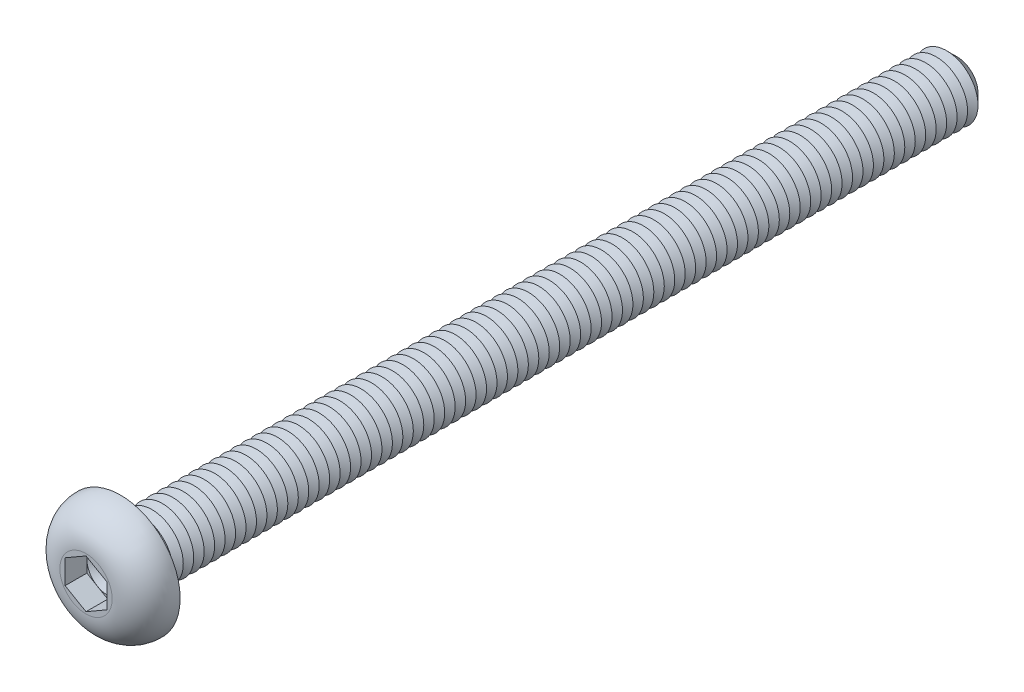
ISO-10303-21;
HEADER;
FILE_DESCRIPTION(('STEP AP214'),'2;1');
FILE_NAME('part.step','',(''),(''),'','','');
FILE_SCHEMA(('AUTOMOTIVE_DESIGN { 1 0 10303 214 1 1 1 1 }'));
ENDSEC;
DATA;
#1=APPLICATION_CONTEXT('core data for automotive mechanical design processes');
#2=APPLICATION_PROTOCOL_DEFINITION('international standard','automotive_design',2000,#1);
#3=PRODUCT_CONTEXT('',#1,'mechanical');
#4=PRODUCT('Part','Part','',(#3));
#5=PRODUCT_RELATED_PRODUCT_CATEGORY('part','',(#4));
#6=PRODUCT_DEFINITION_FORMATION('','',#4);
#7=PRODUCT_DEFINITION_CONTEXT('part definition',#1,'design');
#8=PRODUCT_DEFINITION('design','',#6,#7);
#9=PRODUCT_DEFINITION_SHAPE('','',#8);
#10=(LENGTH_UNIT() NAMED_UNIT(*) SI_UNIT(.MILLI.,.METRE.));
#11=(NAMED_UNIT(*) PLANE_ANGLE_UNIT() SI_UNIT($,.RADIAN.));
#12=(NAMED_UNIT(*) SI_UNIT($,.STERADIAN.) SOLID_ANGLE_UNIT());
#13=UNCERTAINTY_MEASURE_WITH_UNIT(LENGTH_MEASURE(1.E-05),#10,'distance_accuracy_value','');
#14=(GEOMETRIC_REPRESENTATION_CONTEXT(3) GLOBAL_UNCERTAINTY_ASSIGNED_CONTEXT((#13)) GLOBAL_UNIT_ASSIGNED_CONTEXT((#10,
#11,#12)) REPRESENTATION_CONTEXT('',''));
#15=CARTESIAN_POINT('',(0.,0.,0.));
#16=DIRECTION('',(0.,0.,1.));
#17=DIRECTION('',(1.,0.,0.));
#18=AXIS2_PLACEMENT_3D('',#15,#16,#17);
#19=CARTESIAN_POINT('',(0.,0.,0.61));
#20=DIRECTION('',(0.,0.,1.));
#21=DIRECTION('',(1.,0.,0.));
#22=AXIS2_PLACEMENT_3D('',#19,#20,#21);
#23=PLANE('',#22);
#24=CARTESIAN_POINT('',(0.,0.,0.61));
#25=DIRECTION('',(0.,0.,1.));
#26=DIRECTION('',(1.,0.,0.));
#27=AXIS2_PLACEMENT_3D('',#24,#25,#26);
#28=CIRCLE('',#27,1.);
#29=CARTESIAN_POINT('',(1.,0.,0.61));
#30=VERTEX_POINT('',#29);
#31=CARTESIAN_POINT('',(0.5,0.866025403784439,0.61));
#32=VERTEX_POINT('',#31);
#33=EDGE_CURVE('E117',#30,#32,#28,.T.);
#34=ORIENTED_EDGE('',*,*,#33,.F.);
#35=DIRECTION('',(0.,1.,0.));
#36=VECTOR('',#35,1.);
#37=CARTESIAN_POINT('',(1.,-0.577350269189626,0.61));
#38=LINE('',#37,#36);
#39=CARTESIAN_POINT('',(1.,0.577350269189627,0.61));
#40=VERTEX_POINT('',#39);
#41=EDGE_CURVE('E140',#30,#40,#38,.T.);
#42=ORIENTED_EDGE('',*,*,#41,.T.);
#43=DIRECTION('',(-0.866025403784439,0.5,0.));
#44=VECTOR('',#43,1.);
#45=CARTESIAN_POINT('',(1.,0.577350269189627,0.61));
#46=LINE('',#45,#44);
#47=EDGE_CURVE('E135',#40,#32,#46,.T.);
#48=ORIENTED_EDGE('',*,*,#47,.T.);
#49=EDGE_LOOP('',(#34,#42,#48));
#50=FACE_BOUND('',#49,.T.);
#51=ADVANCED_FACE('F39',(#50),#23,.T.);
#52=CARTESIAN_POINT('',(0.,0.,0.61));
#53=DIRECTION('',(0.,0.,1.));
#54=DIRECTION('',(1.,0.,0.));
#55=AXIS2_PLACEMENT_3D('',#52,#53,#54);
#56=CIRCLE('',#55,1.);
#57=CARTESIAN_POINT('',(-0.5,0.866025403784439,0.61));
#58=VERTEX_POINT('',#57);
#59=EDGE_CURVE('E11',#32,#58,#56,.T.);
#60=ORIENTED_EDGE('',*,*,#59,.F.);
#61=CARTESIAN_POINT('',(0.,1.15470053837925,0.61));
#62=VERTEX_POINT('',#61);
#63=EDGE_CURVE('E130',#32,#62,#46,.T.);
#64=ORIENTED_EDGE('',*,*,#63,.T.);
#65=DIRECTION('',(-0.866025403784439,-0.5,0.));
#66=VECTOR('',#65,1.);
#67=CARTESIAN_POINT('',(0.,1.15470053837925,0.61));
#68=LINE('',#67,#66);
#69=EDGE_CURVE('E132',#62,#58,#68,.T.);
#70=ORIENTED_EDGE('',*,*,#69,.T.);
#71=EDGE_LOOP('',(#60,#64,#70));
#72=FACE_BOUND('',#71,.T.);
#73=ADVANCED_FACE('F129',(#72),#23,.T.);
#74=CARTESIAN_POINT('',(-1.,0.,0.61));
#75=VERTEX_POINT('',#74);
#76=EDGE_CURVE('E49',#58,#75,#56,.T.);
#77=ORIENTED_EDGE('',*,*,#76,.F.);
#78=CARTESIAN_POINT('',(-1.,0.577350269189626,0.61));
#79=VERTEX_POINT('',#78);
#80=EDGE_CURVE('E143',#58,#79,#68,.T.);
#81=ORIENTED_EDGE('',*,*,#80,.T.);
#82=DIRECTION('',(0.,-1.,0.));
#83=VECTOR('',#82,1.);
#84=CARTESIAN_POINT('',(-1.,0.577350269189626,0.61));
#85=LINE('',#84,#83);
#86=EDGE_CURVE('E154',#79,#75,#85,.T.);
#87=ORIENTED_EDGE('',*,*,#86,.T.);
#88=EDGE_LOOP('',(#77,#81,#87));
#89=FACE_BOUND('',#88,.T.);
#90=ADVANCED_FACE('F253',(#89),#23,.T.);
#91=CARTESIAN_POINT('',(-0.5,-0.866025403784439,0.61));
#92=VERTEX_POINT('',#91);
#93=EDGE_CURVE('E234',#75,#92,#56,.T.);
#94=ORIENTED_EDGE('',*,*,#93,.F.);
#95=CARTESIAN_POINT('',(-1.,-0.577350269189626,0.61));
#96=VERTEX_POINT('',#95);
#97=EDGE_CURVE('E153',#75,#96,#85,.T.);
#98=ORIENTED_EDGE('',*,*,#97,.T.);
#99=DIRECTION('',(0.866025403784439,-0.5,0.));
#100=VECTOR('',#99,1.);
#101=CARTESIAN_POINT('',(-1.,-0.577350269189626,0.61));
#102=LINE('',#101,#100);
#103=EDGE_CURVE('E159',#96,#92,#102,.T.);
#104=ORIENTED_EDGE('',*,*,#103,.T.);
#105=EDGE_LOOP('',(#94,#98,#104));
#106=FACE_BOUND('',#105,.T.);
#107=ADVANCED_FACE('F246',(#106),#23,.T.);
#108=CARTESIAN_POINT('',(0.5,-0.866025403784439,0.61));
#109=VERTEX_POINT('',#108);
#110=EDGE_CURVE('E56',#92,#109,#56,.T.);
#111=ORIENTED_EDGE('',*,*,#110,.F.);
#112=CARTESIAN_POINT('',(0.,-1.15470053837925,0.61));
#113=VERTEX_POINT('',#112);
#114=EDGE_CURVE('E158',#92,#113,#102,.T.);
#115=ORIENTED_EDGE('',*,*,#114,.T.);
#116=DIRECTION('',(0.866025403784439,0.5,0.));
#117=VECTOR('',#116,1.);
#118=CARTESIAN_POINT('',(0.,-1.15470053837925,0.61));
#119=LINE('',#118,#117);
#120=EDGE_CURVE('E164',#113,#109,#119,.T.);
#121=ORIENTED_EDGE('',*,*,#120,.T.);
#122=EDGE_LOOP('',(#111,#115,#121));
#123=FACE_BOUND('',#122,.T.);
#124=ADVANCED_FACE('F901',(#123),#23,.T.);
#125=CARTESIAN_POINT('',(0.,0.,-40.));
#126=DIRECTION('',(0.,0.,1.));
#127=DIRECTION('',(1.,0.,0.));
#128=AXIS2_PLACEMENT_3D('',#125,#126,#127);
#129=CYLINDRICAL_SURFACE('',#128,1.5);
#130=CARTESIAN_POINT('',(0.,0.,-0.199999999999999));
#131=DIRECTION('',(0.,0.,1.));
#132=DIRECTION('',(1.,0.,0.));
#133=AXIS2_PLACEMENT_3D('',#130,#131,#132);
#134=CIRCLE('',#133,1.5);
#135=CARTESIAN_POINT('',(1.5,0.,-0.199999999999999));
#136=VERTEX_POINT('',#135);
#137=EDGE_CURVE('E221',#136,#136,#134,.F.);
#138=ORIENTED_EDGE('',*,*,#137,.T.);
#139=EDGE_LOOP('',(#138));
#140=FACE_BOUND('',#139,.T.);
#141=CARTESIAN_POINT('',(0.,0.,-0.5));
#142=DIRECTION('',(0.,0.,1.));
#143=DIRECTION('',(1.,0.,0.));
#144=AXIS2_PLACEMENT_3D('',#141,#142,#143);
#145=CIRCLE('',#144,1.50000000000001);
#146=CARTESIAN_POINT('',(1.50000000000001,0.,-0.5));
#147=VERTEX_POINT('',#146);
#148=EDGE_CURVE('E149',#147,#147,#145,.T.);
#149=ORIENTED_EDGE('',*,*,#148,.T.);
#150=EDGE_LOOP('',(#149));
#151=FACE_BOUND('',#150,.T.);
#152=ADVANCED_FACE('F885',(#140,#151),#129,.T.);
#153=CARTESIAN_POINT('',(0.,2.85,0.));
#154=DIRECTION('',(0.,0.,1.));
#155=DIRECTION('',(1.,0.,0.));
#156=AXIS2_PLACEMENT_3D('',#153,#154,#155);
#157=PLANE('',#156);
#158=CARTESIAN_POINT('',(0.,0.,0.));
#159=DIRECTION('',(0.,0.,1.));
#160=DIRECTION('',(1.,0.,0.));
#161=AXIS2_PLACEMENT_3D('',#158,#159,#160);
#162=CIRCLE('',#161,1.7);
#163=CARTESIAN_POINT('',(1.7,0.,0.));
#164=VERTEX_POINT('',#163);
#165=EDGE_CURVE('E224',#164,#164,#162,.T.);
#166=ORIENTED_EDGE('',*,*,#165,.T.);
#167=EDGE_LOOP('',(#166));
#168=FACE_BOUND('',#167,.T.);
#169=CARTESIAN_POINT('',(0.,0.,0.));
#170=DIRECTION('',(0.,0.,1.));
#171=DIRECTION('',(1.,0.,0.));
#172=AXIS2_PLACEMENT_3D('',#169,#170,#171);
#173=CIRCLE('',#172,2.85);
#174=CARTESIAN_POINT('',(2.85,0.,0.));
#175=VERTEX_POINT('',#174);
#176=EDGE_CURVE('E196',#175,#175,#173,.T.);
#177=ORIENTED_EDGE('',*,*,#176,.F.);
#178=EDGE_LOOP('',(#177));
#179=FACE_BOUND('',#178,.T.);
#180=ADVANCED_FACE('F931',(#168,#179),#157,.F.);
#181=CARTESIAN_POINT('',(0.,0.,1.65));
#182=DIRECTION('',(0.,0.,-1.));
#183=DIRECTION('',(-1.,0.,0.));
#184=AXIS2_PLACEMENT_3D('',#181,#182,#183);
#185=PLANE('',#184);
#186=DIRECTION('',(-0.866025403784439,-0.5,0.));
#187=VECTOR('',#186,1.);
#188=CARTESIAN_POINT('',(0.,1.15470053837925,1.65));
#189=LINE('',#188,#187);
#190=CARTESIAN_POINT('',(0.,1.15470053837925,1.65));
#191=VERTEX_POINT('',#190);
#192=CARTESIAN_POINT('',(-1.,0.577350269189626,1.65));
#193=VERTEX_POINT('',#192);
#194=EDGE_CURVE('E174',#191,#193,#189,.T.);
#195=ORIENTED_EDGE('',*,*,#194,.F.);
#196=DIRECTION('',(-0.866025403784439,0.5,0.));
#197=VECTOR('',#196,1.);
#198=CARTESIAN_POINT('',(1.,0.577350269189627,1.65));
#199=LINE('',#198,#197);
#200=CARTESIAN_POINT('',(1.,0.577350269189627,1.65));
#201=VERTEX_POINT('',#200);
#202=EDGE_CURVE('E64',#201,#191,#199,.T.);
#203=ORIENTED_EDGE('',*,*,#202,.F.);
#204=DIRECTION('',(0.,1.,0.));
#205=VECTOR('',#204,1.);
#206=CARTESIAN_POINT('',(1.,-0.577350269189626,1.65));
#207=LINE('',#206,#205);
#208=CARTESIAN_POINT('',(1.,-0.577350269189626,1.65));
#209=VERTEX_POINT('',#208);
#210=EDGE_CURVE('E138',#209,#201,#207,.T.);
#211=ORIENTED_EDGE('',*,*,#210,.F.);
#212=DIRECTION('',(0.866025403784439,0.5,0.));
#213=VECTOR('',#212,1.);
#214=CARTESIAN_POINT('',(0.,-1.15470053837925,1.65));
#215=LINE('',#214,#213);
#216=CARTESIAN_POINT('',(0.,-1.15470053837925,1.65));
#217=VERTEX_POINT('',#216);
#218=EDGE_CURVE('E186',#217,#209,#215,.T.);
#219=ORIENTED_EDGE('',*,*,#218,.F.);
#220=DIRECTION('',(0.866025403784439,-0.5,0.));
#221=VECTOR('',#220,1.);
#222=CARTESIAN_POINT('',(-1.,-0.577350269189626,1.65));
#223=LINE('',#222,#221);
#224=CARTESIAN_POINT('',(-1.,-0.577350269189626,1.65));
#225=VERTEX_POINT('',#224);
#226=EDGE_CURVE('E182',#225,#217,#223,.T.);
#227=ORIENTED_EDGE('',*,*,#226,.F.);
#228=DIRECTION('',(0.,-1.,0.));
#229=VECTOR('',#228,1.);
#230=CARTESIAN_POINT('',(-1.,0.577350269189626,1.65));
#231=LINE('',#230,#229);
#232=EDGE_CURVE('E178',#193,#225,#231,.T.);
#233=ORIENTED_EDGE('',*,*,#232,.F.);
#234=EDGE_LOOP('',(#195,#203,#211,#219,#227,#233));
#235=FACE_BOUND('',#234,.T.);
#236=CARTESIAN_POINT('',(0.,0.,1.65));
#237=DIRECTION('',(0.,0.,1.));
#238=DIRECTION('',(1.,0.,0.));
#239=AXIS2_PLACEMENT_3D('',#236,#237,#238);
#240=CIRCLE('',#239,1.25078144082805);
#241=CARTESIAN_POINT('',(1.25078144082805,0.,1.65));
#242=VERTEX_POINT('',#241);
#243=EDGE_CURVE('E214',#242,#242,#240,.T.);
#244=ORIENTED_EDGE('',*,*,#243,.T.);
#245=EDGE_LOOP('',(#244));
#246=FACE_BOUND('',#245,.T.);
#247=ADVANCED_FACE('F262',(#235,#246),#185,.F.);
#248=CARTESIAN_POINT('',(0.,0.,0.0499999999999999));
#249=DIRECTION('',(0.,0.,1.));
#250=DIRECTION('',(1.,0.,0.));
#251=AXIS2_PLACEMENT_3D('',#248,#249,#250);
#252=DEGENERATE_TOROIDAL_SURFACE('',#251,1.25078144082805,1.6,.T.);
#253=ORIENTED_EDGE('',*,*,#243,.F.);
#254=EDGE_LOOP('',(#253));
#255=FACE_BOUND('',#254,.T.);
#256=ORIENTED_EDGE('',*,*,#176,.T.);
#257=EDGE_LOOP('',(#256));
#258=FACE_BOUND('',#257,.T.);
#259=ADVANCED_FACE('F925',(#255,#258),#252,.T.);
#260=CARTESIAN_POINT('',(1.,0.577350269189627,0.61));
#261=DIRECTION('',(0.5,0.866025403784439,0.));
#262=DIRECTION('',(-0.866025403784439,0.5,0.));
#263=AXIS2_PLACEMENT_3D('',#260,#261,#262);
#264=PLANE('',#263);
#265=ORIENTED_EDGE('',*,*,#202,.T.);
#266=DIRECTION('',(0.,0.,1.));
#267=VECTOR('',#266,1.);
#268=CARTESIAN_POINT('',(0.,1.15470053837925,0.61));
#269=LINE('',#268,#267);
#270=EDGE_CURVE('E136',#62,#191,#269,.T.);
#271=ORIENTED_EDGE('',*,*,#270,.F.);
#272=ORIENTED_EDGE('',*,*,#63,.F.);
#273=ORIENTED_EDGE('',*,*,#47,.F.);
#274=DIRECTION('',(0.,0.,1.));
#275=VECTOR('',#274,1.);
#276=CARTESIAN_POINT('',(1.,0.577350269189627,0.61));
#277=LINE('',#276,#275);
#278=EDGE_CURVE('E193',#40,#201,#277,.T.);
#279=ORIENTED_EDGE('',*,*,#278,.T.);
#280=EDGE_LOOP('',(#265,#271,#272,#273,#279));
#281=FACE_BOUND('',#280,.T.);
#282=ADVANCED_FACE('F134',(#281),#264,.F.);
#283=CARTESIAN_POINT('',(1.,-0.577350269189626,0.61));
#284=DIRECTION('',(1.,0.,0.));
#285=DIRECTION('',(0.,0.,-1.));
#286=AXIS2_PLACEMENT_3D('',#283,#284,#285);
#287=PLANE('',#286);
#288=ORIENTED_EDGE('',*,*,#210,.T.);
#289=ORIENTED_EDGE('',*,*,#278,.F.);
#290=ORIENTED_EDGE('',*,*,#41,.F.);
#291=CARTESIAN_POINT('',(1.,-0.577350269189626,0.61));
#292=VERTEX_POINT('',#291);
#293=EDGE_CURVE('E168',#292,#30,#38,.T.);
#294=ORIENTED_EDGE('',*,*,#293,.F.);
#295=DIRECTION('',(0.,0.,1.));
#296=VECTOR('',#295,1.);
#297=CARTESIAN_POINT('',(1.,-0.577350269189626,0.61));
#298=LINE('',#297,#296);
#299=EDGE_CURVE('E197',#292,#209,#298,.T.);
#300=ORIENTED_EDGE('',*,*,#299,.T.);
#301=EDGE_LOOP('',(#288,#289,#290,#294,#300));
#302=FACE_BOUND('',#301,.T.);
#303=ADVANCED_FACE('F909',(#302),#287,.F.);
#304=CARTESIAN_POINT('',(0.,-1.15470053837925,0.61));
#305=DIRECTION('',(0.5,-0.866025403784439,0.));
#306=DIRECTION('',(0.866025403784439,0.5,0.));
#307=AXIS2_PLACEMENT_3D('',#304,#305,#306);
#308=PLANE('',#307);
#309=ORIENTED_EDGE('',*,*,#218,.T.);
#310=ORIENTED_EDGE('',*,*,#299,.F.);
#311=EDGE_CURVE('E163',#109,#292,#119,.T.);
#312=ORIENTED_EDGE('',*,*,#311,.F.);
#313=ORIENTED_EDGE('',*,*,#120,.F.);
#314=DIRECTION('',(0.,0.,1.));
#315=VECTOR('',#314,1.);
#316=CARTESIAN_POINT('',(0.,-1.15470053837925,0.61));
#317=LINE('',#316,#315);
#318=EDGE_CURVE('E200',#113,#217,#317,.T.);
#319=ORIENTED_EDGE('',*,*,#318,.T.);
#320=EDGE_LOOP('',(#309,#310,#312,#313,#319));
#321=FACE_BOUND('',#320,.T.);
#322=ADVANCED_FACE('F912',(#321),#308,.F.);
#323=CARTESIAN_POINT('',(-1.,-0.577350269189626,0.61));
#324=DIRECTION('',(-0.5,-0.866025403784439,0.));
#325=DIRECTION('',(0.866025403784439,-0.5,0.));
#326=AXIS2_PLACEMENT_3D('',#323,#324,#325);
#327=PLANE('',#326);
#328=ORIENTED_EDGE('',*,*,#226,.T.);
#329=ORIENTED_EDGE('',*,*,#318,.F.);
#330=ORIENTED_EDGE('',*,*,#114,.F.);
#331=ORIENTED_EDGE('',*,*,#103,.F.);
#332=DIRECTION('',(0.,0.,1.));
#333=VECTOR('',#332,1.);
#334=CARTESIAN_POINT('',(-1.,-0.577350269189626,0.61));
#335=LINE('',#334,#333);
#336=EDGE_CURVE('E203',#96,#225,#335,.T.);
#337=ORIENTED_EDGE('',*,*,#336,.T.);
#338=EDGE_LOOP('',(#328,#329,#330,#331,#337));
#339=FACE_BOUND('',#338,.T.);
#340=ADVANCED_FACE('F267',(#339),#327,.F.);
#341=CARTESIAN_POINT('',(-1.,0.577350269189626,0.61));
#342=DIRECTION('',(-1.,0.,0.));
#343=DIRECTION('',(0.,-1.,0.));
#344=AXIS2_PLACEMENT_3D('',#341,#342,#343);
#345=PLANE('',#344);
#346=ORIENTED_EDGE('',*,*,#232,.T.);
#347=ORIENTED_EDGE('',*,*,#336,.F.);
#348=ORIENTED_EDGE('',*,*,#97,.F.);
#349=ORIENTED_EDGE('',*,*,#86,.F.);
#350=DIRECTION('',(0.,0.,1.));
#351=VECTOR('',#350,1.);
#352=CARTESIAN_POINT('',(-1.,0.577350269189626,0.61));
#353=LINE('',#352,#351);
#354=EDGE_CURVE('E206',#79,#193,#353,.T.);
#355=ORIENTED_EDGE('',*,*,#354,.T.);
#356=EDGE_LOOP('',(#346,#347,#348,#349,#355));
#357=FACE_BOUND('',#356,.T.);
#358=ADVANCED_FACE('F251',(#357),#345,.F.);
#359=CARTESIAN_POINT('',(0.,1.15470053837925,0.61));
#360=DIRECTION('',(-0.5,0.866025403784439,0.));
#361=DIRECTION('',(-0.866025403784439,-0.5,0.));
#362=AXIS2_PLACEMENT_3D('',#359,#360,#361);
#363=PLANE('',#362);
#364=ORIENTED_EDGE('',*,*,#194,.T.);
#365=ORIENTED_EDGE('',*,*,#354,.F.);
#366=ORIENTED_EDGE('',*,*,#80,.F.);
#367=ORIENTED_EDGE('',*,*,#69,.F.);
#368=ORIENTED_EDGE('',*,*,#270,.T.);
#369=EDGE_LOOP('',(#364,#365,#366,#367,#368));
#370=FACE_BOUND('',#369,.T.);
#371=ADVANCED_FACE('F256',(#370),#363,.F.);
#372=EDGE_CURVE('E43',#109,#30,#56,.T.);
#373=ORIENTED_EDGE('',*,*,#372,.F.);
#374=ORIENTED_EDGE('',*,*,#311,.T.);
#375=ORIENTED_EDGE('',*,*,#293,.T.);
#376=EDGE_LOOP('',(#373,#374,#375));
#377=FACE_BOUND('',#376,.T.);
#378=ADVANCED_FACE('F890',(#377),#23,.T.);
#379=CARTESIAN_POINT('',(0.,0.,-0.5));
#380=DIRECTION('',(0.,0.,1.));
#381=DIRECTION('',(1.,0.,0.));
#382=AXIS2_PLACEMENT_3D('',#379,#380,#381);
#383=CONICAL_SURFACE('',#382,1.50000000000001,1.0471975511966);
#384=CARTESIAN_POINT('',(0.,0.,-0.750000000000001));
#385=DIRECTION('',(0.,0.,1.));
#386=DIRECTION('',(1.,0.,0.));
#387=AXIS2_PLACEMENT_3D('',#384,#385,#386);
#388=CIRCLE('',#387,1.06698729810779);
#389=CARTESIAN_POINT('',(1.06698729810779,0.,-0.750000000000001));
#390=VERTEX_POINT('',#389);
#391=EDGE_CURVE('E876',#390,#390,#388,.T.);
#392=ORIENTED_EDGE('',*,*,#391,.T.);
#393=EDGE_LOOP('',(#392));
#394=FACE_BOUND('',#393,.T.);
#395=ORIENTED_EDGE('',*,*,#148,.F.);
#396=EDGE_LOOP('',(#395));
#397=FACE_BOUND('',#396,.T.);
#398=ADVANCED_FACE('F887',(#394,#397),#383,.T.);
#399=CARTESIAN_POINT('',(0.,0.,-0.750000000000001));
#400=DIRECTION('',(0.,0.,-1.));
#401=DIRECTION('',(-1.,0.,0.));
#402=AXIS2_PLACEMENT_3D('',#399,#400,#401);
#403=CONICAL_SURFACE('',#402,1.06698729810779,1.0471975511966);
#404=CARTESIAN_POINT('',(0.,0.,-1.));
#405=DIRECTION('',(0.,0.,1.));
#406=DIRECTION('',(1.,0.,0.));
#407=AXIS2_PLACEMENT_3D('',#404,#405,#406);
#408=CIRCLE('',#407,1.50000000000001);
#409=CARTESIAN_POINT('',(1.50000000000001,0.,-1.));
#410=VERTEX_POINT('',#409);
#411=EDGE_CURVE('E873',#410,#410,#408,.T.);
#412=ORIENTED_EDGE('',*,*,#411,.T.);
#413=EDGE_LOOP('',(#412));
#414=FACE_BOUND('',#413,.T.);
#415=ORIENTED_EDGE('',*,*,#391,.F.);
#416=EDGE_LOOP('',(#415));
#417=FACE_BOUND('',#416,.T.);
#418=ADVANCED_FACE('F889',(#414,#417),#403,.T.);
#419=CARTESIAN_POINT('',(0.,0.,-1.));
#420=DIRECTION('',(0.,0.,1.));
#421=DIRECTION('',(1.,0.,0.));
#422=AXIS2_PLACEMENT_3D('',#419,#420,#421);
#423=CONICAL_SURFACE('',#422,1.50000000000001,1.0471975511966);
#424=CARTESIAN_POINT('',(0.,0.,-1.25));
#425=DIRECTION('',(0.,0.,1.));
#426=DIRECTION('',(1.,0.,0.));
#427=AXIS2_PLACEMENT_3D('',#424,#425,#426);
#428=CIRCLE('',#427,1.06698729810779);
#429=CARTESIAN_POINT('',(1.06698729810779,0.,-1.25));
#430=VERTEX_POINT('',#429);
#431=EDGE_CURVE('E276',#430,#430,#428,.T.);
#432=ORIENTED_EDGE('',*,*,#431,.T.);
#433=EDGE_LOOP('',(#432));
#434=FACE_BOUND('',#433,.T.);
#435=ORIENTED_EDGE('',*,*,#411,.F.);
#436=EDGE_LOOP('',(#435));
#437=FACE_BOUND('',#436,.T.);
#438=ADVANCED_FACE('F896',(#434,#437),#423,.T.);
#439=CARTESIAN_POINT('',(0.,0.,-1.25));
#440=DIRECTION('',(0.,0.,-1.));
#441=DIRECTION('',(-1.,0.,0.));
#442=AXIS2_PLACEMENT_3D('',#439,#440,#441);
#443=CONICAL_SURFACE('',#442,1.06698729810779,1.0471975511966);
#444=CARTESIAN_POINT('',(0.,0.,-1.5));
#445=DIRECTION('',(0.,0.,1.));
#446=DIRECTION('',(1.,0.,0.));
#447=AXIS2_PLACEMENT_3D('',#444,#445,#446);
#448=CIRCLE('',#447,1.50000000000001);
#449=CARTESIAN_POINT('',(1.50000000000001,0.,-1.5));
#450=VERTEX_POINT('',#449);
#451=EDGE_CURVE('E273',#450,#450,#448,.T.);
#452=ORIENTED_EDGE('',*,*,#451,.T.);
#453=EDGE_LOOP('',(#452));
#454=FACE_BOUND('',#453,.T.);
#455=ORIENTED_EDGE('',*,*,#431,.F.);
#456=EDGE_LOOP('',(#455));
#457=FACE_BOUND('',#456,.T.);
#458=ADVANCED_FACE('F1568',(#454,#457),#443,.T.);
#459=CARTESIAN_POINT('',(0.,0.,-1.5));
#460=DIRECTION('',(0.,0.,1.));
#461=DIRECTION('',(1.,0.,0.));
#462=AXIS2_PLACEMENT_3D('',#459,#460,#461);
#463=CONICAL_SURFACE('',#462,1.50000000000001,1.0471975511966);
#464=CARTESIAN_POINT('',(0.,0.,-1.75));
#465=DIRECTION('',(0.,0.,1.));
#466=DIRECTION('',(1.,0.,0.));
#467=AXIS2_PLACEMENT_3D('',#464,#465,#466);
#468=CIRCLE('',#467,1.06698729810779);
#469=CARTESIAN_POINT('',(1.06698729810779,0.,-1.75));
#470=VERTEX_POINT('',#469);
#471=EDGE_CURVE('E277',#470,#470,#468,.T.);
#472=ORIENTED_EDGE('',*,*,#471,.T.);
#473=EDGE_LOOP('',(#472));
#474=FACE_BOUND('',#473,.T.);
#475=ORIENTED_EDGE('',*,*,#451,.F.);
#476=EDGE_LOOP('',(#475));
#477=FACE_BOUND('',#476,.T.);
#478=ADVANCED_FACE('F1564',(#474,#477),#463,.T.);
#479=CARTESIAN_POINT('',(0.,0.,-1.75));
#480=DIRECTION('',(0.,0.,-1.));
#481=DIRECTION('',(-1.,0.,0.));
#482=AXIS2_PLACEMENT_3D('',#479,#480,#481);
#483=CONICAL_SURFACE('',#482,1.06698729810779,1.0471975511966);
#484=CARTESIAN_POINT('',(0.,0.,-2.));
#485=DIRECTION('',(0.,0.,1.));
#486=DIRECTION('',(1.,0.,0.));
#487=AXIS2_PLACEMENT_3D('',#484,#485,#486);
#488=CIRCLE('',#487,1.50000000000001);
#489=CARTESIAN_POINT('',(1.50000000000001,0.,-2.));
#490=VERTEX_POINT('',#489);
#491=EDGE_CURVE('E863',#490,#490,#488,.T.);
#492=ORIENTED_EDGE('',*,*,#491,.T.);
#493=EDGE_LOOP('',(#492));
#494=FACE_BOUND('',#493,.T.);
#495=ORIENTED_EDGE('',*,*,#471,.F.);
#496=EDGE_LOOP('',(#495));
#497=FACE_BOUND('',#496,.T.);
#498=ADVANCED_FACE('F1560',(#494,#497),#483,.T.);
#499=CARTESIAN_POINT('',(0.,0.,-2.));
#500=DIRECTION('',(0.,0.,1.));
#501=DIRECTION('',(1.,0.,0.));
#502=AXIS2_PLACEMENT_3D('',#499,#500,#501);
#503=CONICAL_SURFACE('',#502,1.50000000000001,1.0471975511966);
#504=CARTESIAN_POINT('',(0.,0.,-2.25));
#505=DIRECTION('',(0.,0.,1.));
#506=DIRECTION('',(1.,0.,0.));
#507=AXIS2_PLACEMENT_3D('',#504,#505,#506);
#508=CIRCLE('',#507,1.06698729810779);
#509=CARTESIAN_POINT('',(1.06698729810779,0.,-2.25));
#510=VERTEX_POINT('',#509);
#511=EDGE_CURVE('E859',#510,#510,#508,.T.);
#512=ORIENTED_EDGE('',*,*,#511,.T.);
#513=EDGE_LOOP('',(#512));
#514=FACE_BOUND('',#513,.T.);
#515=ORIENTED_EDGE('',*,*,#491,.F.);
#516=EDGE_LOOP('',(#515));
#517=FACE_BOUND('',#516,.T.);
#518=ADVANCED_FACE('F1556',(#514,#517),#503,.T.);
#519=CARTESIAN_POINT('',(0.,0.,-2.25));
#520=DIRECTION('',(0.,0.,-1.));
#521=DIRECTION('',(-1.,0.,0.));
#522=AXIS2_PLACEMENT_3D('',#519,#520,#521);
#523=CONICAL_SURFACE('',#522,1.06698729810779,1.0471975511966);
#524=CARTESIAN_POINT('',(0.,0.,-2.5));
#525=DIRECTION('',(0.,0.,1.));
#526=DIRECTION('',(1.,0.,0.));
#527=AXIS2_PLACEMENT_3D('',#524,#525,#526);
#528=CIRCLE('',#527,1.50000000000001);
#529=CARTESIAN_POINT('',(1.50000000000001,0.,-2.5));
#530=VERTEX_POINT('',#529);
#531=EDGE_CURVE('E855',#530,#530,#528,.T.);
#532=ORIENTED_EDGE('',*,*,#531,.T.);
#533=EDGE_LOOP('',(#532));
#534=FACE_BOUND('',#533,.T.);
#535=ORIENTED_EDGE('',*,*,#511,.F.);
#536=EDGE_LOOP('',(#535));
#537=FACE_BOUND('',#536,.T.);
#538=ADVANCED_FACE('F1552',(#534,#537),#523,.T.);
#539=CARTESIAN_POINT('',(0.,0.,-2.5));
#540=DIRECTION('',(0.,0.,1.));
#541=DIRECTION('',(1.,0.,0.));
#542=AXIS2_PLACEMENT_3D('',#539,#540,#541);
#543=CONICAL_SURFACE('',#542,1.50000000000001,1.0471975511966);
#544=CARTESIAN_POINT('',(0.,0.,-2.75));
#545=DIRECTION('',(0.,0.,1.));
#546=DIRECTION('',(1.,0.,0.));
#547=AXIS2_PLACEMENT_3D('',#544,#545,#546);
#548=CIRCLE('',#547,1.06698729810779);
#549=CARTESIAN_POINT('',(1.06698729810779,0.,-2.75));
#550=VERTEX_POINT('',#549);
#551=EDGE_CURVE('E851',#550,#550,#548,.T.);
#552=ORIENTED_EDGE('',*,*,#551,.T.);
#553=EDGE_LOOP('',(#552));
#554=FACE_BOUND('',#553,.T.);
#555=ORIENTED_EDGE('',*,*,#531,.F.);
#556=EDGE_LOOP('',(#555));
#557=FACE_BOUND('',#556,.T.);
#558=ADVANCED_FACE('F1548',(#554,#557),#543,.T.);
#559=CARTESIAN_POINT('',(0.,0.,-2.75));
#560=DIRECTION('',(0.,0.,-1.));
#561=DIRECTION('',(-1.,0.,0.));
#562=AXIS2_PLACEMENT_3D('',#559,#560,#561);
#563=CONICAL_SURFACE('',#562,1.06698729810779,1.0471975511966);
#564=CARTESIAN_POINT('',(0.,0.,-3.));
#565=DIRECTION('',(0.,0.,1.));
#566=DIRECTION('',(1.,0.,0.));
#567=AXIS2_PLACEMENT_3D('',#564,#565,#566);
#568=CIRCLE('',#567,1.50000000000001);
#569=CARTESIAN_POINT('',(1.50000000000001,0.,-3.));
#570=VERTEX_POINT('',#569);
#571=EDGE_CURVE('E847',#570,#570,#568,.T.);
#572=ORIENTED_EDGE('',*,*,#571,.T.);
#573=EDGE_LOOP('',(#572));
#574=FACE_BOUND('',#573,.T.);
#575=ORIENTED_EDGE('',*,*,#551,.F.);
#576=EDGE_LOOP('',(#575));
#577=FACE_BOUND('',#576,.T.);
#578=ADVANCED_FACE('F1544',(#574,#577),#563,.T.);
#579=CARTESIAN_POINT('',(0.,0.,-3.));
#580=DIRECTION('',(0.,0.,1.));
#581=DIRECTION('',(1.,0.,0.));
#582=AXIS2_PLACEMENT_3D('',#579,#580,#581);
#583=CONICAL_SURFACE('',#582,1.50000000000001,1.0471975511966);
#584=CARTESIAN_POINT('',(0.,0.,-3.25));
#585=DIRECTION('',(0.,0.,1.));
#586=DIRECTION('',(1.,0.,0.));
#587=AXIS2_PLACEMENT_3D('',#584,#585,#586);
#588=CIRCLE('',#587,1.06698729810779);
#589=CARTESIAN_POINT('',(1.06698729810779,0.,-3.25));
#590=VERTEX_POINT('',#589);
#591=EDGE_CURVE('E843',#590,#590,#588,.T.);
#592=ORIENTED_EDGE('',*,*,#591,.T.);
#593=EDGE_LOOP('',(#592));
#594=FACE_BOUND('',#593,.T.);
#595=ORIENTED_EDGE('',*,*,#571,.F.);
#596=EDGE_LOOP('',(#595));
#597=FACE_BOUND('',#596,.T.);
#598=ADVANCED_FACE('F1540',(#594,#597),#583,.T.);
#599=CARTESIAN_POINT('',(0.,0.,-3.25));
#600=DIRECTION('',(0.,0.,-1.));
#601=DIRECTION('',(-1.,0.,0.));
#602=AXIS2_PLACEMENT_3D('',#599,#600,#601);
#603=CONICAL_SURFACE('',#602,1.06698729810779,1.0471975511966);
#604=CARTESIAN_POINT('',(0.,0.,-3.5));
#605=DIRECTION('',(0.,0.,1.));
#606=DIRECTION('',(1.,0.,0.));
#607=AXIS2_PLACEMENT_3D('',#604,#605,#606);
#608=CIRCLE('',#607,1.50000000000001);
#609=CARTESIAN_POINT('',(1.50000000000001,0.,-3.5));
#610=VERTEX_POINT('',#609);
#611=EDGE_CURVE('E839',#610,#610,#608,.T.);
#612=ORIENTED_EDGE('',*,*,#611,.T.);
#613=EDGE_LOOP('',(#612));
#614=FACE_BOUND('',#613,.T.);
#615=ORIENTED_EDGE('',*,*,#591,.F.);
#616=EDGE_LOOP('',(#615));
#617=FACE_BOUND('',#616,.T.);
#618=ADVANCED_FACE('F1536',(#614,#617),#603,.T.);
#619=CARTESIAN_POINT('',(0.,0.,-3.5));
#620=DIRECTION('',(0.,0.,1.));
#621=DIRECTION('',(1.,0.,0.));
#622=AXIS2_PLACEMENT_3D('',#619,#620,#621);
#623=CONICAL_SURFACE('',#622,1.50000000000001,1.0471975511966);
#624=CARTESIAN_POINT('',(0.,0.,-3.75));
#625=DIRECTION('',(0.,0.,1.));
#626=DIRECTION('',(1.,0.,0.));
#627=AXIS2_PLACEMENT_3D('',#624,#625,#626);
#628=CIRCLE('',#627,1.06698729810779);
#629=CARTESIAN_POINT('',(1.06698729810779,0.,-3.75));
#630=VERTEX_POINT('',#629);
#631=EDGE_CURVE('E835',#630,#630,#628,.T.);
#632=ORIENTED_EDGE('',*,*,#631,.T.);
#633=EDGE_LOOP('',(#632));
#634=FACE_BOUND('',#633,.T.);
#635=ORIENTED_EDGE('',*,*,#611,.F.);
#636=EDGE_LOOP('',(#635));
#637=FACE_BOUND('',#636,.T.);
#638=ADVANCED_FACE('F1532',(#634,#637),#623,.T.);
#639=CARTESIAN_POINT('',(0.,0.,-3.75));
#640=DIRECTION('',(0.,0.,-1.));
#641=DIRECTION('',(-1.,0.,0.));
#642=AXIS2_PLACEMENT_3D('',#639,#640,#641);
#643=CONICAL_SURFACE('',#642,1.06698729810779,1.0471975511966);
#644=CARTESIAN_POINT('',(0.,0.,-4.));
#645=DIRECTION('',(0.,0.,1.));
#646=DIRECTION('',(1.,0.,0.));
#647=AXIS2_PLACEMENT_3D('',#644,#645,#646);
#648=CIRCLE('',#647,1.50000000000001);
#649=CARTESIAN_POINT('',(1.50000000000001,0.,-4.));
#650=VERTEX_POINT('',#649);
#651=EDGE_CURVE('E831',#650,#650,#648,.T.);
#652=ORIENTED_EDGE('',*,*,#651,.T.);
#653=EDGE_LOOP('',(#652));
#654=FACE_BOUND('',#653,.T.);
#655=ORIENTED_EDGE('',*,*,#631,.F.);
#656=EDGE_LOOP('',(#655));
#657=FACE_BOUND('',#656,.T.);
#658=ADVANCED_FACE('F1528',(#654,#657),#643,.T.);
#659=CARTESIAN_POINT('',(0.,0.,-4.));
#660=DIRECTION('',(0.,0.,1.));
#661=DIRECTION('',(1.,0.,0.));
#662=AXIS2_PLACEMENT_3D('',#659,#660,#661);
#663=CONICAL_SURFACE('',#662,1.50000000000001,1.0471975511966);
#664=CARTESIAN_POINT('',(0.,0.,-4.25));
#665=DIRECTION('',(0.,0.,1.));
#666=DIRECTION('',(1.,0.,0.));
#667=AXIS2_PLACEMENT_3D('',#664,#665,#666);
#668=CIRCLE('',#667,1.06698729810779);
#669=CARTESIAN_POINT('',(1.06698729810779,0.,-4.25));
#670=VERTEX_POINT('',#669);
#671=EDGE_CURVE('E827',#670,#670,#668,.T.);
#672=ORIENTED_EDGE('',*,*,#671,.T.);
#673=EDGE_LOOP('',(#672));
#674=FACE_BOUND('',#673,.T.);
#675=ORIENTED_EDGE('',*,*,#651,.F.);
#676=EDGE_LOOP('',(#675));
#677=FACE_BOUND('',#676,.T.);
#678=ADVANCED_FACE('F1524',(#674,#677),#663,.T.);
#679=CARTESIAN_POINT('',(0.,0.,-4.25));
#680=DIRECTION('',(0.,0.,-1.));
#681=DIRECTION('',(-1.,0.,0.));
#682=AXIS2_PLACEMENT_3D('',#679,#680,#681);
#683=CONICAL_SURFACE('',#682,1.06698729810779,1.0471975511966);
#684=CARTESIAN_POINT('',(0.,0.,-4.5));
#685=DIRECTION('',(0.,0.,1.));
#686=DIRECTION('',(1.,0.,0.));
#687=AXIS2_PLACEMENT_3D('',#684,#685,#686);
#688=CIRCLE('',#687,1.50000000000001);
#689=CARTESIAN_POINT('',(1.50000000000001,0.,-4.5));
#690=VERTEX_POINT('',#689);
#691=EDGE_CURVE('E823',#690,#690,#688,.T.);
#692=ORIENTED_EDGE('',*,*,#691,.T.);
#693=EDGE_LOOP('',(#692));
#694=FACE_BOUND('',#693,.T.);
#695=ORIENTED_EDGE('',*,*,#671,.F.);
#696=EDGE_LOOP('',(#695));
#697=FACE_BOUND('',#696,.T.);
#698=ADVANCED_FACE('F1520',(#694,#697),#683,.T.);
#699=CARTESIAN_POINT('',(0.,0.,-4.5));
#700=DIRECTION('',(0.,0.,1.));
#701=DIRECTION('',(1.,0.,0.));
#702=AXIS2_PLACEMENT_3D('',#699,#700,#701);
#703=CONICAL_SURFACE('',#702,1.50000000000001,1.0471975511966);
#704=CARTESIAN_POINT('',(0.,0.,-4.75));
#705=DIRECTION('',(0.,0.,1.));
#706=DIRECTION('',(1.,0.,0.));
#707=AXIS2_PLACEMENT_3D('',#704,#705,#706);
#708=CIRCLE('',#707,1.06698729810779);
#709=CARTESIAN_POINT('',(1.06698729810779,0.,-4.75));
#710=VERTEX_POINT('',#709);
#711=EDGE_CURVE('E819',#710,#710,#708,.T.);
#712=ORIENTED_EDGE('',*,*,#711,.T.);
#713=EDGE_LOOP('',(#712));
#714=FACE_BOUND('',#713,.T.);
#715=ORIENTED_EDGE('',*,*,#691,.F.);
#716=EDGE_LOOP('',(#715));
#717=FACE_BOUND('',#716,.T.);
#718=ADVANCED_FACE('F1516',(#714,#717),#703,.T.);
#719=CARTESIAN_POINT('',(0.,0.,-4.75));
#720=DIRECTION('',(0.,0.,-1.));
#721=DIRECTION('',(-1.,0.,0.));
#722=AXIS2_PLACEMENT_3D('',#719,#720,#721);
#723=CONICAL_SURFACE('',#722,1.06698729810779,1.0471975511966);
#724=CARTESIAN_POINT('',(0.,0.,-5.));
#725=DIRECTION('',(0.,0.,1.));
#726=DIRECTION('',(1.,0.,0.));
#727=AXIS2_PLACEMENT_3D('',#724,#725,#726);
#728=CIRCLE('',#727,1.50000000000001);
#729=CARTESIAN_POINT('',(1.50000000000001,0.,-5.));
#730=VERTEX_POINT('',#729);
#731=EDGE_CURVE('E815',#730,#730,#728,.T.);
#732=ORIENTED_EDGE('',*,*,#731,.T.);
#733=EDGE_LOOP('',(#732));
#734=FACE_BOUND('',#733,.T.);
#735=ORIENTED_EDGE('',*,*,#711,.F.);
#736=EDGE_LOOP('',(#735));
#737=FACE_BOUND('',#736,.T.);
#738=ADVANCED_FACE('F1512',(#734,#737),#723,.T.);
#739=CARTESIAN_POINT('',(0.,0.,-5.));
#740=DIRECTION('',(0.,0.,1.));
#741=DIRECTION('',(1.,0.,0.));
#742=AXIS2_PLACEMENT_3D('',#739,#740,#741);
#743=CONICAL_SURFACE('',#742,1.50000000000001,1.0471975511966);
#744=CARTESIAN_POINT('',(0.,0.,-5.25));
#745=DIRECTION('',(0.,0.,1.));
#746=DIRECTION('',(1.,0.,0.));
#747=AXIS2_PLACEMENT_3D('',#744,#745,#746);
#748=CIRCLE('',#747,1.06698729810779);
#749=CARTESIAN_POINT('',(1.06698729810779,0.,-5.25));
#750=VERTEX_POINT('',#749);
#751=EDGE_CURVE('E811',#750,#750,#748,.T.);
#752=ORIENTED_EDGE('',*,*,#751,.T.);
#753=EDGE_LOOP('',(#752));
#754=FACE_BOUND('',#753,.T.);
#755=ORIENTED_EDGE('',*,*,#731,.F.);
#756=EDGE_LOOP('',(#755));
#757=FACE_BOUND('',#756,.T.);
#758=ADVANCED_FACE('F1508',(#754,#757),#743,.T.);
#759=CARTESIAN_POINT('',(0.,0.,-5.25));
#760=DIRECTION('',(0.,0.,-1.));
#761=DIRECTION('',(-1.,0.,0.));
#762=AXIS2_PLACEMENT_3D('',#759,#760,#761);
#763=CONICAL_SURFACE('',#762,1.06698729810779,1.0471975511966);
#764=CARTESIAN_POINT('',(0.,0.,-5.5));
#765=DIRECTION('',(0.,0.,1.));
#766=DIRECTION('',(1.,0.,0.));
#767=AXIS2_PLACEMENT_3D('',#764,#765,#766);
#768=CIRCLE('',#767,1.50000000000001);
#769=CARTESIAN_POINT('',(1.50000000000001,0.,-5.5));
#770=VERTEX_POINT('',#769);
#771=EDGE_CURVE('E807',#770,#770,#768,.T.);
#772=ORIENTED_EDGE('',*,*,#771,.T.);
#773=EDGE_LOOP('',(#772));
#774=FACE_BOUND('',#773,.T.);
#775=ORIENTED_EDGE('',*,*,#751,.F.);
#776=EDGE_LOOP('',(#775));
#777=FACE_BOUND('',#776,.T.);
#778=ADVANCED_FACE('F1504',(#774,#777),#763,.T.);
#779=CARTESIAN_POINT('',(0.,0.,-5.5));
#780=DIRECTION('',(0.,0.,1.));
#781=DIRECTION('',(1.,0.,0.));
#782=AXIS2_PLACEMENT_3D('',#779,#780,#781);
#783=CONICAL_SURFACE('',#782,1.50000000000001,1.0471975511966);
#784=CARTESIAN_POINT('',(0.,0.,-5.75));
#785=DIRECTION('',(0.,0.,1.));
#786=DIRECTION('',(1.,0.,0.));
#787=AXIS2_PLACEMENT_3D('',#784,#785,#786);
#788=CIRCLE('',#787,1.06698729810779);
#789=CARTESIAN_POINT('',(1.06698729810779,0.,-5.75));
#790=VERTEX_POINT('',#789);
#791=EDGE_CURVE('E282',#790,#790,#788,.T.);
#792=ORIENTED_EDGE('',*,*,#791,.T.);
#793=EDGE_LOOP('',(#792));
#794=FACE_BOUND('',#793,.T.);
#795=ORIENTED_EDGE('',*,*,#771,.F.);
#796=EDGE_LOOP('',(#795));
#797=FACE_BOUND('',#796,.T.);
#798=ADVANCED_FACE('F1500',(#794,#797),#783,.T.);
#799=CARTESIAN_POINT('',(0.,0.,-5.75));
#800=DIRECTION('',(0.,0.,-1.));
#801=DIRECTION('',(-1.,0.,0.));
#802=AXIS2_PLACEMENT_3D('',#799,#800,#801);
#803=CONICAL_SURFACE('',#802,1.06698729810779,1.0471975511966);
#804=CARTESIAN_POINT('',(0.,0.,-6.));
#805=DIRECTION('',(0.,0.,1.));
#806=DIRECTION('',(1.,0.,0.));
#807=AXIS2_PLACEMENT_3D('',#804,#805,#806);
#808=CIRCLE('',#807,1.50000000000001);
#809=CARTESIAN_POINT('',(1.50000000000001,0.,-6.));
#810=VERTEX_POINT('',#809);
#811=EDGE_CURVE('E279',#810,#810,#808,.T.);
#812=ORIENTED_EDGE('',*,*,#811,.T.);
#813=EDGE_LOOP('',(#812));
#814=FACE_BOUND('',#813,.T.);
#815=ORIENTED_EDGE('',*,*,#791,.F.);
#816=EDGE_LOOP('',(#815));
#817=FACE_BOUND('',#816,.T.);
#818=ADVANCED_FACE('F1496',(#814,#817),#803,.T.);
#819=CARTESIAN_POINT('',(0.,0.,-6.));
#820=DIRECTION('',(0.,0.,1.));
#821=DIRECTION('',(1.,0.,0.));
#822=AXIS2_PLACEMENT_3D('',#819,#820,#821);
#823=CONICAL_SURFACE('',#822,1.50000000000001,1.0471975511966);
#824=CARTESIAN_POINT('',(0.,0.,-6.25));
#825=DIRECTION('',(0.,0.,1.));
#826=DIRECTION('',(1.,0.,0.));
#827=AXIS2_PLACEMENT_3D('',#824,#825,#826);
#828=CIRCLE('',#827,1.06698729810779);
#829=CARTESIAN_POINT('',(1.06698729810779,0.,-6.25));
#830=VERTEX_POINT('',#829);
#831=EDGE_CURVE('E283',#830,#830,#828,.T.);
#832=ORIENTED_EDGE('',*,*,#831,.T.);
#833=EDGE_LOOP('',(#832));
#834=FACE_BOUND('',#833,.T.);
#835=ORIENTED_EDGE('',*,*,#811,.F.);
#836=EDGE_LOOP('',(#835));
#837=FACE_BOUND('',#836,.T.);
#838=ADVANCED_FACE('F1492',(#834,#837),#823,.T.);
#839=CARTESIAN_POINT('',(0.,0.,-6.25));
#840=DIRECTION('',(0.,0.,-1.));
#841=DIRECTION('',(-1.,0.,0.));
#842=AXIS2_PLACEMENT_3D('',#839,#840,#841);
#843=CONICAL_SURFACE('',#842,1.06698729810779,1.0471975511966);
#844=CARTESIAN_POINT('',(0.,0.,-6.5));
#845=DIRECTION('',(0.,0.,1.));
#846=DIRECTION('',(1.,0.,0.));
#847=AXIS2_PLACEMENT_3D('',#844,#845,#846);
#848=CIRCLE('',#847,1.50000000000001);
#849=CARTESIAN_POINT('',(1.50000000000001,0.,-6.5));
#850=VERTEX_POINT('',#849);
#851=EDGE_CURVE('E797',#850,#850,#848,.T.);
#852=ORIENTED_EDGE('',*,*,#851,.T.);
#853=EDGE_LOOP('',(#852));
#854=FACE_BOUND('',#853,.T.);
#855=ORIENTED_EDGE('',*,*,#831,.F.);
#856=EDGE_LOOP('',(#855));
#857=FACE_BOUND('',#856,.T.);
#858=ADVANCED_FACE('F1488',(#854,#857),#843,.T.);
#859=CARTESIAN_POINT('',(0.,0.,-6.5));
#860=DIRECTION('',(0.,0.,1.));
#861=DIRECTION('',(1.,0.,0.));
#862=AXIS2_PLACEMENT_3D('',#859,#860,#861);
#863=CONICAL_SURFACE('',#862,1.50000000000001,1.0471975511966);
#864=CARTESIAN_POINT('',(0.,0.,-6.75));
#865=DIRECTION('',(0.,0.,1.));
#866=DIRECTION('',(1.,0.,0.));
#867=AXIS2_PLACEMENT_3D('',#864,#865,#866);
#868=CIRCLE('',#867,1.06698729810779);
#869=CARTESIAN_POINT('',(1.06698729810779,0.,-6.75));
#870=VERTEX_POINT('',#869);
#871=EDGE_CURVE('E793',#870,#870,#868,.T.);
#872=ORIENTED_EDGE('',*,*,#871,.T.);
#873=EDGE_LOOP('',(#872));
#874=FACE_BOUND('',#873,.T.);
#875=ORIENTED_EDGE('',*,*,#851,.F.);
#876=EDGE_LOOP('',(#875));
#877=FACE_BOUND('',#876,.T.);
#878=ADVANCED_FACE('F1484',(#874,#877),#863,.T.);
#879=CARTESIAN_POINT('',(0.,0.,-6.75));
#880=DIRECTION('',(0.,0.,-1.));
#881=DIRECTION('',(-1.,0.,0.));
#882=AXIS2_PLACEMENT_3D('',#879,#880,#881);
#883=CONICAL_SURFACE('',#882,1.06698729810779,1.0471975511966);
#884=CARTESIAN_POINT('',(0.,0.,-7.));
#885=DIRECTION('',(0.,0.,1.));
#886=DIRECTION('',(1.,0.,0.));
#887=AXIS2_PLACEMENT_3D('',#884,#885,#886);
#888=CIRCLE('',#887,1.50000000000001);
#889=CARTESIAN_POINT('',(1.50000000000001,0.,-7.));
#890=VERTEX_POINT('',#889);
#891=EDGE_CURVE('E789',#890,#890,#888,.T.);
#892=ORIENTED_EDGE('',*,*,#891,.T.);
#893=EDGE_LOOP('',(#892));
#894=FACE_BOUND('',#893,.T.);
#895=ORIENTED_EDGE('',*,*,#871,.F.);
#896=EDGE_LOOP('',(#895));
#897=FACE_BOUND('',#896,.T.);
#898=ADVANCED_FACE('F1480',(#894,#897),#883,.T.);
#899=CARTESIAN_POINT('',(0.,0.,-7.));
#900=DIRECTION('',(0.,0.,1.));
#901=DIRECTION('',(1.,0.,0.));
#902=AXIS2_PLACEMENT_3D('',#899,#900,#901);
#903=CONICAL_SURFACE('',#902,1.50000000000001,1.0471975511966);
#904=CARTESIAN_POINT('',(0.,0.,-7.25));
#905=DIRECTION('',(0.,0.,1.));
#906=DIRECTION('',(1.,0.,0.));
#907=AXIS2_PLACEMENT_3D('',#904,#905,#906);
#908=CIRCLE('',#907,1.06698729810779);
#909=CARTESIAN_POINT('',(1.06698729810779,0.,-7.25));
#910=VERTEX_POINT('',#909);
#911=EDGE_CURVE('E785',#910,#910,#908,.T.);
#912=ORIENTED_EDGE('',*,*,#911,.T.);
#913=EDGE_LOOP('',(#912));
#914=FACE_BOUND('',#913,.T.);
#915=ORIENTED_EDGE('',*,*,#891,.F.);
#916=EDGE_LOOP('',(#915));
#917=FACE_BOUND('',#916,.T.);
#918=ADVANCED_FACE('F1476',(#914,#917),#903,.T.);
#919=CARTESIAN_POINT('',(0.,0.,-7.25));
#920=DIRECTION('',(0.,0.,-1.));
#921=DIRECTION('',(-1.,0.,0.));
#922=AXIS2_PLACEMENT_3D('',#919,#920,#921);
#923=CONICAL_SURFACE('',#922,1.06698729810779,1.0471975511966);
#924=CARTESIAN_POINT('',(0.,0.,-7.5));
#925=DIRECTION('',(0.,0.,1.));
#926=DIRECTION('',(1.,0.,0.));
#927=AXIS2_PLACEMENT_3D('',#924,#925,#926);
#928=CIRCLE('',#927,1.50000000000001);
#929=CARTESIAN_POINT('',(1.50000000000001,0.,-7.5));
#930=VERTEX_POINT('',#929);
#931=EDGE_CURVE('E781',#930,#930,#928,.T.);
#932=ORIENTED_EDGE('',*,*,#931,.T.);
#933=EDGE_LOOP('',(#932));
#934=FACE_BOUND('',#933,.T.);
#935=ORIENTED_EDGE('',*,*,#911,.F.);
#936=EDGE_LOOP('',(#935));
#937=FACE_BOUND('',#936,.T.);
#938=ADVANCED_FACE('F1472',(#934,#937),#923,.T.);
#939=CARTESIAN_POINT('',(0.,0.,-7.5));
#940=DIRECTION('',(0.,0.,1.));
#941=DIRECTION('',(1.,0.,0.));
#942=AXIS2_PLACEMENT_3D('',#939,#940,#941);
#943=CONICAL_SURFACE('',#942,1.50000000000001,1.0471975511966);
#944=CARTESIAN_POINT('',(0.,0.,-7.75));
#945=DIRECTION('',(0.,0.,1.));
#946=DIRECTION('',(1.,0.,0.));
#947=AXIS2_PLACEMENT_3D('',#944,#945,#946);
#948=CIRCLE('',#947,1.06698729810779);
#949=CARTESIAN_POINT('',(1.06698729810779,0.,-7.75));
#950=VERTEX_POINT('',#949);
#951=EDGE_CURVE('E777',#950,#950,#948,.T.);
#952=ORIENTED_EDGE('',*,*,#951,.T.);
#953=EDGE_LOOP('',(#952));
#954=FACE_BOUND('',#953,.T.);
#955=ORIENTED_EDGE('',*,*,#931,.F.);
#956=EDGE_LOOP('',(#955));
#957=FACE_BOUND('',#956,.T.);
#958=ADVANCED_FACE('F1468',(#954,#957),#943,.T.);
#959=CARTESIAN_POINT('',(0.,0.,-7.75));
#960=DIRECTION('',(0.,0.,-1.));
#961=DIRECTION('',(-1.,0.,0.));
#962=AXIS2_PLACEMENT_3D('',#959,#960,#961);
#963=CONICAL_SURFACE('',#962,1.06698729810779,1.0471975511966);
#964=CARTESIAN_POINT('',(0.,0.,-8.));
#965=DIRECTION('',(0.,0.,1.));
#966=DIRECTION('',(1.,0.,0.));
#967=AXIS2_PLACEMENT_3D('',#964,#965,#966);
#968=CIRCLE('',#967,1.50000000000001);
#969=CARTESIAN_POINT('',(1.50000000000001,0.,-8.));
#970=VERTEX_POINT('',#969);
#971=EDGE_CURVE('E773',#970,#970,#968,.T.);
#972=ORIENTED_EDGE('',*,*,#971,.T.);
#973=EDGE_LOOP('',(#972));
#974=FACE_BOUND('',#973,.T.);
#975=ORIENTED_EDGE('',*,*,#951,.F.);
#976=EDGE_LOOP('',(#975));
#977=FACE_BOUND('',#976,.T.);
#978=ADVANCED_FACE('F1464',(#974,#977),#963,.T.);
#979=CARTESIAN_POINT('',(0.,0.,-8.));
#980=DIRECTION('',(0.,0.,1.));
#981=DIRECTION('',(1.,0.,0.));
#982=AXIS2_PLACEMENT_3D('',#979,#980,#981);
#983=CONICAL_SURFACE('',#982,1.50000000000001,1.0471975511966);
#984=CARTESIAN_POINT('',(0.,0.,-8.25));
#985=DIRECTION('',(0.,0.,1.));
#986=DIRECTION('',(1.,0.,0.));
#987=AXIS2_PLACEMENT_3D('',#984,#985,#986);
#988=CIRCLE('',#987,1.06698729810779);
#989=CARTESIAN_POINT('',(1.06698729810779,0.,-8.25));
#990=VERTEX_POINT('',#989);
#991=EDGE_CURVE('E769',#990,#990,#988,.T.);
#992=ORIENTED_EDGE('',*,*,#991,.T.);
#993=EDGE_LOOP('',(#992));
#994=FACE_BOUND('',#993,.T.);
#995=ORIENTED_EDGE('',*,*,#971,.F.);
#996=EDGE_LOOP('',(#995));
#997=FACE_BOUND('',#996,.T.);
#998=ADVANCED_FACE('F1460',(#994,#997),#983,.T.);
#999=CARTESIAN_POINT('',(0.,0.,-8.25));
#1000=DIRECTION('',(0.,0.,-1.));
#1001=DIRECTION('',(-1.,0.,0.));
#1002=AXIS2_PLACEMENT_3D('',#999,#1000,#1001);
#1003=CONICAL_SURFACE('',#1002,1.06698729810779,1.0471975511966);
#1004=CARTESIAN_POINT('',(0.,0.,-8.5));
#1005=DIRECTION('',(0.,0.,1.));
#1006=DIRECTION('',(1.,0.,0.));
#1007=AXIS2_PLACEMENT_3D('',#1004,#1005,#1006);
#1008=CIRCLE('',#1007,1.50000000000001);
#1009=CARTESIAN_POINT('',(1.50000000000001,0.,-8.5));
#1010=VERTEX_POINT('',#1009);
#1011=EDGE_CURVE('E765',#1010,#1010,#1008,.T.);
#1012=ORIENTED_EDGE('',*,*,#1011,.T.);
#1013=EDGE_LOOP('',(#1012));
#1014=FACE_BOUND('',#1013,.T.);
#1015=ORIENTED_EDGE('',*,*,#991,.F.);
#1016=EDGE_LOOP('',(#1015));
#1017=FACE_BOUND('',#1016,.T.);
#1018=ADVANCED_FACE('F1456',(#1014,#1017),#1003,.T.);
#1019=CARTESIAN_POINT('',(0.,0.,-8.5));
#1020=DIRECTION('',(0.,0.,1.));
#1021=DIRECTION('',(1.,0.,0.));
#1022=AXIS2_PLACEMENT_3D('',#1019,#1020,#1021);
#1023=CONICAL_SURFACE('',#1022,1.50000000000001,1.0471975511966);
#1024=CARTESIAN_POINT('',(0.,0.,-8.75));
#1025=DIRECTION('',(0.,0.,1.));
#1026=DIRECTION('',(1.,0.,0.));
#1027=AXIS2_PLACEMENT_3D('',#1024,#1025,#1026);
#1028=CIRCLE('',#1027,1.06698729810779);
#1029=CARTESIAN_POINT('',(1.06698729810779,0.,-8.75));
#1030=VERTEX_POINT('',#1029);
#1031=EDGE_CURVE('E762',#1030,#1030,#1028,.T.);
#1032=ORIENTED_EDGE('',*,*,#1031,.T.);
#1033=EDGE_LOOP('',(#1032));
#1034=FACE_BOUND('',#1033,.T.);
#1035=ORIENTED_EDGE('',*,*,#1011,.F.);
#1036=EDGE_LOOP('',(#1035));
#1037=FACE_BOUND('',#1036,.T.);
#1038=ADVANCED_FACE('F1452',(#1034,#1037),#1023,.T.);
#1039=CARTESIAN_POINT('',(0.,0.,-8.75));
#1040=DIRECTION('',(0.,0.,-1.));
#1041=DIRECTION('',(-1.,0.,0.));
#1042=AXIS2_PLACEMENT_3D('',#1039,#1040,#1041);
#1043=CONICAL_SURFACE('',#1042,1.06698729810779,1.0471975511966);
#1044=CARTESIAN_POINT('',(0.,0.,-9.));
#1045=DIRECTION('',(0.,0.,1.));
#1046=DIRECTION('',(1.,0.,0.));
#1047=AXIS2_PLACEMENT_3D('',#1044,#1045,#1046);
#1048=CIRCLE('',#1047,1.50000000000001);
#1049=CARTESIAN_POINT('',(1.50000000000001,0.,-9.));
#1050=VERTEX_POINT('',#1049);
#1051=EDGE_CURVE('E758',#1050,#1050,#1048,.T.);
#1052=ORIENTED_EDGE('',*,*,#1051,.T.);
#1053=EDGE_LOOP('',(#1052));
#1054=FACE_BOUND('',#1053,.T.);
#1055=ORIENTED_EDGE('',*,*,#1031,.F.);
#1056=EDGE_LOOP('',(#1055));
#1057=FACE_BOUND('',#1056,.T.);
#1058=ADVANCED_FACE('F1448',(#1054,#1057),#1043,.T.);
#1059=CARTESIAN_POINT('',(0.,0.,-9.));
#1060=DIRECTION('',(0.,0.,1.));
#1061=DIRECTION('',(1.,0.,0.));
#1062=AXIS2_PLACEMENT_3D('',#1059,#1060,#1061);
#1063=CONICAL_SURFACE('',#1062,1.50000000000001,1.0471975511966);
#1064=CARTESIAN_POINT('',(0.,0.,-9.25));
#1065=DIRECTION('',(0.,0.,1.));
#1066=DIRECTION('',(1.,0.,0.));
#1067=AXIS2_PLACEMENT_3D('',#1064,#1065,#1066);
#1068=CIRCLE('',#1067,1.06698729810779);
#1069=CARTESIAN_POINT('',(1.06698729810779,0.,-9.25));
#1070=VERTEX_POINT('',#1069);
#1071=EDGE_CURVE('E754',#1070,#1070,#1068,.T.);
#1072=ORIENTED_EDGE('',*,*,#1071,.T.);
#1073=EDGE_LOOP('',(#1072));
#1074=FACE_BOUND('',#1073,.T.);
#1075=ORIENTED_EDGE('',*,*,#1051,.F.);
#1076=EDGE_LOOP('',(#1075));
#1077=FACE_BOUND('',#1076,.T.);
#1078=ADVANCED_FACE('F1444',(#1074,#1077),#1063,.T.);
#1079=CARTESIAN_POINT('',(0.,0.,-9.25));
#1080=DIRECTION('',(0.,0.,-1.));
#1081=DIRECTION('',(-1.,0.,0.));
#1082=AXIS2_PLACEMENT_3D('',#1079,#1080,#1081);
#1083=CONICAL_SURFACE('',#1082,1.06698729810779,1.0471975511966);
#1084=CARTESIAN_POINT('',(0.,0.,-9.5));
#1085=DIRECTION('',(0.,0.,1.));
#1086=DIRECTION('',(1.,0.,0.));
#1087=AXIS2_PLACEMENT_3D('',#1084,#1085,#1086);
#1088=CIRCLE('',#1087,1.50000000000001);
#1089=CARTESIAN_POINT('',(1.50000000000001,0.,-9.5));
#1090=VERTEX_POINT('',#1089);
#1091=EDGE_CURVE('E750',#1090,#1090,#1088,.T.);
#1092=ORIENTED_EDGE('',*,*,#1091,.T.);
#1093=EDGE_LOOP('',(#1092));
#1094=FACE_BOUND('',#1093,.T.);
#1095=ORIENTED_EDGE('',*,*,#1071,.F.);
#1096=EDGE_LOOP('',(#1095));
#1097=FACE_BOUND('',#1096,.T.);
#1098=ADVANCED_FACE('F1440',(#1094,#1097),#1083,.T.);
#1099=CARTESIAN_POINT('',(0.,0.,-9.5));
#1100=DIRECTION('',(0.,0.,1.));
#1101=DIRECTION('',(1.,0.,0.));
#1102=AXIS2_PLACEMENT_3D('',#1099,#1100,#1101);
#1103=CONICAL_SURFACE('',#1102,1.50000000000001,1.0471975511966);
#1104=CARTESIAN_POINT('',(0.,0.,-9.75));
#1105=DIRECTION('',(0.,0.,1.));
#1106=DIRECTION('',(1.,0.,0.));
#1107=AXIS2_PLACEMENT_3D('',#1104,#1105,#1106);
#1108=CIRCLE('',#1107,1.06698729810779);
#1109=CARTESIAN_POINT('',(1.06698729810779,0.,-9.75));
#1110=VERTEX_POINT('',#1109);
#1111=EDGE_CURVE('E747',#1110,#1110,#1108,.T.);
#1112=ORIENTED_EDGE('',*,*,#1111,.T.);
#1113=EDGE_LOOP('',(#1112));
#1114=FACE_BOUND('',#1113,.T.);
#1115=ORIENTED_EDGE('',*,*,#1091,.F.);
#1116=EDGE_LOOP('',(#1115));
#1117=FACE_BOUND('',#1116,.T.);
#1118=ADVANCED_FACE('F1436',(#1114,#1117),#1103,.T.);
#1119=CARTESIAN_POINT('',(0.,0.,-9.75));
#1120=DIRECTION('',(0.,0.,-1.));
#1121=DIRECTION('',(-1.,0.,0.));
#1122=AXIS2_PLACEMENT_3D('',#1119,#1120,#1121);
#1123=CONICAL_SURFACE('',#1122,1.06698729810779,1.0471975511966);
#1124=CARTESIAN_POINT('',(0.,0.,-10.));
#1125=DIRECTION('',(0.,0.,1.));
#1126=DIRECTION('',(1.,0.,0.));
#1127=AXIS2_PLACEMENT_3D('',#1124,#1125,#1126);
#1128=CIRCLE('',#1127,1.50000000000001);
#1129=CARTESIAN_POINT('',(1.50000000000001,0.,-10.));
#1130=VERTEX_POINT('',#1129);
#1131=EDGE_CURVE('E743',#1130,#1130,#1128,.T.);
#1132=ORIENTED_EDGE('',*,*,#1131,.T.);
#1133=EDGE_LOOP('',(#1132));
#1134=FACE_BOUND('',#1133,.T.);
#1135=ORIENTED_EDGE('',*,*,#1111,.F.);
#1136=EDGE_LOOP('',(#1135));
#1137=FACE_BOUND('',#1136,.T.);
#1138=ADVANCED_FACE('F1432',(#1134,#1137),#1123,.T.);
#1139=CARTESIAN_POINT('',(0.,0.,-10.));
#1140=DIRECTION('',(0.,0.,1.));
#1141=DIRECTION('',(1.,0.,0.));
#1142=AXIS2_PLACEMENT_3D('',#1139,#1140,#1141);
#1143=CONICAL_SURFACE('',#1142,1.50000000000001,1.0471975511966);
#1144=CARTESIAN_POINT('',(0.,0.,-10.25));
#1145=DIRECTION('',(0.,0.,1.));
#1146=DIRECTION('',(1.,0.,0.));
#1147=AXIS2_PLACEMENT_3D('',#1144,#1145,#1146);
#1148=CIRCLE('',#1147,1.06698729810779);
#1149=CARTESIAN_POINT('',(1.06698729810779,0.,-10.25));
#1150=VERTEX_POINT('',#1149);
#1151=EDGE_CURVE('E739',#1150,#1150,#1148,.T.);
#1152=ORIENTED_EDGE('',*,*,#1151,.T.);
#1153=EDGE_LOOP('',(#1152));
#1154=FACE_BOUND('',#1153,.T.);
#1155=ORIENTED_EDGE('',*,*,#1131,.F.);
#1156=EDGE_LOOP('',(#1155));
#1157=FACE_BOUND('',#1156,.T.);
#1158=ADVANCED_FACE('F1428',(#1154,#1157),#1143,.T.);
#1159=CARTESIAN_POINT('',(0.,0.,-10.25));
#1160=DIRECTION('',(0.,0.,-1.));
#1161=DIRECTION('',(-1.,0.,0.));
#1162=AXIS2_PLACEMENT_3D('',#1159,#1160,#1161);
#1163=CONICAL_SURFACE('',#1162,1.06698729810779,1.0471975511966);
#1164=CARTESIAN_POINT('',(0.,0.,-10.5));
#1165=DIRECTION('',(0.,0.,1.));
#1166=DIRECTION('',(1.,0.,0.));
#1167=AXIS2_PLACEMENT_3D('',#1164,#1165,#1166);
#1168=CIRCLE('',#1167,1.50000000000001);
#1169=CARTESIAN_POINT('',(1.50000000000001,0.,-10.5));
#1170=VERTEX_POINT('',#1169);
#1171=EDGE_CURVE('E735',#1170,#1170,#1168,.T.);
#1172=ORIENTED_EDGE('',*,*,#1171,.T.);
#1173=EDGE_LOOP('',(#1172));
#1174=FACE_BOUND('',#1173,.T.);
#1175=ORIENTED_EDGE('',*,*,#1151,.F.);
#1176=EDGE_LOOP('',(#1175));
#1177=FACE_BOUND('',#1176,.T.);
#1178=ADVANCED_FACE('F1424',(#1174,#1177),#1163,.T.);
#1179=CARTESIAN_POINT('',(0.,0.,-10.5));
#1180=DIRECTION('',(0.,0.,1.));
#1181=DIRECTION('',(1.,0.,0.));
#1182=AXIS2_PLACEMENT_3D('',#1179,#1180,#1181);
#1183=CONICAL_SURFACE('',#1182,1.50000000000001,1.0471975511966);
#1184=CARTESIAN_POINT('',(0.,0.,-10.75));
#1185=DIRECTION('',(0.,0.,1.));
#1186=DIRECTION('',(1.,0.,0.));
#1187=AXIS2_PLACEMENT_3D('',#1184,#1185,#1186);
#1188=CIRCLE('',#1187,1.06698729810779);
#1189=CARTESIAN_POINT('',(1.06698729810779,0.,-10.75));
#1190=VERTEX_POINT('',#1189);
#1191=EDGE_CURVE('E731',#1190,#1190,#1188,.T.);
#1192=ORIENTED_EDGE('',*,*,#1191,.T.);
#1193=EDGE_LOOP('',(#1192));
#1194=FACE_BOUND('',#1193,.T.);
#1195=ORIENTED_EDGE('',*,*,#1171,.F.);
#1196=EDGE_LOOP('',(#1195));
#1197=FACE_BOUND('',#1196,.T.);
#1198=ADVANCED_FACE('F1420',(#1194,#1197),#1183,.T.);
#1199=CARTESIAN_POINT('',(0.,0.,-10.75));
#1200=DIRECTION('',(0.,0.,-1.));
#1201=DIRECTION('',(-1.,0.,0.));
#1202=AXIS2_PLACEMENT_3D('',#1199,#1200,#1201);
#1203=CONICAL_SURFACE('',#1202,1.06698729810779,1.0471975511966);
#1204=CARTESIAN_POINT('',(0.,0.,-11.));
#1205=DIRECTION('',(0.,0.,1.));
#1206=DIRECTION('',(1.,0.,0.));
#1207=AXIS2_PLACEMENT_3D('',#1204,#1205,#1206);
#1208=CIRCLE('',#1207,1.50000000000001);
#1209=CARTESIAN_POINT('',(1.50000000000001,0.,-11.));
#1210=VERTEX_POINT('',#1209);
#1211=EDGE_CURVE('E727',#1210,#1210,#1208,.T.);
#1212=ORIENTED_EDGE('',*,*,#1211,.T.);
#1213=EDGE_LOOP('',(#1212));
#1214=FACE_BOUND('',#1213,.T.);
#1215=ORIENTED_EDGE('',*,*,#1191,.F.);
#1216=EDGE_LOOP('',(#1215));
#1217=FACE_BOUND('',#1216,.T.);
#1218=ADVANCED_FACE('F1416',(#1214,#1217),#1203,.T.);
#1219=CARTESIAN_POINT('',(0.,0.,-11.));
#1220=DIRECTION('',(0.,0.,1.));
#1221=DIRECTION('',(1.,0.,0.));
#1222=AXIS2_PLACEMENT_3D('',#1219,#1220,#1221);
#1223=CONICAL_SURFACE('',#1222,1.50000000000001,1.0471975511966);
#1224=CARTESIAN_POINT('',(0.,0.,-11.25));
#1225=DIRECTION('',(0.,0.,1.));
#1226=DIRECTION('',(1.,0.,0.));
#1227=AXIS2_PLACEMENT_3D('',#1224,#1225,#1226);
#1228=CIRCLE('',#1227,1.06698729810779);
#1229=CARTESIAN_POINT('',(1.06698729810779,0.,-11.25));
#1230=VERTEX_POINT('',#1229);
#1231=EDGE_CURVE('E288',#1230,#1230,#1228,.T.);
#1232=ORIENTED_EDGE('',*,*,#1231,.T.);
#1233=EDGE_LOOP('',(#1232));
#1234=FACE_BOUND('',#1233,.T.);
#1235=ORIENTED_EDGE('',*,*,#1211,.F.);
#1236=EDGE_LOOP('',(#1235));
#1237=FACE_BOUND('',#1236,.T.);
#1238=ADVANCED_FACE('F1412',(#1234,#1237),#1223,.T.);
#1239=CARTESIAN_POINT('',(0.,0.,-11.25));
#1240=DIRECTION('',(0.,0.,-1.));
#1241=DIRECTION('',(-1.,0.,0.));
#1242=AXIS2_PLACEMENT_3D('',#1239,#1240,#1241);
#1243=CONICAL_SURFACE('',#1242,1.06698729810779,1.0471975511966);
#1244=CARTESIAN_POINT('',(0.,0.,-11.5));
#1245=DIRECTION('',(0.,0.,1.));
#1246=DIRECTION('',(1.,0.,0.));
#1247=AXIS2_PLACEMENT_3D('',#1244,#1245,#1246);
#1248=CIRCLE('',#1247,1.50000000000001);
#1249=CARTESIAN_POINT('',(1.50000000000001,0.,-11.5));
#1250=VERTEX_POINT('',#1249);
#1251=EDGE_CURVE('E285',#1250,#1250,#1248,.T.);
#1252=ORIENTED_EDGE('',*,*,#1251,.T.);
#1253=EDGE_LOOP('',(#1252));
#1254=FACE_BOUND('',#1253,.T.);
#1255=ORIENTED_EDGE('',*,*,#1231,.F.);
#1256=EDGE_LOOP('',(#1255));
#1257=FACE_BOUND('',#1256,.T.);
#1258=ADVANCED_FACE('F1408',(#1254,#1257),#1243,.T.);
#1259=CARTESIAN_POINT('',(0.,0.,-11.5));
#1260=DIRECTION('',(0.,0.,1.));
#1261=DIRECTION('',(1.,0.,0.));
#1262=AXIS2_PLACEMENT_3D('',#1259,#1260,#1261);
#1263=CONICAL_SURFACE('',#1262,1.50000000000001,1.0471975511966);
#1264=CARTESIAN_POINT('',(0.,0.,-11.75));
#1265=DIRECTION('',(0.,0.,1.));
#1266=DIRECTION('',(1.,0.,0.));
#1267=AXIS2_PLACEMENT_3D('',#1264,#1265,#1266);
#1268=CIRCLE('',#1267,1.06698729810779);
#1269=CARTESIAN_POINT('',(1.06698729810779,0.,-11.75));
#1270=VERTEX_POINT('',#1269);
#1271=EDGE_CURVE('E289',#1270,#1270,#1268,.T.);
#1272=ORIENTED_EDGE('',*,*,#1271,.T.);
#1273=EDGE_LOOP('',(#1272));
#1274=FACE_BOUND('',#1273,.T.);
#1275=ORIENTED_EDGE('',*,*,#1251,.F.);
#1276=EDGE_LOOP('',(#1275));
#1277=FACE_BOUND('',#1276,.T.);
#1278=ADVANCED_FACE('F1404',(#1274,#1277),#1263,.T.);
#1279=CARTESIAN_POINT('',(0.,0.,-11.75));
#1280=DIRECTION('',(0.,0.,-1.));
#1281=DIRECTION('',(-1.,0.,0.));
#1282=AXIS2_PLACEMENT_3D('',#1279,#1280,#1281);
#1283=CONICAL_SURFACE('',#1282,1.06698729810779,1.0471975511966);
#1284=CARTESIAN_POINT('',(0.,0.,-12.));
#1285=DIRECTION('',(0.,0.,1.));
#1286=DIRECTION('',(1.,0.,0.));
#1287=AXIS2_PLACEMENT_3D('',#1284,#1285,#1286);
#1288=CIRCLE('',#1287,1.50000000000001);
#1289=CARTESIAN_POINT('',(1.50000000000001,0.,-12.));
#1290=VERTEX_POINT('',#1289);
#1291=EDGE_CURVE('E717',#1290,#1290,#1288,.T.);
#1292=ORIENTED_EDGE('',*,*,#1291,.T.);
#1293=EDGE_LOOP('',(#1292));
#1294=FACE_BOUND('',#1293,.T.);
#1295=ORIENTED_EDGE('',*,*,#1271,.F.);
#1296=EDGE_LOOP('',(#1295));
#1297=FACE_BOUND('',#1296,.T.);
#1298=ADVANCED_FACE('F1400',(#1294,#1297),#1283,.T.);
#1299=CARTESIAN_POINT('',(0.,0.,-12.));
#1300=DIRECTION('',(0.,0.,1.));
#1301=DIRECTION('',(1.,0.,0.));
#1302=AXIS2_PLACEMENT_3D('',#1299,#1300,#1301);
#1303=CONICAL_SURFACE('',#1302,1.50000000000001,1.0471975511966);
#1304=CARTESIAN_POINT('',(0.,0.,-12.25));
#1305=DIRECTION('',(0.,0.,1.));
#1306=DIRECTION('',(1.,0.,0.));
#1307=AXIS2_PLACEMENT_3D('',#1304,#1305,#1306);
#1308=CIRCLE('',#1307,1.06698729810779);
#1309=CARTESIAN_POINT('',(1.06698729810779,0.,-12.25));
#1310=VERTEX_POINT('',#1309);
#1311=EDGE_CURVE('E713',#1310,#1310,#1308,.T.);
#1312=ORIENTED_EDGE('',*,*,#1311,.T.);
#1313=EDGE_LOOP('',(#1312));
#1314=FACE_BOUND('',#1313,.T.);
#1315=ORIENTED_EDGE('',*,*,#1291,.F.);
#1316=EDGE_LOOP('',(#1315));
#1317=FACE_BOUND('',#1316,.T.);
#1318=ADVANCED_FACE('F1396',(#1314,#1317),#1303,.T.);
#1319=CARTESIAN_POINT('',(0.,0.,-12.25));
#1320=DIRECTION('',(0.,0.,-1.));
#1321=DIRECTION('',(-1.,0.,0.));
#1322=AXIS2_PLACEMENT_3D('',#1319,#1320,#1321);
#1323=CONICAL_SURFACE('',#1322,1.06698729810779,1.0471975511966);
#1324=CARTESIAN_POINT('',(0.,0.,-12.5));
#1325=DIRECTION('',(0.,0.,1.));
#1326=DIRECTION('',(1.,0.,0.));
#1327=AXIS2_PLACEMENT_3D('',#1324,#1325,#1326);
#1328=CIRCLE('',#1327,1.50000000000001);
#1329=CARTESIAN_POINT('',(1.50000000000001,0.,-12.5));
#1330=VERTEX_POINT('',#1329);
#1331=EDGE_CURVE('E709',#1330,#1330,#1328,.T.);
#1332=ORIENTED_EDGE('',*,*,#1331,.T.);
#1333=EDGE_LOOP('',(#1332));
#1334=FACE_BOUND('',#1333,.T.);
#1335=ORIENTED_EDGE('',*,*,#1311,.F.);
#1336=EDGE_LOOP('',(#1335));
#1337=FACE_BOUND('',#1336,.T.);
#1338=ADVANCED_FACE('F1392',(#1334,#1337),#1323,.T.);
#1339=CARTESIAN_POINT('',(0.,0.,-12.5));
#1340=DIRECTION('',(0.,0.,1.));
#1341=DIRECTION('',(1.,0.,0.));
#1342=AXIS2_PLACEMENT_3D('',#1339,#1340,#1341);
#1343=CONICAL_SURFACE('',#1342,1.50000000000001,1.0471975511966);
#1344=CARTESIAN_POINT('',(0.,0.,-12.75));
#1345=DIRECTION('',(0.,0.,1.));
#1346=DIRECTION('',(1.,0.,0.));
#1347=AXIS2_PLACEMENT_3D('',#1344,#1345,#1346);
#1348=CIRCLE('',#1347,1.06698729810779);
#1349=CARTESIAN_POINT('',(1.06698729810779,0.,-12.75));
#1350=VERTEX_POINT('',#1349);
#1351=EDGE_CURVE('E705',#1350,#1350,#1348,.T.);
#1352=ORIENTED_EDGE('',*,*,#1351,.T.);
#1353=EDGE_LOOP('',(#1352));
#1354=FACE_BOUND('',#1353,.T.);
#1355=ORIENTED_EDGE('',*,*,#1331,.F.);
#1356=EDGE_LOOP('',(#1355));
#1357=FACE_BOUND('',#1356,.T.);
#1358=ADVANCED_FACE('F1388',(#1354,#1357),#1343,.T.);
#1359=CARTESIAN_POINT('',(0.,0.,-12.75));
#1360=DIRECTION('',(0.,0.,-1.));
#1361=DIRECTION('',(-1.,0.,0.));
#1362=AXIS2_PLACEMENT_3D('',#1359,#1360,#1361);
#1363=CONICAL_SURFACE('',#1362,1.06698729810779,1.0471975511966);
#1364=CARTESIAN_POINT('',(0.,0.,-13.));
#1365=DIRECTION('',(0.,0.,1.));
#1366=DIRECTION('',(1.,0.,0.));
#1367=AXIS2_PLACEMENT_3D('',#1364,#1365,#1366);
#1368=CIRCLE('',#1367,1.50000000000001);
#1369=CARTESIAN_POINT('',(1.50000000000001,0.,-13.));
#1370=VERTEX_POINT('',#1369);
#1371=EDGE_CURVE('E701',#1370,#1370,#1368,.T.);
#1372=ORIENTED_EDGE('',*,*,#1371,.T.);
#1373=EDGE_LOOP('',(#1372));
#1374=FACE_BOUND('',#1373,.T.);
#1375=ORIENTED_EDGE('',*,*,#1351,.F.);
#1376=EDGE_LOOP('',(#1375));
#1377=FACE_BOUND('',#1376,.T.);
#1378=ADVANCED_FACE('F1384',(#1374,#1377),#1363,.T.);
#1379=CARTESIAN_POINT('',(0.,0.,-13.));
#1380=DIRECTION('',(0.,0.,1.));
#1381=DIRECTION('',(1.,0.,0.));
#1382=AXIS2_PLACEMENT_3D('',#1379,#1380,#1381);
#1383=CONICAL_SURFACE('',#1382,1.50000000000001,1.0471975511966);
#1384=CARTESIAN_POINT('',(0.,0.,-13.25));
#1385=DIRECTION('',(0.,0.,1.));
#1386=DIRECTION('',(1.,0.,0.));
#1387=AXIS2_PLACEMENT_3D('',#1384,#1385,#1386);
#1388=CIRCLE('',#1387,1.06698729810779);
#1389=CARTESIAN_POINT('',(1.06698729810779,0.,-13.25));
#1390=VERTEX_POINT('',#1389);
#1391=EDGE_CURVE('E697',#1390,#1390,#1388,.T.);
#1392=ORIENTED_EDGE('',*,*,#1391,.T.);
#1393=EDGE_LOOP('',(#1392));
#1394=FACE_BOUND('',#1393,.T.);
#1395=ORIENTED_EDGE('',*,*,#1371,.F.);
#1396=EDGE_LOOP('',(#1395));
#1397=FACE_BOUND('',#1396,.T.);
#1398=ADVANCED_FACE('F1380',(#1394,#1397),#1383,.T.);
#1399=CARTESIAN_POINT('',(0.,0.,-13.25));
#1400=DIRECTION('',(0.,0.,-1.));
#1401=DIRECTION('',(-1.,0.,0.));
#1402=AXIS2_PLACEMENT_3D('',#1399,#1400,#1401);
#1403=CONICAL_SURFACE('',#1402,1.06698729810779,1.0471975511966);
#1404=CARTESIAN_POINT('',(0.,0.,-13.5));
#1405=DIRECTION('',(0.,0.,1.));
#1406=DIRECTION('',(1.,0.,0.));
#1407=AXIS2_PLACEMENT_3D('',#1404,#1405,#1406);
#1408=CIRCLE('',#1407,1.50000000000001);
#1409=CARTESIAN_POINT('',(1.50000000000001,0.,-13.5));
#1410=VERTEX_POINT('',#1409);
#1411=EDGE_CURVE('E693',#1410,#1410,#1408,.T.);
#1412=ORIENTED_EDGE('',*,*,#1411,.T.);
#1413=EDGE_LOOP('',(#1412));
#1414=FACE_BOUND('',#1413,.T.);
#1415=ORIENTED_EDGE('',*,*,#1391,.F.);
#1416=EDGE_LOOP('',(#1415));
#1417=FACE_BOUND('',#1416,.T.);
#1418=ADVANCED_FACE('F1376',(#1414,#1417),#1403,.T.);
#1419=CARTESIAN_POINT('',(0.,0.,-13.5));
#1420=DIRECTION('',(0.,0.,1.));
#1421=DIRECTION('',(1.,0.,0.));
#1422=AXIS2_PLACEMENT_3D('',#1419,#1420,#1421);
#1423=CONICAL_SURFACE('',#1422,1.50000000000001,1.0471975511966);
#1424=CARTESIAN_POINT('',(0.,0.,-13.75));
#1425=DIRECTION('',(0.,0.,1.));
#1426=DIRECTION('',(1.,0.,0.));
#1427=AXIS2_PLACEMENT_3D('',#1424,#1425,#1426);
#1428=CIRCLE('',#1427,1.06698729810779);
#1429=CARTESIAN_POINT('',(1.06698729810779,0.,-13.75));
#1430=VERTEX_POINT('',#1429);
#1431=EDGE_CURVE('E294',#1430,#1430,#1428,.T.);
#1432=ORIENTED_EDGE('',*,*,#1431,.T.);
#1433=EDGE_LOOP('',(#1432));
#1434=FACE_BOUND('',#1433,.T.);
#1435=ORIENTED_EDGE('',*,*,#1411,.F.);
#1436=EDGE_LOOP('',(#1435));
#1437=FACE_BOUND('',#1436,.T.);
#1438=ADVANCED_FACE('F1372',(#1434,#1437),#1423,.T.);
#1439=CARTESIAN_POINT('',(0.,0.,-13.75));
#1440=DIRECTION('',(0.,0.,-1.));
#1441=DIRECTION('',(-1.,0.,0.));
#1442=AXIS2_PLACEMENT_3D('',#1439,#1440,#1441);
#1443=CONICAL_SURFACE('',#1442,1.06698729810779,1.0471975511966);
#1444=CARTESIAN_POINT('',(0.,0.,-14.));
#1445=DIRECTION('',(0.,0.,1.));
#1446=DIRECTION('',(1.,0.,0.));
#1447=AXIS2_PLACEMENT_3D('',#1444,#1445,#1446);
#1448=CIRCLE('',#1447,1.50000000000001);
#1449=CARTESIAN_POINT('',(1.50000000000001,0.,-14.));
#1450=VERTEX_POINT('',#1449);
#1451=EDGE_CURVE('E291',#1450,#1450,#1448,.T.);
#1452=ORIENTED_EDGE('',*,*,#1451,.T.);
#1453=EDGE_LOOP('',(#1452));
#1454=FACE_BOUND('',#1453,.T.);
#1455=ORIENTED_EDGE('',*,*,#1431,.F.);
#1456=EDGE_LOOP('',(#1455));
#1457=FACE_BOUND('',#1456,.T.);
#1458=ADVANCED_FACE('F1368',(#1454,#1457),#1443,.T.);
#1459=CARTESIAN_POINT('',(0.,0.,-14.));
#1460=DIRECTION('',(0.,0.,1.));
#1461=DIRECTION('',(1.,0.,0.));
#1462=AXIS2_PLACEMENT_3D('',#1459,#1460,#1461);
#1463=CONICAL_SURFACE('',#1462,1.50000000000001,1.0471975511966);
#1464=CARTESIAN_POINT('',(0.,0.,-14.25));
#1465=DIRECTION('',(0.,0.,1.));
#1466=DIRECTION('',(1.,0.,0.));
#1467=AXIS2_PLACEMENT_3D('',#1464,#1465,#1466);
#1468=CIRCLE('',#1467,1.06698729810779);
#1469=CARTESIAN_POINT('',(1.06698729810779,0.,-14.25));
#1470=VERTEX_POINT('',#1469);
#1471=EDGE_CURVE('E295',#1470,#1470,#1468,.T.);
#1472=ORIENTED_EDGE('',*,*,#1471,.T.);
#1473=EDGE_LOOP('',(#1472));
#1474=FACE_BOUND('',#1473,.T.);
#1475=ORIENTED_EDGE('',*,*,#1451,.F.);
#1476=EDGE_LOOP('',(#1475));
#1477=FACE_BOUND('',#1476,.T.);
#1478=ADVANCED_FACE('F1364',(#1474,#1477),#1463,.T.);
#1479=CARTESIAN_POINT('',(0.,0.,-14.25));
#1480=DIRECTION('',(0.,0.,-1.));
#1481=DIRECTION('',(-1.,0.,0.));
#1482=AXIS2_PLACEMENT_3D('',#1479,#1480,#1481);
#1483=CONICAL_SURFACE('',#1482,1.06698729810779,1.0471975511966);
#1484=CARTESIAN_POINT('',(0.,0.,-14.5));
#1485=DIRECTION('',(0.,0.,1.));
#1486=DIRECTION('',(1.,0.,0.));
#1487=AXIS2_PLACEMENT_3D('',#1484,#1485,#1486);
#1488=CIRCLE('',#1487,1.50000000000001);
#1489=CARTESIAN_POINT('',(1.50000000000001,0.,-14.5));
#1490=VERTEX_POINT('',#1489);
#1491=EDGE_CURVE('E683',#1490,#1490,#1488,.T.);
#1492=ORIENTED_EDGE('',*,*,#1491,.T.);
#1493=EDGE_LOOP('',(#1492));
#1494=FACE_BOUND('',#1493,.T.);
#1495=ORIENTED_EDGE('',*,*,#1471,.F.);
#1496=EDGE_LOOP('',(#1495));
#1497=FACE_BOUND('',#1496,.T.);
#1498=ADVANCED_FACE('F1360',(#1494,#1497),#1483,.T.);
#1499=CARTESIAN_POINT('',(0.,0.,-14.5));
#1500=DIRECTION('',(0.,0.,1.));
#1501=DIRECTION('',(1.,0.,0.));
#1502=AXIS2_PLACEMENT_3D('',#1499,#1500,#1501);
#1503=CONICAL_SURFACE('',#1502,1.50000000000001,1.0471975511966);
#1504=CARTESIAN_POINT('',(0.,0.,-14.75));
#1505=DIRECTION('',(0.,0.,1.));
#1506=DIRECTION('',(1.,0.,0.));
#1507=AXIS2_PLACEMENT_3D('',#1504,#1505,#1506);
#1508=CIRCLE('',#1507,1.06698729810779);
#1509=CARTESIAN_POINT('',(1.06698729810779,0.,-14.75));
#1510=VERTEX_POINT('',#1509);
#1511=EDGE_CURVE('E679',#1510,#1510,#1508,.T.);
#1512=ORIENTED_EDGE('',*,*,#1511,.T.);
#1513=EDGE_LOOP('',(#1512));
#1514=FACE_BOUND('',#1513,.T.);
#1515=ORIENTED_EDGE('',*,*,#1491,.F.);
#1516=EDGE_LOOP('',(#1515));
#1517=FACE_BOUND('',#1516,.T.);
#1518=ADVANCED_FACE('F1356',(#1514,#1517),#1503,.T.);
#1519=CARTESIAN_POINT('',(0.,0.,-14.75));
#1520=DIRECTION('',(0.,0.,-1.));
#1521=DIRECTION('',(-1.,0.,0.));
#1522=AXIS2_PLACEMENT_3D('',#1519,#1520,#1521);
#1523=CONICAL_SURFACE('',#1522,1.06698729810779,1.0471975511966);
#1524=CARTESIAN_POINT('',(0.,0.,-15.));
#1525=DIRECTION('',(0.,0.,1.));
#1526=DIRECTION('',(1.,0.,0.));
#1527=AXIS2_PLACEMENT_3D('',#1524,#1525,#1526);
#1528=CIRCLE('',#1527,1.50000000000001);
#1529=CARTESIAN_POINT('',(1.50000000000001,0.,-15.));
#1530=VERTEX_POINT('',#1529);
#1531=EDGE_CURVE('E675',#1530,#1530,#1528,.T.);
#1532=ORIENTED_EDGE('',*,*,#1531,.T.);
#1533=EDGE_LOOP('',(#1532));
#1534=FACE_BOUND('',#1533,.T.);
#1535=ORIENTED_EDGE('',*,*,#1511,.F.);
#1536=EDGE_LOOP('',(#1535));
#1537=FACE_BOUND('',#1536,.T.);
#1538=ADVANCED_FACE('F1352',(#1534,#1537),#1523,.T.);
#1539=CARTESIAN_POINT('',(0.,0.,-15.));
#1540=DIRECTION('',(0.,0.,1.));
#1541=DIRECTION('',(1.,0.,0.));
#1542=AXIS2_PLACEMENT_3D('',#1539,#1540,#1541);
#1543=CONICAL_SURFACE('',#1542,1.50000000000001,1.0471975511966);
#1544=CARTESIAN_POINT('',(0.,0.,-15.25));
#1545=DIRECTION('',(0.,0.,1.));
#1546=DIRECTION('',(1.,0.,0.));
#1547=AXIS2_PLACEMENT_3D('',#1544,#1545,#1546);
#1548=CIRCLE('',#1547,1.06698729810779);
#1549=CARTESIAN_POINT('',(1.06698729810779,0.,-15.25));
#1550=VERTEX_POINT('',#1549);
#1551=EDGE_CURVE('E671',#1550,#1550,#1548,.T.);
#1552=ORIENTED_EDGE('',*,*,#1551,.T.);
#1553=EDGE_LOOP('',(#1552));
#1554=FACE_BOUND('',#1553,.T.);
#1555=ORIENTED_EDGE('',*,*,#1531,.F.);
#1556=EDGE_LOOP('',(#1555));
#1557=FACE_BOUND('',#1556,.T.);
#1558=ADVANCED_FACE('F1348',(#1554,#1557),#1543,.T.);
#1559=CARTESIAN_POINT('',(0.,0.,-15.25));
#1560=DIRECTION('',(0.,0.,-1.));
#1561=DIRECTION('',(-1.,0.,0.));
#1562=AXIS2_PLACEMENT_3D('',#1559,#1560,#1561);
#1563=CONICAL_SURFACE('',#1562,1.06698729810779,1.0471975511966);
#1564=CARTESIAN_POINT('',(0.,0.,-15.5));
#1565=DIRECTION('',(0.,0.,1.));
#1566=DIRECTION('',(1.,0.,0.));
#1567=AXIS2_PLACEMENT_3D('',#1564,#1565,#1566);
#1568=CIRCLE('',#1567,1.50000000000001);
#1569=CARTESIAN_POINT('',(1.50000000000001,0.,-15.5));
#1570=VERTEX_POINT('',#1569);
#1571=EDGE_CURVE('E667',#1570,#1570,#1568,.T.);
#1572=ORIENTED_EDGE('',*,*,#1571,.T.);
#1573=EDGE_LOOP('',(#1572));
#1574=FACE_BOUND('',#1573,.T.);
#1575=ORIENTED_EDGE('',*,*,#1551,.F.);
#1576=EDGE_LOOP('',(#1575));
#1577=FACE_BOUND('',#1576,.T.);
#1578=ADVANCED_FACE('F1344',(#1574,#1577),#1563,.T.);
#1579=CARTESIAN_POINT('',(0.,0.,-15.5));
#1580=DIRECTION('',(0.,0.,1.));
#1581=DIRECTION('',(1.,0.,0.));
#1582=AXIS2_PLACEMENT_3D('',#1579,#1580,#1581);
#1583=CONICAL_SURFACE('',#1582,1.50000000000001,1.0471975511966);
#1584=CARTESIAN_POINT('',(0.,0.,-15.75));
#1585=DIRECTION('',(0.,0.,1.));
#1586=DIRECTION('',(1.,0.,0.));
#1587=AXIS2_PLACEMENT_3D('',#1584,#1585,#1586);
#1588=CIRCLE('',#1587,1.06698729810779);
#1589=CARTESIAN_POINT('',(1.06698729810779,0.,-15.75));
#1590=VERTEX_POINT('',#1589);
#1591=EDGE_CURVE('E663',#1590,#1590,#1588,.T.);
#1592=ORIENTED_EDGE('',*,*,#1591,.T.);
#1593=EDGE_LOOP('',(#1592));
#1594=FACE_BOUND('',#1593,.T.);
#1595=ORIENTED_EDGE('',*,*,#1571,.F.);
#1596=EDGE_LOOP('',(#1595));
#1597=FACE_BOUND('',#1596,.T.);
#1598=ADVANCED_FACE('F1340',(#1594,#1597),#1583,.T.);
#1599=CARTESIAN_POINT('',(0.,0.,-15.75));
#1600=DIRECTION('',(0.,0.,-1.));
#1601=DIRECTION('',(-1.,0.,0.));
#1602=AXIS2_PLACEMENT_3D('',#1599,#1600,#1601);
#1603=CONICAL_SURFACE('',#1602,1.06698729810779,1.0471975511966);
#1604=CARTESIAN_POINT('',(0.,0.,-16.));
#1605=DIRECTION('',(0.,0.,1.));
#1606=DIRECTION('',(1.,0.,0.));
#1607=AXIS2_PLACEMENT_3D('',#1604,#1605,#1606);
#1608=CIRCLE('',#1607,1.50000000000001);
#1609=CARTESIAN_POINT('',(1.50000000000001,0.,-16.));
#1610=VERTEX_POINT('',#1609);
#1611=EDGE_CURVE('E659',#1610,#1610,#1608,.T.);
#1612=ORIENTED_EDGE('',*,*,#1611,.T.);
#1613=EDGE_LOOP('',(#1612));
#1614=FACE_BOUND('',#1613,.T.);
#1615=ORIENTED_EDGE('',*,*,#1591,.F.);
#1616=EDGE_LOOP('',(#1615));
#1617=FACE_BOUND('',#1616,.T.);
#1618=ADVANCED_FACE('F1336',(#1614,#1617),#1603,.T.);
#1619=CARTESIAN_POINT('',(0.,0.,-16.));
#1620=DIRECTION('',(0.,0.,1.));
#1621=DIRECTION('',(1.,0.,0.));
#1622=AXIS2_PLACEMENT_3D('',#1619,#1620,#1621);
#1623=CONICAL_SURFACE('',#1622,1.50000000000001,1.0471975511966);
#1624=CARTESIAN_POINT('',(0.,0.,-16.25));
#1625=DIRECTION('',(0.,0.,1.));
#1626=DIRECTION('',(1.,0.,0.));
#1627=AXIS2_PLACEMENT_3D('',#1624,#1625,#1626);
#1628=CIRCLE('',#1627,1.06698729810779);
#1629=CARTESIAN_POINT('',(1.06698729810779,0.,-16.25));
#1630=VERTEX_POINT('',#1629);
#1631=EDGE_CURVE('E655',#1630,#1630,#1628,.T.);
#1632=ORIENTED_EDGE('',*,*,#1631,.T.);
#1633=EDGE_LOOP('',(#1632));
#1634=FACE_BOUND('',#1633,.T.);
#1635=ORIENTED_EDGE('',*,*,#1611,.F.);
#1636=EDGE_LOOP('',(#1635));
#1637=FACE_BOUND('',#1636,.T.);
#1638=ADVANCED_FACE('F1332',(#1634,#1637),#1623,.T.);
#1639=CARTESIAN_POINT('',(0.,0.,-16.25));
#1640=DIRECTION('',(0.,0.,-1.));
#1641=DIRECTION('',(-1.,0.,0.));
#1642=AXIS2_PLACEMENT_3D('',#1639,#1640,#1641);
#1643=CONICAL_SURFACE('',#1642,1.06698729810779,1.0471975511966);
#1644=CARTESIAN_POINT('',(0.,0.,-16.5));
#1645=DIRECTION('',(0.,0.,1.));
#1646=DIRECTION('',(1.,0.,0.));
#1647=AXIS2_PLACEMENT_3D('',#1644,#1645,#1646);
#1648=CIRCLE('',#1647,1.50000000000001);
#1649=CARTESIAN_POINT('',(1.50000000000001,0.,-16.5));
#1650=VERTEX_POINT('',#1649);
#1651=EDGE_CURVE('E651',#1650,#1650,#1648,.T.);
#1652=ORIENTED_EDGE('',*,*,#1651,.T.);
#1653=EDGE_LOOP('',(#1652));
#1654=FACE_BOUND('',#1653,.T.);
#1655=ORIENTED_EDGE('',*,*,#1631,.F.);
#1656=EDGE_LOOP('',(#1655));
#1657=FACE_BOUND('',#1656,.T.);
#1658=ADVANCED_FACE('F1328',(#1654,#1657),#1643,.T.);
#1659=CARTESIAN_POINT('',(0.,0.,-16.5));
#1660=DIRECTION('',(0.,0.,1.));
#1661=DIRECTION('',(1.,0.,0.));
#1662=AXIS2_PLACEMENT_3D('',#1659,#1660,#1661);
#1663=CONICAL_SURFACE('',#1662,1.50000000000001,1.0471975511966);
#1664=CARTESIAN_POINT('',(0.,0.,-16.75));
#1665=DIRECTION('',(0.,0.,1.));
#1666=DIRECTION('',(1.,0.,0.));
#1667=AXIS2_PLACEMENT_3D('',#1664,#1665,#1666);
#1668=CIRCLE('',#1667,1.06698729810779);
#1669=CARTESIAN_POINT('',(1.06698729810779,0.,-16.75));
#1670=VERTEX_POINT('',#1669);
#1671=EDGE_CURVE('E647',#1670,#1670,#1668,.T.);
#1672=ORIENTED_EDGE('',*,*,#1671,.T.);
#1673=EDGE_LOOP('',(#1672));
#1674=FACE_BOUND('',#1673,.T.);
#1675=ORIENTED_EDGE('',*,*,#1651,.F.);
#1676=EDGE_LOOP('',(#1675));
#1677=FACE_BOUND('',#1676,.T.);
#1678=ADVANCED_FACE('F1324',(#1674,#1677),#1663,.T.);
#1679=CARTESIAN_POINT('',(0.,0.,-16.75));
#1680=DIRECTION('',(0.,0.,-1.));
#1681=DIRECTION('',(-1.,0.,0.));
#1682=AXIS2_PLACEMENT_3D('',#1679,#1680,#1681);
#1683=CONICAL_SURFACE('',#1682,1.06698729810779,1.0471975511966);
#1684=CARTESIAN_POINT('',(0.,0.,-17.));
#1685=DIRECTION('',(0.,0.,1.));
#1686=DIRECTION('',(1.,0.,0.));
#1687=AXIS2_PLACEMENT_3D('',#1684,#1685,#1686);
#1688=CIRCLE('',#1687,1.50000000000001);
#1689=CARTESIAN_POINT('',(1.50000000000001,0.,-17.));
#1690=VERTEX_POINT('',#1689);
#1691=EDGE_CURVE('E643',#1690,#1690,#1688,.T.);
#1692=ORIENTED_EDGE('',*,*,#1691,.T.);
#1693=EDGE_LOOP('',(#1692));
#1694=FACE_BOUND('',#1693,.T.);
#1695=ORIENTED_EDGE('',*,*,#1671,.F.);
#1696=EDGE_LOOP('',(#1695));
#1697=FACE_BOUND('',#1696,.T.);
#1698=ADVANCED_FACE('F1320',(#1694,#1697),#1683,.T.);
#1699=CARTESIAN_POINT('',(0.,0.,-17.));
#1700=DIRECTION('',(0.,0.,1.));
#1701=DIRECTION('',(1.,0.,0.));
#1702=AXIS2_PLACEMENT_3D('',#1699,#1700,#1701);
#1703=CONICAL_SURFACE('',#1702,1.50000000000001,1.0471975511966);
#1704=CARTESIAN_POINT('',(0.,0.,-17.25));
#1705=DIRECTION('',(0.,0.,1.));
#1706=DIRECTION('',(1.,0.,0.));
#1707=AXIS2_PLACEMENT_3D('',#1704,#1705,#1706);
#1708=CIRCLE('',#1707,1.06698729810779);
#1709=CARTESIAN_POINT('',(1.06698729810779,0.,-17.25));
#1710=VERTEX_POINT('',#1709);
#1711=EDGE_CURVE('E639',#1710,#1710,#1708,.T.);
#1712=ORIENTED_EDGE('',*,*,#1711,.T.);
#1713=EDGE_LOOP('',(#1712));
#1714=FACE_BOUND('',#1713,.T.);
#1715=ORIENTED_EDGE('',*,*,#1691,.F.);
#1716=EDGE_LOOP('',(#1715));
#1717=FACE_BOUND('',#1716,.T.);
#1718=ADVANCED_FACE('F1316',(#1714,#1717),#1703,.T.);
#1719=CARTESIAN_POINT('',(0.,0.,-17.25));
#1720=DIRECTION('',(0.,0.,-1.));
#1721=DIRECTION('',(-1.,0.,0.));
#1722=AXIS2_PLACEMENT_3D('',#1719,#1720,#1721);
#1723=CONICAL_SURFACE('',#1722,1.06698729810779,1.0471975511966);
#1724=CARTESIAN_POINT('',(0.,0.,-17.5));
#1725=DIRECTION('',(0.,0.,1.));
#1726=DIRECTION('',(1.,0.,0.));
#1727=AXIS2_PLACEMENT_3D('',#1724,#1725,#1726);
#1728=CIRCLE('',#1727,1.50000000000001);
#1729=CARTESIAN_POINT('',(1.50000000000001,0.,-17.5));
#1730=VERTEX_POINT('',#1729);
#1731=EDGE_CURVE('E635',#1730,#1730,#1728,.T.);
#1732=ORIENTED_EDGE('',*,*,#1731,.T.);
#1733=EDGE_LOOP('',(#1732));
#1734=FACE_BOUND('',#1733,.T.);
#1735=ORIENTED_EDGE('',*,*,#1711,.F.);
#1736=EDGE_LOOP('',(#1735));
#1737=FACE_BOUND('',#1736,.T.);
#1738=ADVANCED_FACE('F1312',(#1734,#1737),#1723,.T.);
#1739=CARTESIAN_POINT('',(0.,0.,-17.5));
#1740=DIRECTION('',(0.,0.,1.));
#1741=DIRECTION('',(1.,0.,0.));
#1742=AXIS2_PLACEMENT_3D('',#1739,#1740,#1741);
#1743=CONICAL_SURFACE('',#1742,1.50000000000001,1.0471975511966);
#1744=CARTESIAN_POINT('',(0.,0.,-17.75));
#1745=DIRECTION('',(0.,0.,1.));
#1746=DIRECTION('',(1.,0.,0.));
#1747=AXIS2_PLACEMENT_3D('',#1744,#1745,#1746);
#1748=CIRCLE('',#1747,1.06698729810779);
#1749=CARTESIAN_POINT('',(1.06698729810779,0.,-17.75));
#1750=VERTEX_POINT('',#1749);
#1751=EDGE_CURVE('E631',#1750,#1750,#1748,.T.);
#1752=ORIENTED_EDGE('',*,*,#1751,.T.);
#1753=EDGE_LOOP('',(#1752));
#1754=FACE_BOUND('',#1753,.T.);
#1755=ORIENTED_EDGE('',*,*,#1731,.F.);
#1756=EDGE_LOOP('',(#1755));
#1757=FACE_BOUND('',#1756,.T.);
#1758=ADVANCED_FACE('F1308',(#1754,#1757),#1743,.T.);
#1759=CARTESIAN_POINT('',(0.,0.,-17.75));
#1760=DIRECTION('',(0.,0.,-1.));
#1761=DIRECTION('',(-1.,0.,0.));
#1762=AXIS2_PLACEMENT_3D('',#1759,#1760,#1761);
#1763=CONICAL_SURFACE('',#1762,1.06698729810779,1.0471975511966);
#1764=CARTESIAN_POINT('',(0.,0.,-18.));
#1765=DIRECTION('',(0.,0.,1.));
#1766=DIRECTION('',(1.,0.,0.));
#1767=AXIS2_PLACEMENT_3D('',#1764,#1765,#1766);
#1768=CIRCLE('',#1767,1.50000000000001);
#1769=CARTESIAN_POINT('',(1.50000000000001,0.,-18.));
#1770=VERTEX_POINT('',#1769);
#1771=EDGE_CURVE('E627',#1770,#1770,#1768,.T.);
#1772=ORIENTED_EDGE('',*,*,#1771,.T.);
#1773=EDGE_LOOP('',(#1772));
#1774=FACE_BOUND('',#1773,.T.);
#1775=ORIENTED_EDGE('',*,*,#1751,.F.);
#1776=EDGE_LOOP('',(#1775));
#1777=FACE_BOUND('',#1776,.T.);
#1778=ADVANCED_FACE('F1304',(#1774,#1777),#1763,.T.);
#1779=CARTESIAN_POINT('',(0.,0.,-18.));
#1780=DIRECTION('',(0.,0.,1.));
#1781=DIRECTION('',(1.,0.,0.));
#1782=AXIS2_PLACEMENT_3D('',#1779,#1780,#1781);
#1783=CONICAL_SURFACE('',#1782,1.50000000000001,1.0471975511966);
#1784=CARTESIAN_POINT('',(0.,0.,-18.25));
#1785=DIRECTION('',(0.,0.,1.));
#1786=DIRECTION('',(1.,0.,0.));
#1787=AXIS2_PLACEMENT_3D('',#1784,#1785,#1786);
#1788=CIRCLE('',#1787,1.06698729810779);
#1789=CARTESIAN_POINT('',(1.06698729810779,0.,-18.25));
#1790=VERTEX_POINT('',#1789);
#1791=EDGE_CURVE('E623',#1790,#1790,#1788,.T.);
#1792=ORIENTED_EDGE('',*,*,#1791,.T.);
#1793=EDGE_LOOP('',(#1792));
#1794=FACE_BOUND('',#1793,.T.);
#1795=ORIENTED_EDGE('',*,*,#1771,.F.);
#1796=EDGE_LOOP('',(#1795));
#1797=FACE_BOUND('',#1796,.T.);
#1798=ADVANCED_FACE('F1300',(#1794,#1797),#1783,.T.);
#1799=CARTESIAN_POINT('',(0.,0.,-18.25));
#1800=DIRECTION('',(0.,0.,-1.));
#1801=DIRECTION('',(-1.,0.,0.));
#1802=AXIS2_PLACEMENT_3D('',#1799,#1800,#1801);
#1803=CONICAL_SURFACE('',#1802,1.06698729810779,1.0471975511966);
#1804=CARTESIAN_POINT('',(0.,0.,-18.5));
#1805=DIRECTION('',(0.,0.,1.));
#1806=DIRECTION('',(1.,0.,0.));
#1807=AXIS2_PLACEMENT_3D('',#1804,#1805,#1806);
#1808=CIRCLE('',#1807,1.50000000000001);
#1809=CARTESIAN_POINT('',(1.50000000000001,0.,-18.5));
#1810=VERTEX_POINT('',#1809);
#1811=EDGE_CURVE('E619',#1810,#1810,#1808,.T.);
#1812=ORIENTED_EDGE('',*,*,#1811,.T.);
#1813=EDGE_LOOP('',(#1812));
#1814=FACE_BOUND('',#1813,.T.);
#1815=ORIENTED_EDGE('',*,*,#1791,.F.);
#1816=EDGE_LOOP('',(#1815));
#1817=FACE_BOUND('',#1816,.T.);
#1818=ADVANCED_FACE('F1296',(#1814,#1817),#1803,.T.);
#1819=CARTESIAN_POINT('',(0.,0.,-18.5));
#1820=DIRECTION('',(0.,0.,1.));
#1821=DIRECTION('',(1.,0.,0.));
#1822=AXIS2_PLACEMENT_3D('',#1819,#1820,#1821);
#1823=CONICAL_SURFACE('',#1822,1.50000000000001,1.0471975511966);
#1824=CARTESIAN_POINT('',(0.,0.,-18.75));
#1825=DIRECTION('',(0.,0.,1.));
#1826=DIRECTION('',(1.,0.,0.));
#1827=AXIS2_PLACEMENT_3D('',#1824,#1825,#1826);
#1828=CIRCLE('',#1827,1.06698729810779);
#1829=CARTESIAN_POINT('',(1.06698729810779,0.,-18.75));
#1830=VERTEX_POINT('',#1829);
#1831=EDGE_CURVE('E615',#1830,#1830,#1828,.T.);
#1832=ORIENTED_EDGE('',*,*,#1831,.T.);
#1833=EDGE_LOOP('',(#1832));
#1834=FACE_BOUND('',#1833,.T.);
#1835=ORIENTED_EDGE('',*,*,#1811,.F.);
#1836=EDGE_LOOP('',(#1835));
#1837=FACE_BOUND('',#1836,.T.);
#1838=ADVANCED_FACE('F1292',(#1834,#1837),#1823,.T.);
#1839=CARTESIAN_POINT('',(0.,0.,-18.75));
#1840=DIRECTION('',(0.,0.,-1.));
#1841=DIRECTION('',(-1.,0.,0.));
#1842=AXIS2_PLACEMENT_3D('',#1839,#1840,#1841);
#1843=CONICAL_SURFACE('',#1842,1.06698729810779,1.0471975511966);
#1844=CARTESIAN_POINT('',(0.,0.,-19.));
#1845=DIRECTION('',(0.,0.,1.));
#1846=DIRECTION('',(1.,0.,0.));
#1847=AXIS2_PLACEMENT_3D('',#1844,#1845,#1846);
#1848=CIRCLE('',#1847,1.50000000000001);
#1849=CARTESIAN_POINT('',(1.50000000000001,0.,-19.));
#1850=VERTEX_POINT('',#1849);
#1851=EDGE_CURVE('E611',#1850,#1850,#1848,.T.);
#1852=ORIENTED_EDGE('',*,*,#1851,.T.);
#1853=EDGE_LOOP('',(#1852));
#1854=FACE_BOUND('',#1853,.T.);
#1855=ORIENTED_EDGE('',*,*,#1831,.F.);
#1856=EDGE_LOOP('',(#1855));
#1857=FACE_BOUND('',#1856,.T.);
#1858=ADVANCED_FACE('F1288',(#1854,#1857),#1843,.T.);
#1859=CARTESIAN_POINT('',(0.,0.,-19.));
#1860=DIRECTION('',(0.,0.,1.));
#1861=DIRECTION('',(1.,0.,0.));
#1862=AXIS2_PLACEMENT_3D('',#1859,#1860,#1861);
#1863=CONICAL_SURFACE('',#1862,1.50000000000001,1.0471975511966);
#1864=CARTESIAN_POINT('',(0.,0.,-19.25));
#1865=DIRECTION('',(0.,0.,1.));
#1866=DIRECTION('',(1.,0.,0.));
#1867=AXIS2_PLACEMENT_3D('',#1864,#1865,#1866);
#1868=CIRCLE('',#1867,1.06698729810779);
#1869=CARTESIAN_POINT('',(1.06698729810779,0.,-19.25));
#1870=VERTEX_POINT('',#1869);
#1871=EDGE_CURVE('E607',#1870,#1870,#1868,.T.);
#1872=ORIENTED_EDGE('',*,*,#1871,.T.);
#1873=EDGE_LOOP('',(#1872));
#1874=FACE_BOUND('',#1873,.T.);
#1875=ORIENTED_EDGE('',*,*,#1851,.F.);
#1876=EDGE_LOOP('',(#1875));
#1877=FACE_BOUND('',#1876,.T.);
#1878=ADVANCED_FACE('F1284',(#1874,#1877),#1863,.T.);
#1879=CARTESIAN_POINT('',(0.,0.,-19.25));
#1880=DIRECTION('',(0.,0.,-1.));
#1881=DIRECTION('',(-1.,0.,0.));
#1882=AXIS2_PLACEMENT_3D('',#1879,#1880,#1881);
#1883=CONICAL_SURFACE('',#1882,1.06698729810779,1.0471975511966);
#1884=CARTESIAN_POINT('',(0.,0.,-19.5));
#1885=DIRECTION('',(0.,0.,1.));
#1886=DIRECTION('',(1.,0.,0.));
#1887=AXIS2_PLACEMENT_3D('',#1884,#1885,#1886);
#1888=CIRCLE('',#1887,1.50000000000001);
#1889=CARTESIAN_POINT('',(1.50000000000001,0.,-19.5));
#1890=VERTEX_POINT('',#1889);
#1891=EDGE_CURVE('E603',#1890,#1890,#1888,.T.);
#1892=ORIENTED_EDGE('',*,*,#1891,.T.);
#1893=EDGE_LOOP('',(#1892));
#1894=FACE_BOUND('',#1893,.T.);
#1895=ORIENTED_EDGE('',*,*,#1871,.F.);
#1896=EDGE_LOOP('',(#1895));
#1897=FACE_BOUND('',#1896,.T.);
#1898=ADVANCED_FACE('F1280',(#1894,#1897),#1883,.T.);
#1899=CARTESIAN_POINT('',(0.,0.,-19.5));
#1900=DIRECTION('',(0.,0.,1.));
#1901=DIRECTION('',(1.,0.,0.));
#1902=AXIS2_PLACEMENT_3D('',#1899,#1900,#1901);
#1903=CONICAL_SURFACE('',#1902,1.50000000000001,1.0471975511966);
#1904=CARTESIAN_POINT('',(0.,0.,-19.75));
#1905=DIRECTION('',(0.,0.,1.));
#1906=DIRECTION('',(1.,0.,0.));
#1907=AXIS2_PLACEMENT_3D('',#1904,#1905,#1906);
#1908=CIRCLE('',#1907,1.06698729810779);
#1909=CARTESIAN_POINT('',(1.06698729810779,0.,-19.75));
#1910=VERTEX_POINT('',#1909);
#1911=EDGE_CURVE('E300',#1910,#1910,#1908,.T.);
#1912=ORIENTED_EDGE('',*,*,#1911,.T.);
#1913=EDGE_LOOP('',(#1912));
#1914=FACE_BOUND('',#1913,.T.);
#1915=ORIENTED_EDGE('',*,*,#1891,.F.);
#1916=EDGE_LOOP('',(#1915));
#1917=FACE_BOUND('',#1916,.T.);
#1918=ADVANCED_FACE('F1276',(#1914,#1917),#1903,.T.);
#1919=CARTESIAN_POINT('',(0.,0.,-19.75));
#1920=DIRECTION('',(0.,0.,-1.));
#1921=DIRECTION('',(-1.,0.,0.));
#1922=AXIS2_PLACEMENT_3D('',#1919,#1920,#1921);
#1923=CONICAL_SURFACE('',#1922,1.06698729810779,1.0471975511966);
#1924=CARTESIAN_POINT('',(0.,0.,-20.));
#1925=DIRECTION('',(0.,0.,1.));
#1926=DIRECTION('',(1.,0.,0.));
#1927=AXIS2_PLACEMENT_3D('',#1924,#1925,#1926);
#1928=CIRCLE('',#1927,1.50000000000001);
#1929=CARTESIAN_POINT('',(1.50000000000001,0.,-20.));
#1930=VERTEX_POINT('',#1929);
#1931=EDGE_CURVE('E297',#1930,#1930,#1928,.T.);
#1932=ORIENTED_EDGE('',*,*,#1931,.T.);
#1933=EDGE_LOOP('',(#1932));
#1934=FACE_BOUND('',#1933,.T.);
#1935=ORIENTED_EDGE('',*,*,#1911,.F.);
#1936=EDGE_LOOP('',(#1935));
#1937=FACE_BOUND('',#1936,.T.);
#1938=ADVANCED_FACE('F1272',(#1934,#1937),#1923,.T.);
#1939=CARTESIAN_POINT('',(0.,0.,-20.));
#1940=DIRECTION('',(0.,0.,1.));
#1941=DIRECTION('',(1.,0.,0.));
#1942=AXIS2_PLACEMENT_3D('',#1939,#1940,#1941);
#1943=CONICAL_SURFACE('',#1942,1.50000000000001,1.0471975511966);
#1944=CARTESIAN_POINT('',(0.,0.,-20.25));
#1945=DIRECTION('',(0.,0.,1.));
#1946=DIRECTION('',(1.,0.,0.));
#1947=AXIS2_PLACEMENT_3D('',#1944,#1945,#1946);
#1948=CIRCLE('',#1947,1.06698729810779);
#1949=CARTESIAN_POINT('',(1.06698729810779,0.,-20.25));
#1950=VERTEX_POINT('',#1949);
#1951=EDGE_CURVE('E301',#1950,#1950,#1948,.T.);
#1952=ORIENTED_EDGE('',*,*,#1951,.T.);
#1953=EDGE_LOOP('',(#1952));
#1954=FACE_BOUND('',#1953,.T.);
#1955=ORIENTED_EDGE('',*,*,#1931,.F.);
#1956=EDGE_LOOP('',(#1955));
#1957=FACE_BOUND('',#1956,.T.);
#1958=ADVANCED_FACE('F1268',(#1954,#1957),#1943,.T.);
#1959=CARTESIAN_POINT('',(0.,0.,-20.25));
#1960=DIRECTION('',(0.,0.,-1.));
#1961=DIRECTION('',(-1.,0.,0.));
#1962=AXIS2_PLACEMENT_3D('',#1959,#1960,#1961);
#1963=CONICAL_SURFACE('',#1962,1.06698729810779,1.0471975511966);
#1964=CARTESIAN_POINT('',(0.,0.,-20.5));
#1965=DIRECTION('',(0.,0.,1.));
#1966=DIRECTION('',(1.,0.,0.));
#1967=AXIS2_PLACEMENT_3D('',#1964,#1965,#1966);
#1968=CIRCLE('',#1967,1.50000000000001);
#1969=CARTESIAN_POINT('',(1.50000000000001,0.,-20.5));
#1970=VERTEX_POINT('',#1969);
#1971=EDGE_CURVE('E593',#1970,#1970,#1968,.T.);
#1972=ORIENTED_EDGE('',*,*,#1971,.T.);
#1973=EDGE_LOOP('',(#1972));
#1974=FACE_BOUND('',#1973,.T.);
#1975=ORIENTED_EDGE('',*,*,#1951,.F.);
#1976=EDGE_LOOP('',(#1975));
#1977=FACE_BOUND('',#1976,.T.);
#1978=ADVANCED_FACE('F1264',(#1974,#1977),#1963,.T.);
#1979=CARTESIAN_POINT('',(0.,0.,-20.5));
#1980=DIRECTION('',(0.,0.,1.));
#1981=DIRECTION('',(1.,0.,0.));
#1982=AXIS2_PLACEMENT_3D('',#1979,#1980,#1981);
#1983=CONICAL_SURFACE('',#1982,1.50000000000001,1.0471975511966);
#1984=CARTESIAN_POINT('',(0.,0.,-20.75));
#1985=DIRECTION('',(0.,0.,1.));
#1986=DIRECTION('',(1.,0.,0.));
#1987=AXIS2_PLACEMENT_3D('',#1984,#1985,#1986);
#1988=CIRCLE('',#1987,1.06698729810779);
#1989=CARTESIAN_POINT('',(1.06698729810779,0.,-20.75));
#1990=VERTEX_POINT('',#1989);
#1991=EDGE_CURVE('E589',#1990,#1990,#1988,.T.);
#1992=ORIENTED_EDGE('',*,*,#1991,.T.);
#1993=EDGE_LOOP('',(#1992));
#1994=FACE_BOUND('',#1993,.T.);
#1995=ORIENTED_EDGE('',*,*,#1971,.F.);
#1996=EDGE_LOOP('',(#1995));
#1997=FACE_BOUND('',#1996,.T.);
#1998=ADVANCED_FACE('F1260',(#1994,#1997),#1983,.T.);
#1999=CARTESIAN_POINT('',(0.,0.,-20.75));
#2000=DIRECTION('',(0.,0.,-1.));
#2001=DIRECTION('',(-1.,0.,0.));
#2002=AXIS2_PLACEMENT_3D('',#1999,#2000,#2001);
#2003=CONICAL_SURFACE('',#2002,1.06698729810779,1.0471975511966);
#2004=CARTESIAN_POINT('',(0.,0.,-21.));
#2005=DIRECTION('',(0.,0.,1.));
#2006=DIRECTION('',(1.,0.,0.));
#2007=AXIS2_PLACEMENT_3D('',#2004,#2005,#2006);
#2008=CIRCLE('',#2007,1.50000000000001);
#2009=CARTESIAN_POINT('',(1.50000000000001,0.,-21.));
#2010=VERTEX_POINT('',#2009);
#2011=EDGE_CURVE('E585',#2010,#2010,#2008,.T.);
#2012=ORIENTED_EDGE('',*,*,#2011,.T.);
#2013=EDGE_LOOP('',(#2012));
#2014=FACE_BOUND('',#2013,.T.);
#2015=ORIENTED_EDGE('',*,*,#1991,.F.);
#2016=EDGE_LOOP('',(#2015));
#2017=FACE_BOUND('',#2016,.T.);
#2018=ADVANCED_FACE('F1256',(#2014,#2017),#2003,.T.);
#2019=CARTESIAN_POINT('',(0.,0.,-21.));
#2020=DIRECTION('',(0.,0.,1.));
#2021=DIRECTION('',(1.,0.,0.));
#2022=AXIS2_PLACEMENT_3D('',#2019,#2020,#2021);
#2023=CONICAL_SURFACE('',#2022,1.50000000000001,1.0471975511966);
#2024=CARTESIAN_POINT('',(0.,0.,-21.25));
#2025=DIRECTION('',(0.,0.,1.));
#2026=DIRECTION('',(1.,0.,0.));
#2027=AXIS2_PLACEMENT_3D('',#2024,#2025,#2026);
#2028=CIRCLE('',#2027,1.06698729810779);
#2029=CARTESIAN_POINT('',(1.06698729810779,0.,-21.25));
#2030=VERTEX_POINT('',#2029);
#2031=EDGE_CURVE('E581',#2030,#2030,#2028,.T.);
#2032=ORIENTED_EDGE('',*,*,#2031,.T.);
#2033=EDGE_LOOP('',(#2032));
#2034=FACE_BOUND('',#2033,.T.);
#2035=ORIENTED_EDGE('',*,*,#2011,.F.);
#2036=EDGE_LOOP('',(#2035));
#2037=FACE_BOUND('',#2036,.T.);
#2038=ADVANCED_FACE('F1252',(#2034,#2037),#2023,.T.);
#2039=CARTESIAN_POINT('',(0.,0.,-21.25));
#2040=DIRECTION('',(0.,0.,-1.));
#2041=DIRECTION('',(-1.,0.,0.));
#2042=AXIS2_PLACEMENT_3D('',#2039,#2040,#2041);
#2043=CONICAL_SURFACE('',#2042,1.06698729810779,1.0471975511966);
#2044=CARTESIAN_POINT('',(0.,0.,-21.5));
#2045=DIRECTION('',(0.,0.,1.));
#2046=DIRECTION('',(1.,0.,0.));
#2047=AXIS2_PLACEMENT_3D('',#2044,#2045,#2046);
#2048=CIRCLE('',#2047,1.50000000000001);
#2049=CARTESIAN_POINT('',(1.50000000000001,0.,-21.5));
#2050=VERTEX_POINT('',#2049);
#2051=EDGE_CURVE('E577',#2050,#2050,#2048,.T.);
#2052=ORIENTED_EDGE('',*,*,#2051,.T.);
#2053=EDGE_LOOP('',(#2052));
#2054=FACE_BOUND('',#2053,.T.);
#2055=ORIENTED_EDGE('',*,*,#2031,.F.);
#2056=EDGE_LOOP('',(#2055));
#2057=FACE_BOUND('',#2056,.T.);
#2058=ADVANCED_FACE('F1248',(#2054,#2057),#2043,.T.);
#2059=CARTESIAN_POINT('',(0.,0.,-21.5));
#2060=DIRECTION('',(0.,0.,1.));
#2061=DIRECTION('',(1.,0.,0.));
#2062=AXIS2_PLACEMENT_3D('',#2059,#2060,#2061);
#2063=CONICAL_SURFACE('',#2062,1.50000000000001,1.0471975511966);
#2064=CARTESIAN_POINT('',(0.,0.,-21.75));
#2065=DIRECTION('',(0.,0.,1.));
#2066=DIRECTION('',(1.,0.,0.));
#2067=AXIS2_PLACEMENT_3D('',#2064,#2065,#2066);
#2068=CIRCLE('',#2067,1.06698729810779);
#2069=CARTESIAN_POINT('',(1.06698729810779,0.,-21.75));
#2070=VERTEX_POINT('',#2069);
#2071=EDGE_CURVE('E573',#2070,#2070,#2068,.T.);
#2072=ORIENTED_EDGE('',*,*,#2071,.T.);
#2073=EDGE_LOOP('',(#2072));
#2074=FACE_BOUND('',#2073,.T.);
#2075=ORIENTED_EDGE('',*,*,#2051,.F.);
#2076=EDGE_LOOP('',(#2075));
#2077=FACE_BOUND('',#2076,.T.);
#2078=ADVANCED_FACE('F1244',(#2074,#2077),#2063,.T.);
#2079=CARTESIAN_POINT('',(0.,0.,-21.75));
#2080=DIRECTION('',(0.,0.,-1.));
#2081=DIRECTION('',(-1.,0.,0.));
#2082=AXIS2_PLACEMENT_3D('',#2079,#2080,#2081);
#2083=CONICAL_SURFACE('',#2082,1.06698729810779,1.0471975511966);
#2084=CARTESIAN_POINT('',(0.,0.,-22.));
#2085=DIRECTION('',(0.,0.,1.));
#2086=DIRECTION('',(1.,0.,0.));
#2087=AXIS2_PLACEMENT_3D('',#2084,#2085,#2086);
#2088=CIRCLE('',#2087,1.50000000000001);
#2089=CARTESIAN_POINT('',(1.50000000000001,0.,-22.));
#2090=VERTEX_POINT('',#2089);
#2091=EDGE_CURVE('E569',#2090,#2090,#2088,.T.);
#2092=ORIENTED_EDGE('',*,*,#2091,.T.);
#2093=EDGE_LOOP('',(#2092));
#2094=FACE_BOUND('',#2093,.T.);
#2095=ORIENTED_EDGE('',*,*,#2071,.F.);
#2096=EDGE_LOOP('',(#2095));
#2097=FACE_BOUND('',#2096,.T.);
#2098=ADVANCED_FACE('F1240',(#2094,#2097),#2083,.T.);
#2099=CARTESIAN_POINT('',(0.,0.,-22.));
#2100=DIRECTION('',(0.,0.,1.));
#2101=DIRECTION('',(1.,0.,0.));
#2102=AXIS2_PLACEMENT_3D('',#2099,#2100,#2101);
#2103=CONICAL_SURFACE('',#2102,1.50000000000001,1.0471975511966);
#2104=CARTESIAN_POINT('',(0.,0.,-22.25));
#2105=DIRECTION('',(0.,0.,1.));
#2106=DIRECTION('',(1.,0.,0.));
#2107=AXIS2_PLACEMENT_3D('',#2104,#2105,#2106);
#2108=CIRCLE('',#2107,1.06698729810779);
#2109=CARTESIAN_POINT('',(1.06698729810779,0.,-22.25));
#2110=VERTEX_POINT('',#2109);
#2111=EDGE_CURVE('E565',#2110,#2110,#2108,.T.);
#2112=ORIENTED_EDGE('',*,*,#2111,.T.);
#2113=EDGE_LOOP('',(#2112));
#2114=FACE_BOUND('',#2113,.T.);
#2115=ORIENTED_EDGE('',*,*,#2091,.F.);
#2116=EDGE_LOOP('',(#2115));
#2117=FACE_BOUND('',#2116,.T.);
#2118=ADVANCED_FACE('F1236',(#2114,#2117),#2103,.T.);
#2119=CARTESIAN_POINT('',(0.,0.,-22.25));
#2120=DIRECTION('',(0.,0.,-1.));
#2121=DIRECTION('',(-1.,0.,0.));
#2122=AXIS2_PLACEMENT_3D('',#2119,#2120,#2121);
#2123=CONICAL_SURFACE('',#2122,1.06698729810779,1.0471975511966);
#2124=CARTESIAN_POINT('',(0.,0.,-22.5));
#2125=DIRECTION('',(0.,0.,1.));
#2126=DIRECTION('',(1.,0.,0.));
#2127=AXIS2_PLACEMENT_3D('',#2124,#2125,#2126);
#2128=CIRCLE('',#2127,1.50000000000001);
#2129=CARTESIAN_POINT('',(1.50000000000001,0.,-22.5));
#2130=VERTEX_POINT('',#2129);
#2131=EDGE_CURVE('E561',#2130,#2130,#2128,.T.);
#2132=ORIENTED_EDGE('',*,*,#2131,.T.);
#2133=EDGE_LOOP('',(#2132));
#2134=FACE_BOUND('',#2133,.T.);
#2135=ORIENTED_EDGE('',*,*,#2111,.F.);
#2136=EDGE_LOOP('',(#2135));
#2137=FACE_BOUND('',#2136,.T.);
#2138=ADVANCED_FACE('F1232',(#2134,#2137),#2123,.T.);
#2139=CARTESIAN_POINT('',(0.,0.,-22.5));
#2140=DIRECTION('',(0.,0.,1.));
#2141=DIRECTION('',(1.,0.,0.));
#2142=AXIS2_PLACEMENT_3D('',#2139,#2140,#2141);
#2143=CONICAL_SURFACE('',#2142,1.50000000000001,1.0471975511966);
#2144=CARTESIAN_POINT('',(0.,0.,-22.75));
#2145=DIRECTION('',(0.,0.,1.));
#2146=DIRECTION('',(1.,0.,0.));
#2147=AXIS2_PLACEMENT_3D('',#2144,#2145,#2146);
#2148=CIRCLE('',#2147,1.06698729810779);
#2149=CARTESIAN_POINT('',(1.06698729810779,0.,-22.75));
#2150=VERTEX_POINT('',#2149);
#2151=EDGE_CURVE('E557',#2150,#2150,#2148,.T.);
#2152=ORIENTED_EDGE('',*,*,#2151,.T.);
#2153=EDGE_LOOP('',(#2152));
#2154=FACE_BOUND('',#2153,.T.);
#2155=ORIENTED_EDGE('',*,*,#2131,.F.);
#2156=EDGE_LOOP('',(#2155));
#2157=FACE_BOUND('',#2156,.T.);
#2158=ADVANCED_FACE('F1228',(#2154,#2157),#2143,.T.);
#2159=CARTESIAN_POINT('',(0.,0.,-22.75));
#2160=DIRECTION('',(0.,0.,-1.));
#2161=DIRECTION('',(-1.,0.,0.));
#2162=AXIS2_PLACEMENT_3D('',#2159,#2160,#2161);
#2163=CONICAL_SURFACE('',#2162,1.06698729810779,1.0471975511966);
#2164=CARTESIAN_POINT('',(0.,0.,-23.));
#2165=DIRECTION('',(0.,0.,1.));
#2166=DIRECTION('',(1.,0.,0.));
#2167=AXIS2_PLACEMENT_3D('',#2164,#2165,#2166);
#2168=CIRCLE('',#2167,1.50000000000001);
#2169=CARTESIAN_POINT('',(1.50000000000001,0.,-23.));
#2170=VERTEX_POINT('',#2169);
#2171=EDGE_CURVE('E553',#2170,#2170,#2168,.T.);
#2172=ORIENTED_EDGE('',*,*,#2171,.T.);
#2173=EDGE_LOOP('',(#2172));
#2174=FACE_BOUND('',#2173,.T.);
#2175=ORIENTED_EDGE('',*,*,#2151,.F.);
#2176=EDGE_LOOP('',(#2175));
#2177=FACE_BOUND('',#2176,.T.);
#2178=ADVANCED_FACE('F1224',(#2174,#2177),#2163,.T.);
#2179=CARTESIAN_POINT('',(0.,0.,-23.));
#2180=DIRECTION('',(0.,0.,1.));
#2181=DIRECTION('',(1.,0.,0.));
#2182=AXIS2_PLACEMENT_3D('',#2179,#2180,#2181);
#2183=CONICAL_SURFACE('',#2182,1.50000000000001,1.0471975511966);
#2184=CARTESIAN_POINT('',(0.,0.,-23.25));
#2185=DIRECTION('',(0.,0.,1.));
#2186=DIRECTION('',(1.,0.,0.));
#2187=AXIS2_PLACEMENT_3D('',#2184,#2185,#2186);
#2188=CIRCLE('',#2187,1.06698729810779);
#2189=CARTESIAN_POINT('',(1.06698729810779,0.,-23.25));
#2190=VERTEX_POINT('',#2189);
#2191=EDGE_CURVE('E549',#2190,#2190,#2188,.T.);
#2192=ORIENTED_EDGE('',*,*,#2191,.T.);
#2193=EDGE_LOOP('',(#2192));
#2194=FACE_BOUND('',#2193,.T.);
#2195=ORIENTED_EDGE('',*,*,#2171,.F.);
#2196=EDGE_LOOP('',(#2195));
#2197=FACE_BOUND('',#2196,.T.);
#2198=ADVANCED_FACE('F1220',(#2194,#2197),#2183,.T.);
#2199=CARTESIAN_POINT('',(0.,0.,-23.25));
#2200=DIRECTION('',(0.,0.,-1.));
#2201=DIRECTION('',(-1.,0.,0.));
#2202=AXIS2_PLACEMENT_3D('',#2199,#2200,#2201);
#2203=CONICAL_SURFACE('',#2202,1.06698729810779,1.0471975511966);
#2204=CARTESIAN_POINT('',(0.,0.,-23.5));
#2205=DIRECTION('',(0.,0.,1.));
#2206=DIRECTION('',(1.,0.,0.));
#2207=AXIS2_PLACEMENT_3D('',#2204,#2205,#2206);
#2208=CIRCLE('',#2207,1.50000000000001);
#2209=CARTESIAN_POINT('',(1.50000000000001,0.,-23.5));
#2210=VERTEX_POINT('',#2209);
#2211=EDGE_CURVE('E545',#2210,#2210,#2208,.T.);
#2212=ORIENTED_EDGE('',*,*,#2211,.T.);
#2213=EDGE_LOOP('',(#2212));
#2214=FACE_BOUND('',#2213,.T.);
#2215=ORIENTED_EDGE('',*,*,#2191,.F.);
#2216=EDGE_LOOP('',(#2215));
#2217=FACE_BOUND('',#2216,.T.);
#2218=ADVANCED_FACE('F1216',(#2214,#2217),#2203,.T.);
#2219=CARTESIAN_POINT('',(0.,0.,-23.5));
#2220=DIRECTION('',(0.,0.,1.));
#2221=DIRECTION('',(1.,0.,0.));
#2222=AXIS2_PLACEMENT_3D('',#2219,#2220,#2221);
#2223=CONICAL_SURFACE('',#2222,1.50000000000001,1.0471975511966);
#2224=CARTESIAN_POINT('',(0.,0.,-23.75));
#2225=DIRECTION('',(0.,0.,1.));
#2226=DIRECTION('',(1.,0.,0.));
#2227=AXIS2_PLACEMENT_3D('',#2224,#2225,#2226);
#2228=CIRCLE('',#2227,1.06698729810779);
#2229=CARTESIAN_POINT('',(1.06698729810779,0.,-23.75));
#2230=VERTEX_POINT('',#2229);
#2231=EDGE_CURVE('E541',#2230,#2230,#2228,.T.);
#2232=ORIENTED_EDGE('',*,*,#2231,.T.);
#2233=EDGE_LOOP('',(#2232));
#2234=FACE_BOUND('',#2233,.T.);
#2235=ORIENTED_EDGE('',*,*,#2211,.F.);
#2236=EDGE_LOOP('',(#2235));
#2237=FACE_BOUND('',#2236,.T.);
#2238=ADVANCED_FACE('F1212',(#2234,#2237),#2223,.T.);
#2239=CARTESIAN_POINT('',(0.,0.,-23.75));
#2240=DIRECTION('',(0.,0.,-1.));
#2241=DIRECTION('',(-1.,0.,0.));
#2242=AXIS2_PLACEMENT_3D('',#2239,#2240,#2241);
#2243=CONICAL_SURFACE('',#2242,1.06698729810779,1.0471975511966);
#2244=CARTESIAN_POINT('',(0.,0.,-24.));
#2245=DIRECTION('',(0.,0.,1.));
#2246=DIRECTION('',(1.,0.,0.));
#2247=AXIS2_PLACEMENT_3D('',#2244,#2245,#2246);
#2248=CIRCLE('',#2247,1.50000000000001);
#2249=CARTESIAN_POINT('',(1.50000000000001,0.,-24.));
#2250=VERTEX_POINT('',#2249);
#2251=EDGE_CURVE('E537',#2250,#2250,#2248,.T.);
#2252=ORIENTED_EDGE('',*,*,#2251,.T.);
#2253=EDGE_LOOP('',(#2252));
#2254=FACE_BOUND('',#2253,.T.);
#2255=ORIENTED_EDGE('',*,*,#2231,.F.);
#2256=EDGE_LOOP('',(#2255));
#2257=FACE_BOUND('',#2256,.T.);
#2258=ADVANCED_FACE('F1208',(#2254,#2257),#2243,.T.);
#2259=CARTESIAN_POINT('',(0.,0.,-24.));
#2260=DIRECTION('',(0.,0.,1.));
#2261=DIRECTION('',(1.,0.,0.));
#2262=AXIS2_PLACEMENT_3D('',#2259,#2260,#2261);
#2263=CONICAL_SURFACE('',#2262,1.50000000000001,1.0471975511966);
#2264=CARTESIAN_POINT('',(0.,0.,-24.25));
#2265=DIRECTION('',(0.,0.,1.));
#2266=DIRECTION('',(1.,0.,0.));
#2267=AXIS2_PLACEMENT_3D('',#2264,#2265,#2266);
#2268=CIRCLE('',#2267,1.06698729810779);
#2269=CARTESIAN_POINT('',(1.06698729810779,0.,-24.25));
#2270=VERTEX_POINT('',#2269);
#2271=EDGE_CURVE('E533',#2270,#2270,#2268,.T.);
#2272=ORIENTED_EDGE('',*,*,#2271,.T.);
#2273=EDGE_LOOP('',(#2272));
#2274=FACE_BOUND('',#2273,.T.);
#2275=ORIENTED_EDGE('',*,*,#2251,.F.);
#2276=EDGE_LOOP('',(#2275));
#2277=FACE_BOUND('',#2276,.T.);
#2278=ADVANCED_FACE('F1204',(#2274,#2277),#2263,.T.);
#2279=CARTESIAN_POINT('',(0.,0.,-24.25));
#2280=DIRECTION('',(0.,0.,-1.));
#2281=DIRECTION('',(-1.,0.,0.));
#2282=AXIS2_PLACEMENT_3D('',#2279,#2280,#2281);
#2283=CONICAL_SURFACE('',#2282,1.06698729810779,1.0471975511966);
#2284=CARTESIAN_POINT('',(0.,0.,-24.5));
#2285=DIRECTION('',(0.,0.,1.));
#2286=DIRECTION('',(1.,0.,0.));
#2287=AXIS2_PLACEMENT_3D('',#2284,#2285,#2286);
#2288=CIRCLE('',#2287,1.50000000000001);
#2289=CARTESIAN_POINT('',(1.50000000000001,0.,-24.5));
#2290=VERTEX_POINT('',#2289);
#2291=EDGE_CURVE('E529',#2290,#2290,#2288,.T.);
#2292=ORIENTED_EDGE('',*,*,#2291,.T.);
#2293=EDGE_LOOP('',(#2292));
#2294=FACE_BOUND('',#2293,.T.);
#2295=ORIENTED_EDGE('',*,*,#2271,.F.);
#2296=EDGE_LOOP('',(#2295));
#2297=FACE_BOUND('',#2296,.T.);
#2298=ADVANCED_FACE('F1200',(#2294,#2297),#2283,.T.);
#2299=CARTESIAN_POINT('',(0.,0.,-24.5));
#2300=DIRECTION('',(0.,0.,1.));
#2301=DIRECTION('',(1.,0.,0.));
#2302=AXIS2_PLACEMENT_3D('',#2299,#2300,#2301);
#2303=CONICAL_SURFACE('',#2302,1.50000000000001,1.0471975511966);
#2304=CARTESIAN_POINT('',(0.,0.,-24.75));
#2305=DIRECTION('',(0.,0.,1.));
#2306=DIRECTION('',(1.,0.,0.));
#2307=AXIS2_PLACEMENT_3D('',#2304,#2305,#2306);
#2308=CIRCLE('',#2307,1.06698729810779);
#2309=CARTESIAN_POINT('',(1.06698729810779,0.,-24.75));
#2310=VERTEX_POINT('',#2309);
#2311=EDGE_CURVE('E306',#2310,#2310,#2308,.T.);
#2312=ORIENTED_EDGE('',*,*,#2311,.T.);
#2313=EDGE_LOOP('',(#2312));
#2314=FACE_BOUND('',#2313,.T.);
#2315=ORIENTED_EDGE('',*,*,#2291,.F.);
#2316=EDGE_LOOP('',(#2315));
#2317=FACE_BOUND('',#2316,.T.);
#2318=ADVANCED_FACE('F1196',(#2314,#2317),#2303,.T.);
#2319=CARTESIAN_POINT('',(0.,0.,-24.75));
#2320=DIRECTION('',(0.,0.,-1.));
#2321=DIRECTION('',(-1.,0.,0.));
#2322=AXIS2_PLACEMENT_3D('',#2319,#2320,#2321);
#2323=CONICAL_SURFACE('',#2322,1.06698729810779,1.0471975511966);
#2324=CARTESIAN_POINT('',(0.,0.,-25.));
#2325=DIRECTION('',(0.,0.,1.));
#2326=DIRECTION('',(1.,0.,0.));
#2327=AXIS2_PLACEMENT_3D('',#2324,#2325,#2326);
#2328=CIRCLE('',#2327,1.50000000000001);
#2329=CARTESIAN_POINT('',(1.50000000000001,0.,-25.));
#2330=VERTEX_POINT('',#2329);
#2331=EDGE_CURVE('E303',#2330,#2330,#2328,.T.);
#2332=ORIENTED_EDGE('',*,*,#2331,.T.);
#2333=EDGE_LOOP('',(#2332));
#2334=FACE_BOUND('',#2333,.T.);
#2335=ORIENTED_EDGE('',*,*,#2311,.F.);
#2336=EDGE_LOOP('',(#2335));
#2337=FACE_BOUND('',#2336,.T.);
#2338=ADVANCED_FACE('F1192',(#2334,#2337),#2323,.T.);
#2339=CARTESIAN_POINT('',(0.,0.,-25.));
#2340=DIRECTION('',(0.,0.,1.));
#2341=DIRECTION('',(1.,0.,0.));
#2342=AXIS2_PLACEMENT_3D('',#2339,#2340,#2341);
#2343=CONICAL_SURFACE('',#2342,1.50000000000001,1.0471975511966);
#2344=CARTESIAN_POINT('',(0.,0.,-25.25));
#2345=DIRECTION('',(0.,0.,1.));
#2346=DIRECTION('',(1.,0.,0.));
#2347=AXIS2_PLACEMENT_3D('',#2344,#2345,#2346);
#2348=CIRCLE('',#2347,1.06698729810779);
#2349=CARTESIAN_POINT('',(1.06698729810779,0.,-25.25));
#2350=VERTEX_POINT('',#2349);
#2351=EDGE_CURVE('E307',#2350,#2350,#2348,.T.);
#2352=ORIENTED_EDGE('',*,*,#2351,.T.);
#2353=EDGE_LOOP('',(#2352));
#2354=FACE_BOUND('',#2353,.T.);
#2355=ORIENTED_EDGE('',*,*,#2331,.F.);
#2356=EDGE_LOOP('',(#2355));
#2357=FACE_BOUND('',#2356,.T.);
#2358=ADVANCED_FACE('F1188',(#2354,#2357),#2343,.T.);
#2359=CARTESIAN_POINT('',(0.,0.,-25.25));
#2360=DIRECTION('',(0.,0.,-1.));
#2361=DIRECTION('',(-1.,0.,0.));
#2362=AXIS2_PLACEMENT_3D('',#2359,#2360,#2361);
#2363=CONICAL_SURFACE('',#2362,1.06698729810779,1.0471975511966);
#2364=CARTESIAN_POINT('',(0.,0.,-25.5));
#2365=DIRECTION('',(0.,0.,1.));
#2366=DIRECTION('',(1.,0.,0.));
#2367=AXIS2_PLACEMENT_3D('',#2364,#2365,#2366);
#2368=CIRCLE('',#2367,1.50000000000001);
#2369=CARTESIAN_POINT('',(1.50000000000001,0.,-25.5));
#2370=VERTEX_POINT('',#2369);
#2371=EDGE_CURVE('E519',#2370,#2370,#2368,.T.);
#2372=ORIENTED_EDGE('',*,*,#2371,.T.);
#2373=EDGE_LOOP('',(#2372));
#2374=FACE_BOUND('',#2373,.T.);
#2375=ORIENTED_EDGE('',*,*,#2351,.F.);
#2376=EDGE_LOOP('',(#2375));
#2377=FACE_BOUND('',#2376,.T.);
#2378=ADVANCED_FACE('F1184',(#2374,#2377),#2363,.T.);
#2379=CARTESIAN_POINT('',(0.,0.,-25.5));
#2380=DIRECTION('',(0.,0.,1.));
#2381=DIRECTION('',(1.,0.,0.));
#2382=AXIS2_PLACEMENT_3D('',#2379,#2380,#2381);
#2383=CONICAL_SURFACE('',#2382,1.50000000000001,1.0471975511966);
#2384=CARTESIAN_POINT('',(0.,0.,-25.75));
#2385=DIRECTION('',(0.,0.,1.));
#2386=DIRECTION('',(1.,0.,0.));
#2387=AXIS2_PLACEMENT_3D('',#2384,#2385,#2386);
#2388=CIRCLE('',#2387,1.06698729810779);
#2389=CARTESIAN_POINT('',(1.06698729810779,0.,-25.75));
#2390=VERTEX_POINT('',#2389);
#2391=EDGE_CURVE('E515',#2390,#2390,#2388,.T.);
#2392=ORIENTED_EDGE('',*,*,#2391,.T.);
#2393=EDGE_LOOP('',(#2392));
#2394=FACE_BOUND('',#2393,.T.);
#2395=ORIENTED_EDGE('',*,*,#2371,.F.);
#2396=EDGE_LOOP('',(#2395));
#2397=FACE_BOUND('',#2396,.T.);
#2398=ADVANCED_FACE('F1180',(#2394,#2397),#2383,.T.);
#2399=CARTESIAN_POINT('',(0.,0.,-25.75));
#2400=DIRECTION('',(0.,0.,-1.));
#2401=DIRECTION('',(-1.,0.,0.));
#2402=AXIS2_PLACEMENT_3D('',#2399,#2400,#2401);
#2403=CONICAL_SURFACE('',#2402,1.06698729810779,1.0471975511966);
#2404=CARTESIAN_POINT('',(0.,0.,-26.));
#2405=DIRECTION('',(0.,0.,1.));
#2406=DIRECTION('',(1.,0.,0.));
#2407=AXIS2_PLACEMENT_3D('',#2404,#2405,#2406);
#2408=CIRCLE('',#2407,1.50000000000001);
#2409=CARTESIAN_POINT('',(1.50000000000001,0.,-26.));
#2410=VERTEX_POINT('',#2409);
#2411=EDGE_CURVE('E511',#2410,#2410,#2408,.T.);
#2412=ORIENTED_EDGE('',*,*,#2411,.T.);
#2413=EDGE_LOOP('',(#2412));
#2414=FACE_BOUND('',#2413,.T.);
#2415=ORIENTED_EDGE('',*,*,#2391,.F.);
#2416=EDGE_LOOP('',(#2415));
#2417=FACE_BOUND('',#2416,.T.);
#2418=ADVANCED_FACE('F1176',(#2414,#2417),#2403,.T.);
#2419=CARTESIAN_POINT('',(0.,0.,-26.));
#2420=DIRECTION('',(0.,0.,1.));
#2421=DIRECTION('',(1.,0.,0.));
#2422=AXIS2_PLACEMENT_3D('',#2419,#2420,#2421);
#2423=CONICAL_SURFACE('',#2422,1.50000000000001,1.0471975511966);
#2424=CARTESIAN_POINT('',(0.,0.,-26.25));
#2425=DIRECTION('',(0.,0.,1.));
#2426=DIRECTION('',(1.,0.,0.));
#2427=AXIS2_PLACEMENT_3D('',#2424,#2425,#2426);
#2428=CIRCLE('',#2427,1.06698729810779);
#2429=CARTESIAN_POINT('',(1.06698729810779,0.,-26.25));
#2430=VERTEX_POINT('',#2429);
#2431=EDGE_CURVE('E507',#2430,#2430,#2428,.T.);
#2432=ORIENTED_EDGE('',*,*,#2431,.T.);
#2433=EDGE_LOOP('',(#2432));
#2434=FACE_BOUND('',#2433,.T.);
#2435=ORIENTED_EDGE('',*,*,#2411,.F.);
#2436=EDGE_LOOP('',(#2435));
#2437=FACE_BOUND('',#2436,.T.);
#2438=ADVANCED_FACE('F1172',(#2434,#2437),#2423,.T.);
#2439=CARTESIAN_POINT('',(0.,0.,-26.25));
#2440=DIRECTION('',(0.,0.,-1.));
#2441=DIRECTION('',(-1.,0.,0.));
#2442=AXIS2_PLACEMENT_3D('',#2439,#2440,#2441);
#2443=CONICAL_SURFACE('',#2442,1.06698729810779,1.0471975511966);
#2444=CARTESIAN_POINT('',(0.,0.,-26.5));
#2445=DIRECTION('',(0.,0.,1.));
#2446=DIRECTION('',(1.,0.,0.));
#2447=AXIS2_PLACEMENT_3D('',#2444,#2445,#2446);
#2448=CIRCLE('',#2447,1.50000000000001);
#2449=CARTESIAN_POINT('',(1.50000000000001,0.,-26.5));
#2450=VERTEX_POINT('',#2449);
#2451=EDGE_CURVE('E503',#2450,#2450,#2448,.T.);
#2452=ORIENTED_EDGE('',*,*,#2451,.T.);
#2453=EDGE_LOOP('',(#2452));
#2454=FACE_BOUND('',#2453,.T.);
#2455=ORIENTED_EDGE('',*,*,#2431,.F.);
#2456=EDGE_LOOP('',(#2455));
#2457=FACE_BOUND('',#2456,.T.);
#2458=ADVANCED_FACE('F1168',(#2454,#2457),#2443,.T.);
#2459=CARTESIAN_POINT('',(0.,0.,-26.5));
#2460=DIRECTION('',(0.,0.,1.));
#2461=DIRECTION('',(1.,0.,0.));
#2462=AXIS2_PLACEMENT_3D('',#2459,#2460,#2461);
#2463=CONICAL_SURFACE('',#2462,1.50000000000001,1.0471975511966);
#2464=CARTESIAN_POINT('',(0.,0.,-26.75));
#2465=DIRECTION('',(0.,0.,1.));
#2466=DIRECTION('',(1.,0.,0.));
#2467=AXIS2_PLACEMENT_3D('',#2464,#2465,#2466);
#2468=CIRCLE('',#2467,1.06698729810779);
#2469=CARTESIAN_POINT('',(1.06698729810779,0.,-26.75));
#2470=VERTEX_POINT('',#2469);
#2471=EDGE_CURVE('E499',#2470,#2470,#2468,.T.);
#2472=ORIENTED_EDGE('',*,*,#2471,.T.);
#2473=EDGE_LOOP('',(#2472));
#2474=FACE_BOUND('',#2473,.T.);
#2475=ORIENTED_EDGE('',*,*,#2451,.F.);
#2476=EDGE_LOOP('',(#2475));
#2477=FACE_BOUND('',#2476,.T.);
#2478=ADVANCED_FACE('F1164',(#2474,#2477),#2463,.T.);
#2479=CARTESIAN_POINT('',(0.,0.,-26.75));
#2480=DIRECTION('',(0.,0.,-1.));
#2481=DIRECTION('',(-1.,0.,0.));
#2482=AXIS2_PLACEMENT_3D('',#2479,#2480,#2481);
#2483=CONICAL_SURFACE('',#2482,1.06698729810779,1.0471975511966);
#2484=CARTESIAN_POINT('',(0.,0.,-27.));
#2485=DIRECTION('',(0.,0.,1.));
#2486=DIRECTION('',(1.,0.,0.));
#2487=AXIS2_PLACEMENT_3D('',#2484,#2485,#2486);
#2488=CIRCLE('',#2487,1.50000000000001);
#2489=CARTESIAN_POINT('',(1.50000000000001,0.,-27.));
#2490=VERTEX_POINT('',#2489);
#2491=EDGE_CURVE('E495',#2490,#2490,#2488,.T.);
#2492=ORIENTED_EDGE('',*,*,#2491,.T.);
#2493=EDGE_LOOP('',(#2492));
#2494=FACE_BOUND('',#2493,.T.);
#2495=ORIENTED_EDGE('',*,*,#2471,.F.);
#2496=EDGE_LOOP('',(#2495));
#2497=FACE_BOUND('',#2496,.T.);
#2498=ADVANCED_FACE('F1160',(#2494,#2497),#2483,.T.);
#2499=CARTESIAN_POINT('',(0.,0.,-27.));
#2500=DIRECTION('',(0.,0.,1.));
#2501=DIRECTION('',(1.,0.,0.));
#2502=AXIS2_PLACEMENT_3D('',#2499,#2500,#2501);
#2503=CONICAL_SURFACE('',#2502,1.50000000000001,1.0471975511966);
#2504=CARTESIAN_POINT('',(0.,0.,-27.25));
#2505=DIRECTION('',(0.,0.,1.));
#2506=DIRECTION('',(1.,0.,0.));
#2507=AXIS2_PLACEMENT_3D('',#2504,#2505,#2506);
#2508=CIRCLE('',#2507,1.06698729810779);
#2509=CARTESIAN_POINT('',(1.06698729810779,0.,-27.25));
#2510=VERTEX_POINT('',#2509);
#2511=EDGE_CURVE('E491',#2510,#2510,#2508,.T.);
#2512=ORIENTED_EDGE('',*,*,#2511,.T.);
#2513=EDGE_LOOP('',(#2512));
#2514=FACE_BOUND('',#2513,.T.);
#2515=ORIENTED_EDGE('',*,*,#2491,.F.);
#2516=EDGE_LOOP('',(#2515));
#2517=FACE_BOUND('',#2516,.T.);
#2518=ADVANCED_FACE('F1156',(#2514,#2517),#2503,.T.);
#2519=CARTESIAN_POINT('',(0.,0.,-27.25));
#2520=DIRECTION('',(0.,0.,-1.));
#2521=DIRECTION('',(-1.,0.,0.));
#2522=AXIS2_PLACEMENT_3D('',#2519,#2520,#2521);
#2523=CONICAL_SURFACE('',#2522,1.06698729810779,1.0471975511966);
#2524=CARTESIAN_POINT('',(0.,0.,-27.5));
#2525=DIRECTION('',(0.,0.,1.));
#2526=DIRECTION('',(1.,0.,0.));
#2527=AXIS2_PLACEMENT_3D('',#2524,#2525,#2526);
#2528=CIRCLE('',#2527,1.50000000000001);
#2529=CARTESIAN_POINT('',(1.50000000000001,0.,-27.5));
#2530=VERTEX_POINT('',#2529);
#2531=EDGE_CURVE('E487',#2530,#2530,#2528,.T.);
#2532=ORIENTED_EDGE('',*,*,#2531,.T.);
#2533=EDGE_LOOP('',(#2532));
#2534=FACE_BOUND('',#2533,.T.);
#2535=ORIENTED_EDGE('',*,*,#2511,.F.);
#2536=EDGE_LOOP('',(#2535));
#2537=FACE_BOUND('',#2536,.T.);
#2538=ADVANCED_FACE('F1152',(#2534,#2537),#2523,.T.);
#2539=CARTESIAN_POINT('',(0.,0.,-27.5));
#2540=DIRECTION('',(0.,0.,1.));
#2541=DIRECTION('',(1.,0.,0.));
#2542=AXIS2_PLACEMENT_3D('',#2539,#2540,#2541);
#2543=CONICAL_SURFACE('',#2542,1.50000000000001,1.0471975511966);
#2544=CARTESIAN_POINT('',(0.,0.,-27.75));
#2545=DIRECTION('',(0.,0.,1.));
#2546=DIRECTION('',(1.,0.,0.));
#2547=AXIS2_PLACEMENT_3D('',#2544,#2545,#2546);
#2548=CIRCLE('',#2547,1.06698729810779);
#2549=CARTESIAN_POINT('',(1.06698729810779,0.,-27.75));
#2550=VERTEX_POINT('',#2549);
#2551=EDGE_CURVE('E483',#2550,#2550,#2548,.T.);
#2552=ORIENTED_EDGE('',*,*,#2551,.T.);
#2553=EDGE_LOOP('',(#2552));
#2554=FACE_BOUND('',#2553,.T.);
#2555=ORIENTED_EDGE('',*,*,#2531,.F.);
#2556=EDGE_LOOP('',(#2555));
#2557=FACE_BOUND('',#2556,.T.);
#2558=ADVANCED_FACE('F1148',(#2554,#2557),#2543,.T.);
#2559=CARTESIAN_POINT('',(0.,0.,-27.75));
#2560=DIRECTION('',(0.,0.,-1.));
#2561=DIRECTION('',(-1.,0.,0.));
#2562=AXIS2_PLACEMENT_3D('',#2559,#2560,#2561);
#2563=CONICAL_SURFACE('',#2562,1.06698729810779,1.0471975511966);
#2564=CARTESIAN_POINT('',(0.,0.,-28.));
#2565=DIRECTION('',(0.,0.,1.));
#2566=DIRECTION('',(1.,0.,0.));
#2567=AXIS2_PLACEMENT_3D('',#2564,#2565,#2566);
#2568=CIRCLE('',#2567,1.50000000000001);
#2569=CARTESIAN_POINT('',(1.50000000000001,0.,-28.));
#2570=VERTEX_POINT('',#2569);
#2571=EDGE_CURVE('E479',#2570,#2570,#2568,.T.);
#2572=ORIENTED_EDGE('',*,*,#2571,.T.);
#2573=EDGE_LOOP('',(#2572));
#2574=FACE_BOUND('',#2573,.T.);
#2575=ORIENTED_EDGE('',*,*,#2551,.F.);
#2576=EDGE_LOOP('',(#2575));
#2577=FACE_BOUND('',#2576,.T.);
#2578=ADVANCED_FACE('F1144',(#2574,#2577),#2563,.T.);
#2579=CARTESIAN_POINT('',(0.,0.,-28.));
#2580=DIRECTION('',(0.,0.,1.));
#2581=DIRECTION('',(1.,0.,0.));
#2582=AXIS2_PLACEMENT_3D('',#2579,#2580,#2581);
#2583=CONICAL_SURFACE('',#2582,1.50000000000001,1.0471975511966);
#2584=CARTESIAN_POINT('',(0.,0.,-28.25));
#2585=DIRECTION('',(0.,0.,1.));
#2586=DIRECTION('',(1.,0.,0.));
#2587=AXIS2_PLACEMENT_3D('',#2584,#2585,#2586);
#2588=CIRCLE('',#2587,1.06698729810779);
#2589=CARTESIAN_POINT('',(1.06698729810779,0.,-28.25));
#2590=VERTEX_POINT('',#2589);
#2591=EDGE_CURVE('E475',#2590,#2590,#2588,.T.);
#2592=ORIENTED_EDGE('',*,*,#2591,.T.);
#2593=EDGE_LOOP('',(#2592));
#2594=FACE_BOUND('',#2593,.T.);
#2595=ORIENTED_EDGE('',*,*,#2571,.F.);
#2596=EDGE_LOOP('',(#2595));
#2597=FACE_BOUND('',#2596,.T.);
#2598=ADVANCED_FACE('F1140',(#2594,#2597),#2583,.T.);
#2599=CARTESIAN_POINT('',(0.,0.,-28.25));
#2600=DIRECTION('',(0.,0.,-1.));
#2601=DIRECTION('',(-1.,0.,0.));
#2602=AXIS2_PLACEMENT_3D('',#2599,#2600,#2601);
#2603=CONICAL_SURFACE('',#2602,1.06698729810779,1.0471975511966);
#2604=CARTESIAN_POINT('',(0.,0.,-28.5));
#2605=DIRECTION('',(0.,0.,1.));
#2606=DIRECTION('',(1.,0.,0.));
#2607=AXIS2_PLACEMENT_3D('',#2604,#2605,#2606);
#2608=CIRCLE('',#2607,1.50000000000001);
#2609=CARTESIAN_POINT('',(1.50000000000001,0.,-28.5));
#2610=VERTEX_POINT('',#2609);
#2611=EDGE_CURVE('E471',#2610,#2610,#2608,.T.);
#2612=ORIENTED_EDGE('',*,*,#2611,.T.);
#2613=EDGE_LOOP('',(#2612));
#2614=FACE_BOUND('',#2613,.T.);
#2615=ORIENTED_EDGE('',*,*,#2591,.F.);
#2616=EDGE_LOOP('',(#2615));
#2617=FACE_BOUND('',#2616,.T.);
#2618=ADVANCED_FACE('F1136',(#2614,#2617),#2603,.T.);
#2619=CARTESIAN_POINT('',(0.,0.,-28.5));
#2620=DIRECTION('',(0.,0.,1.));
#2621=DIRECTION('',(1.,0.,0.));
#2622=AXIS2_PLACEMENT_3D('',#2619,#2620,#2621);
#2623=CONICAL_SURFACE('',#2622,1.50000000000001,1.0471975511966);
#2624=CARTESIAN_POINT('',(0.,0.,-28.75));
#2625=DIRECTION('',(0.,0.,1.));
#2626=DIRECTION('',(1.,0.,0.));
#2627=AXIS2_PLACEMENT_3D('',#2624,#2625,#2626);
#2628=CIRCLE('',#2627,1.06698729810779);
#2629=CARTESIAN_POINT('',(1.06698729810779,0.,-28.75));
#2630=VERTEX_POINT('',#2629);
#2631=EDGE_CURVE('E467',#2630,#2630,#2628,.T.);
#2632=ORIENTED_EDGE('',*,*,#2631,.T.);
#2633=EDGE_LOOP('',(#2632));
#2634=FACE_BOUND('',#2633,.T.);
#2635=ORIENTED_EDGE('',*,*,#2611,.F.);
#2636=EDGE_LOOP('',(#2635));
#2637=FACE_BOUND('',#2636,.T.);
#2638=ADVANCED_FACE('F1132',(#2634,#2637),#2623,.T.);
#2639=CARTESIAN_POINT('',(0.,0.,-28.75));
#2640=DIRECTION('',(0.,0.,-1.));
#2641=DIRECTION('',(-1.,0.,0.));
#2642=AXIS2_PLACEMENT_3D('',#2639,#2640,#2641);
#2643=CONICAL_SURFACE('',#2642,1.06698729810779,1.0471975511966);
#2644=CARTESIAN_POINT('',(0.,0.,-29.));
#2645=DIRECTION('',(0.,0.,1.));
#2646=DIRECTION('',(1.,0.,0.));
#2647=AXIS2_PLACEMENT_3D('',#2644,#2645,#2646);
#2648=CIRCLE('',#2647,1.50000000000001);
#2649=CARTESIAN_POINT('',(1.50000000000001,0.,-29.));
#2650=VERTEX_POINT('',#2649);
#2651=EDGE_CURVE('E463',#2650,#2650,#2648,.T.);
#2652=ORIENTED_EDGE('',*,*,#2651,.T.);
#2653=EDGE_LOOP('',(#2652));
#2654=FACE_BOUND('',#2653,.T.);
#2655=ORIENTED_EDGE('',*,*,#2631,.F.);
#2656=EDGE_LOOP('',(#2655));
#2657=FACE_BOUND('',#2656,.T.);
#2658=ADVANCED_FACE('F1128',(#2654,#2657),#2643,.T.);
#2659=CARTESIAN_POINT('',(0.,0.,-29.));
#2660=DIRECTION('',(0.,0.,1.));
#2661=DIRECTION('',(1.,0.,0.));
#2662=AXIS2_PLACEMENT_3D('',#2659,#2660,#2661);
#2663=CONICAL_SURFACE('',#2662,1.50000000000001,1.0471975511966);
#2664=CARTESIAN_POINT('',(0.,0.,-29.25));
#2665=DIRECTION('',(0.,0.,1.));
#2666=DIRECTION('',(1.,0.,0.));
#2667=AXIS2_PLACEMENT_3D('',#2664,#2665,#2666);
#2668=CIRCLE('',#2667,1.06698729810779);
#2669=CARTESIAN_POINT('',(1.06698729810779,0.,-29.25));
#2670=VERTEX_POINT('',#2669);
#2671=EDGE_CURVE('E459',#2670,#2670,#2668,.T.);
#2672=ORIENTED_EDGE('',*,*,#2671,.T.);
#2673=EDGE_LOOP('',(#2672));
#2674=FACE_BOUND('',#2673,.T.);
#2675=ORIENTED_EDGE('',*,*,#2651,.F.);
#2676=EDGE_LOOP('',(#2675));
#2677=FACE_BOUND('',#2676,.T.);
#2678=ADVANCED_FACE('F1124',(#2674,#2677),#2663,.T.);
#2679=CARTESIAN_POINT('',(0.,0.,-29.25));
#2680=DIRECTION('',(0.,0.,-1.));
#2681=DIRECTION('',(-1.,0.,0.));
#2682=AXIS2_PLACEMENT_3D('',#2679,#2680,#2681);
#2683=CONICAL_SURFACE('',#2682,1.06698729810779,1.0471975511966);
#2684=CARTESIAN_POINT('',(0.,0.,-29.5));
#2685=DIRECTION('',(0.,0.,1.));
#2686=DIRECTION('',(1.,0.,0.));
#2687=AXIS2_PLACEMENT_3D('',#2684,#2685,#2686);
#2688=CIRCLE('',#2687,1.50000000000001);
#2689=CARTESIAN_POINT('',(1.50000000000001,0.,-29.5));
#2690=VERTEX_POINT('',#2689);
#2691=EDGE_CURVE('E455',#2690,#2690,#2688,.T.);
#2692=ORIENTED_EDGE('',*,*,#2691,.T.);
#2693=EDGE_LOOP('',(#2692));
#2694=FACE_BOUND('',#2693,.T.);
#2695=ORIENTED_EDGE('',*,*,#2671,.F.);
#2696=EDGE_LOOP('',(#2695));
#2697=FACE_BOUND('',#2696,.T.);
#2698=ADVANCED_FACE('F1120',(#2694,#2697),#2683,.T.);
#2699=CARTESIAN_POINT('',(0.,0.,-29.5));
#2700=DIRECTION('',(0.,0.,1.));
#2701=DIRECTION('',(1.,0.,0.));
#2702=AXIS2_PLACEMENT_3D('',#2699,#2700,#2701);
#2703=CONICAL_SURFACE('',#2702,1.50000000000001,1.0471975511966);
#2704=CARTESIAN_POINT('',(0.,0.,-29.75));
#2705=DIRECTION('',(0.,0.,1.));
#2706=DIRECTION('',(1.,0.,0.));
#2707=AXIS2_PLACEMENT_3D('',#2704,#2705,#2706);
#2708=CIRCLE('',#2707,1.06698729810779);
#2709=CARTESIAN_POINT('',(1.06698729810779,0.,-29.75));
#2710=VERTEX_POINT('',#2709);
#2711=EDGE_CURVE('E451',#2710,#2710,#2708,.T.);
#2712=ORIENTED_EDGE('',*,*,#2711,.T.);
#2713=EDGE_LOOP('',(#2712));
#2714=FACE_BOUND('',#2713,.T.);
#2715=ORIENTED_EDGE('',*,*,#2691,.F.);
#2716=EDGE_LOOP('',(#2715));
#2717=FACE_BOUND('',#2716,.T.);
#2718=ADVANCED_FACE('F1116',(#2714,#2717),#2703,.T.);
#2719=CARTESIAN_POINT('',(0.,0.,-29.75));
#2720=DIRECTION('',(0.,0.,-1.));
#2721=DIRECTION('',(-1.,0.,0.));
#2722=AXIS2_PLACEMENT_3D('',#2719,#2720,#2721);
#2723=CONICAL_SURFACE('',#2722,1.06698729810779,1.0471975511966);
#2724=CARTESIAN_POINT('',(0.,0.,-30.));
#2725=DIRECTION('',(0.,0.,1.));
#2726=DIRECTION('',(1.,0.,0.));
#2727=AXIS2_PLACEMENT_3D('',#2724,#2725,#2726);
#2728=CIRCLE('',#2727,1.50000000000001);
#2729=CARTESIAN_POINT('',(1.50000000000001,0.,-30.));
#2730=VERTEX_POINT('',#2729);
#2731=EDGE_CURVE('E447',#2730,#2730,#2728,.T.);
#2732=ORIENTED_EDGE('',*,*,#2731,.T.);
#2733=EDGE_LOOP('',(#2732));
#2734=FACE_BOUND('',#2733,.T.);
#2735=ORIENTED_EDGE('',*,*,#2711,.F.);
#2736=EDGE_LOOP('',(#2735));
#2737=FACE_BOUND('',#2736,.T.);
#2738=ADVANCED_FACE('F1112',(#2734,#2737),#2723,.T.);
#2739=CARTESIAN_POINT('',(0.,0.,-30.));
#2740=DIRECTION('',(0.,0.,1.));
#2741=DIRECTION('',(1.,0.,0.));
#2742=AXIS2_PLACEMENT_3D('',#2739,#2740,#2741);
#2743=CONICAL_SURFACE('',#2742,1.50000000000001,1.0471975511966);
#2744=CARTESIAN_POINT('',(0.,0.,-30.25));
#2745=DIRECTION('',(0.,0.,1.));
#2746=DIRECTION('',(1.,0.,0.));
#2747=AXIS2_PLACEMENT_3D('',#2744,#2745,#2746);
#2748=CIRCLE('',#2747,1.06698729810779);
#2749=CARTESIAN_POINT('',(1.06698729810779,0.,-30.25));
#2750=VERTEX_POINT('',#2749);
#2751=EDGE_CURVE('E443',#2750,#2750,#2748,.T.);
#2752=ORIENTED_EDGE('',*,*,#2751,.T.);
#2753=EDGE_LOOP('',(#2752));
#2754=FACE_BOUND('',#2753,.T.);
#2755=ORIENTED_EDGE('',*,*,#2731,.F.);
#2756=EDGE_LOOP('',(#2755));
#2757=FACE_BOUND('',#2756,.T.);
#2758=ADVANCED_FACE('F1108',(#2754,#2757),#2743,.T.);
#2759=CARTESIAN_POINT('',(0.,0.,-30.25));
#2760=DIRECTION('',(0.,0.,-1.));
#2761=DIRECTION('',(-1.,0.,0.));
#2762=AXIS2_PLACEMENT_3D('',#2759,#2760,#2761);
#2763=CONICAL_SURFACE('',#2762,1.06698729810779,1.0471975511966);
#2764=CARTESIAN_POINT('',(0.,0.,-30.5));
#2765=DIRECTION('',(0.,0.,1.));
#2766=DIRECTION('',(1.,0.,0.));
#2767=AXIS2_PLACEMENT_3D('',#2764,#2765,#2766);
#2768=CIRCLE('',#2767,1.50000000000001);
#2769=CARTESIAN_POINT('',(1.50000000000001,0.,-30.5));
#2770=VERTEX_POINT('',#2769);
#2771=EDGE_CURVE('E439',#2770,#2770,#2768,.T.);
#2772=ORIENTED_EDGE('',*,*,#2771,.T.);
#2773=EDGE_LOOP('',(#2772));
#2774=FACE_BOUND('',#2773,.T.);
#2775=ORIENTED_EDGE('',*,*,#2751,.F.);
#2776=EDGE_LOOP('',(#2775));
#2777=FACE_BOUND('',#2776,.T.);
#2778=ADVANCED_FACE('F1104',(#2774,#2777),#2763,.T.);
#2779=CARTESIAN_POINT('',(0.,0.,-30.5));
#2780=DIRECTION('',(0.,0.,1.));
#2781=DIRECTION('',(1.,0.,0.));
#2782=AXIS2_PLACEMENT_3D('',#2779,#2780,#2781);
#2783=CONICAL_SURFACE('',#2782,1.50000000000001,1.0471975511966);
#2784=CARTESIAN_POINT('',(0.,0.,-30.75));
#2785=DIRECTION('',(0.,0.,1.));
#2786=DIRECTION('',(1.,0.,0.));
#2787=AXIS2_PLACEMENT_3D('',#2784,#2785,#2786);
#2788=CIRCLE('',#2787,1.06698729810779);
#2789=CARTESIAN_POINT('',(1.06698729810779,0.,-30.75));
#2790=VERTEX_POINT('',#2789);
#2791=EDGE_CURVE('E435',#2790,#2790,#2788,.T.);
#2792=ORIENTED_EDGE('',*,*,#2791,.T.);
#2793=EDGE_LOOP('',(#2792));
#2794=FACE_BOUND('',#2793,.T.);
#2795=ORIENTED_EDGE('',*,*,#2771,.F.);
#2796=EDGE_LOOP('',(#2795));
#2797=FACE_BOUND('',#2796,.T.);
#2798=ADVANCED_FACE('F1100',(#2794,#2797),#2783,.T.);
#2799=CARTESIAN_POINT('',(0.,0.,-30.75));
#2800=DIRECTION('',(0.,0.,-1.));
#2801=DIRECTION('',(-1.,0.,0.));
#2802=AXIS2_PLACEMENT_3D('',#2799,#2800,#2801);
#2803=CONICAL_SURFACE('',#2802,1.06698729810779,1.0471975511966);
#2804=CARTESIAN_POINT('',(0.,0.,-31.));
#2805=DIRECTION('',(0.,0.,1.));
#2806=DIRECTION('',(1.,0.,0.));
#2807=AXIS2_PLACEMENT_3D('',#2804,#2805,#2806);
#2808=CIRCLE('',#2807,1.50000000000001);
#2809=CARTESIAN_POINT('',(1.50000000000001,0.,-31.));
#2810=VERTEX_POINT('',#2809);
#2811=EDGE_CURVE('E431',#2810,#2810,#2808,.T.);
#2812=ORIENTED_EDGE('',*,*,#2811,.T.);
#2813=EDGE_LOOP('',(#2812));
#2814=FACE_BOUND('',#2813,.T.);
#2815=ORIENTED_EDGE('',*,*,#2791,.F.);
#2816=EDGE_LOOP('',(#2815));
#2817=FACE_BOUND('',#2816,.T.);
#2818=ADVANCED_FACE('F1096',(#2814,#2817),#2803,.T.);
#2819=CARTESIAN_POINT('',(0.,0.,-31.));
#2820=DIRECTION('',(0.,0.,1.));
#2821=DIRECTION('',(1.,0.,0.));
#2822=AXIS2_PLACEMENT_3D('',#2819,#2820,#2821);
#2823=CONICAL_SURFACE('',#2822,1.50000000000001,1.0471975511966);
#2824=CARTESIAN_POINT('',(0.,0.,-31.25));
#2825=DIRECTION('',(0.,0.,1.));
#2826=DIRECTION('',(1.,0.,0.));
#2827=AXIS2_PLACEMENT_3D('',#2824,#2825,#2826);
#2828=CIRCLE('',#2827,1.06698729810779);
#2829=CARTESIAN_POINT('',(1.06698729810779,0.,-31.25));
#2830=VERTEX_POINT('',#2829);
#2831=EDGE_CURVE('E427',#2830,#2830,#2828,.T.);
#2832=ORIENTED_EDGE('',*,*,#2831,.T.);
#2833=EDGE_LOOP('',(#2832));
#2834=FACE_BOUND('',#2833,.T.);
#2835=ORIENTED_EDGE('',*,*,#2811,.F.);
#2836=EDGE_LOOP('',(#2835));
#2837=FACE_BOUND('',#2836,.T.);
#2838=ADVANCED_FACE('F1092',(#2834,#2837),#2823,.T.);
#2839=CARTESIAN_POINT('',(0.,0.,-31.25));
#2840=DIRECTION('',(0.,0.,-1.));
#2841=DIRECTION('',(-1.,0.,0.));
#2842=AXIS2_PLACEMENT_3D('',#2839,#2840,#2841);
#2843=CONICAL_SURFACE('',#2842,1.06698729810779,1.0471975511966);
#2844=CARTESIAN_POINT('',(0.,0.,-31.5));
#2845=DIRECTION('',(0.,0.,1.));
#2846=DIRECTION('',(1.,0.,0.));
#2847=AXIS2_PLACEMENT_3D('',#2844,#2845,#2846);
#2848=CIRCLE('',#2847,1.50000000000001);
#2849=CARTESIAN_POINT('',(1.50000000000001,0.,-31.5));
#2850=VERTEX_POINT('',#2849);
#2851=EDGE_CURVE('E423',#2850,#2850,#2848,.T.);
#2852=ORIENTED_EDGE('',*,*,#2851,.T.);
#2853=EDGE_LOOP('',(#2852));
#2854=FACE_BOUND('',#2853,.T.);
#2855=ORIENTED_EDGE('',*,*,#2831,.F.);
#2856=EDGE_LOOP('',(#2855));
#2857=FACE_BOUND('',#2856,.T.);
#2858=ADVANCED_FACE('F1088',(#2854,#2857),#2843,.T.);
#2859=CARTESIAN_POINT('',(0.,0.,-31.5));
#2860=DIRECTION('',(0.,0.,1.));
#2861=DIRECTION('',(1.,0.,0.));
#2862=AXIS2_PLACEMENT_3D('',#2859,#2860,#2861);
#2863=CONICAL_SURFACE('',#2862,1.50000000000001,1.0471975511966);
#2864=CARTESIAN_POINT('',(0.,0.,-31.75));
#2865=DIRECTION('',(0.,0.,1.));
#2866=DIRECTION('',(1.,0.,0.));
#2867=AXIS2_PLACEMENT_3D('',#2864,#2865,#2866);
#2868=CIRCLE('',#2867,1.06698729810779);
#2869=CARTESIAN_POINT('',(1.06698729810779,0.,-31.75));
#2870=VERTEX_POINT('',#2869);
#2871=EDGE_CURVE('E312',#2870,#2870,#2868,.T.);
#2872=ORIENTED_EDGE('',*,*,#2871,.T.);
#2873=EDGE_LOOP('',(#2872));
#2874=FACE_BOUND('',#2873,.T.);
#2875=ORIENTED_EDGE('',*,*,#2851,.F.);
#2876=EDGE_LOOP('',(#2875));
#2877=FACE_BOUND('',#2876,.T.);
#2878=ADVANCED_FACE('F1084',(#2874,#2877),#2863,.T.);
#2879=CARTESIAN_POINT('',(0.,0.,-31.75));
#2880=DIRECTION('',(0.,0.,-1.));
#2881=DIRECTION('',(-1.,0.,0.));
#2882=AXIS2_PLACEMENT_3D('',#2879,#2880,#2881);
#2883=CONICAL_SURFACE('',#2882,1.06698729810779,1.0471975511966);
#2884=CARTESIAN_POINT('',(0.,0.,-32.));
#2885=DIRECTION('',(0.,0.,1.));
#2886=DIRECTION('',(1.,0.,0.));
#2887=AXIS2_PLACEMENT_3D('',#2884,#2885,#2886);
#2888=CIRCLE('',#2887,1.50000000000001);
#2889=CARTESIAN_POINT('',(1.50000000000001,0.,-32.));
#2890=VERTEX_POINT('',#2889);
#2891=EDGE_CURVE('E309',#2890,#2890,#2888,.T.);
#2892=ORIENTED_EDGE('',*,*,#2891,.T.);
#2893=EDGE_LOOP('',(#2892));
#2894=FACE_BOUND('',#2893,.T.);
#2895=ORIENTED_EDGE('',*,*,#2871,.F.);
#2896=EDGE_LOOP('',(#2895));
#2897=FACE_BOUND('',#2896,.T.);
#2898=ADVANCED_FACE('F1080',(#2894,#2897),#2883,.T.);
#2899=CARTESIAN_POINT('',(0.,0.,-32.));
#2900=DIRECTION('',(0.,0.,1.));
#2901=DIRECTION('',(1.,0.,0.));
#2902=AXIS2_PLACEMENT_3D('',#2899,#2900,#2901);
#2903=CONICAL_SURFACE('',#2902,1.50000000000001,1.0471975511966);
#2904=CARTESIAN_POINT('',(0.,0.,-32.25));
#2905=DIRECTION('',(0.,0.,1.));
#2906=DIRECTION('',(1.,0.,0.));
#2907=AXIS2_PLACEMENT_3D('',#2904,#2905,#2906);
#2908=CIRCLE('',#2907,1.06698729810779);
#2909=CARTESIAN_POINT('',(1.06698729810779,0.,-32.25));
#2910=VERTEX_POINT('',#2909);
#2911=EDGE_CURVE('E313',#2910,#2910,#2908,.T.);
#2912=ORIENTED_EDGE('',*,*,#2911,.T.);
#2913=EDGE_LOOP('',(#2912));
#2914=FACE_BOUND('',#2913,.T.);
#2915=ORIENTED_EDGE('',*,*,#2891,.F.);
#2916=EDGE_LOOP('',(#2915));
#2917=FACE_BOUND('',#2916,.T.);
#2918=ADVANCED_FACE('F1076',(#2914,#2917),#2903,.T.);
#2919=CARTESIAN_POINT('',(0.,0.,-32.25));
#2920=DIRECTION('',(0.,0.,-1.));
#2921=DIRECTION('',(-1.,0.,0.));
#2922=AXIS2_PLACEMENT_3D('',#2919,#2920,#2921);
#2923=CONICAL_SURFACE('',#2922,1.06698729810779,1.0471975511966);
#2924=CARTESIAN_POINT('',(0.,0.,-32.5));
#2925=DIRECTION('',(0.,0.,1.));
#2926=DIRECTION('',(1.,0.,0.));
#2927=AXIS2_PLACEMENT_3D('',#2924,#2925,#2926);
#2928=CIRCLE('',#2927,1.50000000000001);
#2929=CARTESIAN_POINT('',(1.50000000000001,0.,-32.5));
#2930=VERTEX_POINT('',#2929);
#2931=EDGE_CURVE('E413',#2930,#2930,#2928,.T.);
#2932=ORIENTED_EDGE('',*,*,#2931,.T.);
#2933=EDGE_LOOP('',(#2932));
#2934=FACE_BOUND('',#2933,.T.);
#2935=ORIENTED_EDGE('',*,*,#2911,.F.);
#2936=EDGE_LOOP('',(#2935));
#2937=FACE_BOUND('',#2936,.T.);
#2938=ADVANCED_FACE('F1072',(#2934,#2937),#2923,.T.);
#2939=CARTESIAN_POINT('',(0.,0.,-32.5));
#2940=DIRECTION('',(0.,0.,1.));
#2941=DIRECTION('',(1.,0.,0.));
#2942=AXIS2_PLACEMENT_3D('',#2939,#2940,#2941);
#2943=CONICAL_SURFACE('',#2942,1.50000000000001,1.0471975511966);
#2944=CARTESIAN_POINT('',(0.,0.,-32.75));
#2945=DIRECTION('',(0.,0.,1.));
#2946=DIRECTION('',(1.,0.,0.));
#2947=AXIS2_PLACEMENT_3D('',#2944,#2945,#2946);
#2948=CIRCLE('',#2947,1.06698729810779);
#2949=CARTESIAN_POINT('',(1.06698729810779,0.,-32.75));
#2950=VERTEX_POINT('',#2949);
#2951=EDGE_CURVE('E409',#2950,#2950,#2948,.T.);
#2952=ORIENTED_EDGE('',*,*,#2951,.T.);
#2953=EDGE_LOOP('',(#2952));
#2954=FACE_BOUND('',#2953,.T.);
#2955=ORIENTED_EDGE('',*,*,#2931,.F.);
#2956=EDGE_LOOP('',(#2955));
#2957=FACE_BOUND('',#2956,.T.);
#2958=ADVANCED_FACE('F1068',(#2954,#2957),#2943,.T.);
#2959=CARTESIAN_POINT('',(0.,0.,-32.75));
#2960=DIRECTION('',(0.,0.,-1.));
#2961=DIRECTION('',(-1.,0.,0.));
#2962=AXIS2_PLACEMENT_3D('',#2959,#2960,#2961);
#2963=CONICAL_SURFACE('',#2962,1.06698729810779,1.0471975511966);
#2964=CARTESIAN_POINT('',(0.,0.,-33.));
#2965=DIRECTION('',(0.,0.,1.));
#2966=DIRECTION('',(1.,0.,0.));
#2967=AXIS2_PLACEMENT_3D('',#2964,#2965,#2966);
#2968=CIRCLE('',#2967,1.50000000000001);
#2969=CARTESIAN_POINT('',(1.50000000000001,0.,-33.));
#2970=VERTEX_POINT('',#2969);
#2971=EDGE_CURVE('E405',#2970,#2970,#2968,.T.);
#2972=ORIENTED_EDGE('',*,*,#2971,.T.);
#2973=EDGE_LOOP('',(#2972));
#2974=FACE_BOUND('',#2973,.T.);
#2975=ORIENTED_EDGE('',*,*,#2951,.F.);
#2976=EDGE_LOOP('',(#2975));
#2977=FACE_BOUND('',#2976,.T.);
#2978=ADVANCED_FACE('F1064',(#2974,#2977),#2963,.T.);
#2979=CARTESIAN_POINT('',(0.,0.,-33.));
#2980=DIRECTION('',(0.,0.,1.));
#2981=DIRECTION('',(1.,0.,0.));
#2982=AXIS2_PLACEMENT_3D('',#2979,#2980,#2981);
#2983=CONICAL_SURFACE('',#2982,1.50000000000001,1.0471975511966);
#2984=CARTESIAN_POINT('',(0.,0.,-33.25));
#2985=DIRECTION('',(0.,0.,1.));
#2986=DIRECTION('',(1.,0.,0.));
#2987=AXIS2_PLACEMENT_3D('',#2984,#2985,#2986);
#2988=CIRCLE('',#2987,1.06698729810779);
#2989=CARTESIAN_POINT('',(1.06698729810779,0.,-33.25));
#2990=VERTEX_POINT('',#2989);
#2991=EDGE_CURVE('E401',#2990,#2990,#2988,.T.);
#2992=ORIENTED_EDGE('',*,*,#2991,.T.);
#2993=EDGE_LOOP('',(#2992));
#2994=FACE_BOUND('',#2993,.T.);
#2995=ORIENTED_EDGE('',*,*,#2971,.F.);
#2996=EDGE_LOOP('',(#2995));
#2997=FACE_BOUND('',#2996,.T.);
#2998=ADVANCED_FACE('F1060',(#2994,#2997),#2983,.T.);
#2999=CARTESIAN_POINT('',(0.,0.,-33.25));
#3000=DIRECTION('',(0.,0.,-1.));
#3001=DIRECTION('',(-1.,0.,0.));
#3002=AXIS2_PLACEMENT_3D('',#2999,#3000,#3001);
#3003=CONICAL_SURFACE('',#3002,1.06698729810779,1.0471975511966);
#3004=CARTESIAN_POINT('',(0.,0.,-33.5));
#3005=DIRECTION('',(0.,0.,1.));
#3006=DIRECTION('',(1.,0.,0.));
#3007=AXIS2_PLACEMENT_3D('',#3004,#3005,#3006);
#3008=CIRCLE('',#3007,1.50000000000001);
#3009=CARTESIAN_POINT('',(1.50000000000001,0.,-33.5));
#3010=VERTEX_POINT('',#3009);
#3011=EDGE_CURVE('E397',#3010,#3010,#3008,.T.);
#3012=ORIENTED_EDGE('',*,*,#3011,.T.);
#3013=EDGE_LOOP('',(#3012));
#3014=FACE_BOUND('',#3013,.T.);
#3015=ORIENTED_EDGE('',*,*,#2991,.F.);
#3016=EDGE_LOOP('',(#3015));
#3017=FACE_BOUND('',#3016,.T.);
#3018=ADVANCED_FACE('F1056',(#3014,#3017),#3003,.T.);
#3019=CARTESIAN_POINT('',(0.,0.,-33.5));
#3020=DIRECTION('',(0.,0.,1.));
#3021=DIRECTION('',(1.,0.,0.));
#3022=AXIS2_PLACEMENT_3D('',#3019,#3020,#3021);
#3023=CONICAL_SURFACE('',#3022,1.50000000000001,1.0471975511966);
#3024=CARTESIAN_POINT('',(0.,0.,-33.75));
#3025=DIRECTION('',(0.,0.,1.));
#3026=DIRECTION('',(1.,0.,0.));
#3027=AXIS2_PLACEMENT_3D('',#3024,#3025,#3026);
#3028=CIRCLE('',#3027,1.06698729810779);
#3029=CARTESIAN_POINT('',(1.06698729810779,0.,-33.75));
#3030=VERTEX_POINT('',#3029);
#3031=EDGE_CURVE('E393',#3030,#3030,#3028,.T.);
#3032=ORIENTED_EDGE('',*,*,#3031,.T.);
#3033=EDGE_LOOP('',(#3032));
#3034=FACE_BOUND('',#3033,.T.);
#3035=ORIENTED_EDGE('',*,*,#3011,.F.);
#3036=EDGE_LOOP('',(#3035));
#3037=FACE_BOUND('',#3036,.T.);
#3038=ADVANCED_FACE('F1052',(#3034,#3037),#3023,.T.);
#3039=CARTESIAN_POINT('',(0.,0.,-33.75));
#3040=DIRECTION('',(0.,0.,-1.));
#3041=DIRECTION('',(-1.,0.,0.));
#3042=AXIS2_PLACEMENT_3D('',#3039,#3040,#3041);
#3043=CONICAL_SURFACE('',#3042,1.06698729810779,1.0471975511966);
#3044=CARTESIAN_POINT('',(0.,0.,-34.));
#3045=DIRECTION('',(0.,0.,1.));
#3046=DIRECTION('',(1.,0.,0.));
#3047=AXIS2_PLACEMENT_3D('',#3044,#3045,#3046);
#3048=CIRCLE('',#3047,1.50000000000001);
#3049=CARTESIAN_POINT('',(1.50000000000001,0.,-34.));
#3050=VERTEX_POINT('',#3049);
#3051=EDGE_CURVE('E390',#3050,#3050,#3048,.T.);
#3052=ORIENTED_EDGE('',*,*,#3051,.T.);
#3053=EDGE_LOOP('',(#3052));
#3054=FACE_BOUND('',#3053,.T.);
#3055=ORIENTED_EDGE('',*,*,#3031,.F.);
#3056=EDGE_LOOP('',(#3055));
#3057=FACE_BOUND('',#3056,.T.);
#3058=ADVANCED_FACE('F1048',(#3054,#3057),#3043,.T.);
#3059=CARTESIAN_POINT('',(0.,0.,-34.));
#3060=DIRECTION('',(0.,0.,1.));
#3061=DIRECTION('',(1.,0.,0.));
#3062=AXIS2_PLACEMENT_3D('',#3059,#3060,#3061);
#3063=CONICAL_SURFACE('',#3062,1.50000000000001,1.0471975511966);
#3064=CARTESIAN_POINT('',(0.,0.,-34.25));
#3065=DIRECTION('',(0.,0.,1.));
#3066=DIRECTION('',(1.,0.,0.));
#3067=AXIS2_PLACEMENT_3D('',#3064,#3065,#3066);
#3068=CIRCLE('',#3067,1.06698729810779);
#3069=CARTESIAN_POINT('',(1.06698729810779,0.,-34.25));
#3070=VERTEX_POINT('',#3069);
#3071=EDGE_CURVE('E386',#3070,#3070,#3068,.T.);
#3072=ORIENTED_EDGE('',*,*,#3071,.T.);
#3073=EDGE_LOOP('',(#3072));
#3074=FACE_BOUND('',#3073,.T.);
#3075=ORIENTED_EDGE('',*,*,#3051,.F.);
#3076=EDGE_LOOP('',(#3075));
#3077=FACE_BOUND('',#3076,.T.);
#3078=ADVANCED_FACE('F1044',(#3074,#3077),#3063,.T.);
#3079=CARTESIAN_POINT('',(0.,0.,-34.25));
#3080=DIRECTION('',(0.,0.,-1.));
#3081=DIRECTION('',(-1.,0.,0.));
#3082=AXIS2_PLACEMENT_3D('',#3079,#3080,#3081);
#3083=CONICAL_SURFACE('',#3082,1.06698729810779,1.0471975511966);
#3084=CARTESIAN_POINT('',(0.,0.,-34.5));
#3085=DIRECTION('',(0.,0.,1.));
#3086=DIRECTION('',(1.,0.,0.));
#3087=AXIS2_PLACEMENT_3D('',#3084,#3085,#3086);
#3088=CIRCLE('',#3087,1.50000000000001);
#3089=CARTESIAN_POINT('',(1.50000000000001,0.,-34.5));
#3090=VERTEX_POINT('',#3089);
#3091=EDGE_CURVE('E382',#3090,#3090,#3088,.T.);
#3092=ORIENTED_EDGE('',*,*,#3091,.T.);
#3093=EDGE_LOOP('',(#3092));
#3094=FACE_BOUND('',#3093,.T.);
#3095=ORIENTED_EDGE('',*,*,#3071,.F.);
#3096=EDGE_LOOP('',(#3095));
#3097=FACE_BOUND('',#3096,.T.);
#3098=ADVANCED_FACE('F1040',(#3094,#3097),#3083,.T.);
#3099=CARTESIAN_POINT('',(0.,0.,-34.5));
#3100=DIRECTION('',(0.,0.,1.));
#3101=DIRECTION('',(1.,0.,0.));
#3102=AXIS2_PLACEMENT_3D('',#3099,#3100,#3101);
#3103=CONICAL_SURFACE('',#3102,1.50000000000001,1.0471975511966);
#3104=CARTESIAN_POINT('',(0.,0.,-34.75));
#3105=DIRECTION('',(0.,0.,1.));
#3106=DIRECTION('',(1.,0.,0.));
#3107=AXIS2_PLACEMENT_3D('',#3104,#3105,#3106);
#3108=CIRCLE('',#3107,1.06698729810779);
#3109=CARTESIAN_POINT('',(1.06698729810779,0.,-34.75));
#3110=VERTEX_POINT('',#3109);
#3111=EDGE_CURVE('E318',#3110,#3110,#3108,.T.);
#3112=ORIENTED_EDGE('',*,*,#3111,.T.);
#3113=EDGE_LOOP('',(#3112));
#3114=FACE_BOUND('',#3113,.T.);
#3115=ORIENTED_EDGE('',*,*,#3091,.F.);
#3116=EDGE_LOOP('',(#3115));
#3117=FACE_BOUND('',#3116,.T.);
#3118=ADVANCED_FACE('F1036',(#3114,#3117),#3103,.T.);
#3119=CARTESIAN_POINT('',(0.,0.,-34.75));
#3120=DIRECTION('',(0.,0.,-1.));
#3121=DIRECTION('',(-1.,0.,0.));
#3122=AXIS2_PLACEMENT_3D('',#3119,#3120,#3121);
#3123=CONICAL_SURFACE('',#3122,1.06698729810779,1.0471975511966);
#3124=CARTESIAN_POINT('',(0.,0.,-35.));
#3125=DIRECTION('',(0.,0.,1.));
#3126=DIRECTION('',(1.,0.,0.));
#3127=AXIS2_PLACEMENT_3D('',#3124,#3125,#3126);
#3128=CIRCLE('',#3127,1.50000000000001);
#3129=CARTESIAN_POINT('',(1.50000000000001,0.,-35.));
#3130=VERTEX_POINT('',#3129);
#3131=EDGE_CURVE('E315',#3130,#3130,#3128,.T.);
#3132=ORIENTED_EDGE('',*,*,#3131,.T.);
#3133=EDGE_LOOP('',(#3132));
#3134=FACE_BOUND('',#3133,.T.);
#3135=ORIENTED_EDGE('',*,*,#3111,.F.);
#3136=EDGE_LOOP('',(#3135));
#3137=FACE_BOUND('',#3136,.T.);
#3138=ADVANCED_FACE('F1032',(#3134,#3137),#3123,.T.);
#3139=CARTESIAN_POINT('',(0.,0.,-35.));
#3140=DIRECTION('',(0.,0.,1.));
#3141=DIRECTION('',(1.,0.,0.));
#3142=AXIS2_PLACEMENT_3D('',#3139,#3140,#3141);
#3143=CONICAL_SURFACE('',#3142,1.50000000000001,1.0471975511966);
#3144=CARTESIAN_POINT('',(0.,0.,-35.25));
#3145=DIRECTION('',(0.,0.,1.));
#3146=DIRECTION('',(1.,0.,0.));
#3147=AXIS2_PLACEMENT_3D('',#3144,#3145,#3146);
#3148=CIRCLE('',#3147,1.06698729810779);
#3149=CARTESIAN_POINT('',(1.06698729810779,0.,-35.25));
#3150=VERTEX_POINT('',#3149);
#3151=EDGE_CURVE('E319',#3150,#3150,#3148,.T.);
#3152=ORIENTED_EDGE('',*,*,#3151,.T.);
#3153=EDGE_LOOP('',(#3152));
#3154=FACE_BOUND('',#3153,.T.);
#3155=ORIENTED_EDGE('',*,*,#3131,.F.);
#3156=EDGE_LOOP('',(#3155));
#3157=FACE_BOUND('',#3156,.T.);
#3158=ADVANCED_FACE('F1028',(#3154,#3157),#3143,.T.);
#3159=CARTESIAN_POINT('',(0.,0.,-35.25));
#3160=DIRECTION('',(0.,0.,-1.));
#3161=DIRECTION('',(-1.,0.,0.));
#3162=AXIS2_PLACEMENT_3D('',#3159,#3160,#3161);
#3163=CONICAL_SURFACE('',#3162,1.06698729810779,1.0471975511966);
#3164=CARTESIAN_POINT('',(0.,0.,-35.5));
#3165=DIRECTION('',(0.,0.,1.));
#3166=DIRECTION('',(1.,0.,0.));
#3167=AXIS2_PLACEMENT_3D('',#3164,#3165,#3166);
#3168=CIRCLE('',#3167,1.50000000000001);
#3169=CARTESIAN_POINT('',(1.50000000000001,0.,-35.5));
#3170=VERTEX_POINT('',#3169);
#3171=EDGE_CURVE('E372',#3170,#3170,#3168,.T.);
#3172=ORIENTED_EDGE('',*,*,#3171,.T.);
#3173=EDGE_LOOP('',(#3172));
#3174=FACE_BOUND('',#3173,.T.);
#3175=ORIENTED_EDGE('',*,*,#3151,.F.);
#3176=EDGE_LOOP('',(#3175));
#3177=FACE_BOUND('',#3176,.T.);
#3178=ADVANCED_FACE('F1024',(#3174,#3177),#3163,.T.);
#3179=CARTESIAN_POINT('',(0.,0.,-35.5));
#3180=DIRECTION('',(0.,0.,1.));
#3181=DIRECTION('',(1.,0.,0.));
#3182=AXIS2_PLACEMENT_3D('',#3179,#3180,#3181);
#3183=CONICAL_SURFACE('',#3182,1.50000000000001,1.0471975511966);
#3184=CARTESIAN_POINT('',(0.,0.,-35.75));
#3185=DIRECTION('',(0.,0.,1.));
#3186=DIRECTION('',(1.,0.,0.));
#3187=AXIS2_PLACEMENT_3D('',#3184,#3185,#3186);
#3188=CIRCLE('',#3187,1.06698729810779);
#3189=CARTESIAN_POINT('',(1.06698729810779,0.,-35.75));
#3190=VERTEX_POINT('',#3189);
#3191=EDGE_CURVE('E368',#3190,#3190,#3188,.T.);
#3192=ORIENTED_EDGE('',*,*,#3191,.T.);
#3193=EDGE_LOOP('',(#3192));
#3194=FACE_BOUND('',#3193,.T.);
#3195=ORIENTED_EDGE('',*,*,#3171,.F.);
#3196=EDGE_LOOP('',(#3195));
#3197=FACE_BOUND('',#3196,.T.);
#3198=ADVANCED_FACE('F1020',(#3194,#3197),#3183,.T.);
#3199=CARTESIAN_POINT('',(0.,0.,-35.75));
#3200=DIRECTION('',(0.,0.,-1.));
#3201=DIRECTION('',(-1.,0.,0.));
#3202=AXIS2_PLACEMENT_3D('',#3199,#3200,#3201);
#3203=CONICAL_SURFACE('',#3202,1.06698729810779,1.0471975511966);
#3204=CARTESIAN_POINT('',(0.,0.,-36.));
#3205=DIRECTION('',(0.,0.,1.));
#3206=DIRECTION('',(1.,0.,0.));
#3207=AXIS2_PLACEMENT_3D('',#3204,#3205,#3206);
#3208=CIRCLE('',#3207,1.50000000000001);
#3209=CARTESIAN_POINT('',(1.50000000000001,0.,-36.));
#3210=VERTEX_POINT('',#3209);
#3211=EDGE_CURVE('E365',#3210,#3210,#3208,.T.);
#3212=ORIENTED_EDGE('',*,*,#3211,.T.);
#3213=EDGE_LOOP('',(#3212));
#3214=FACE_BOUND('',#3213,.T.);
#3215=ORIENTED_EDGE('',*,*,#3191,.F.);
#3216=EDGE_LOOP('',(#3215));
#3217=FACE_BOUND('',#3216,.T.);
#3218=ADVANCED_FACE('F1016',(#3214,#3217),#3203,.T.);
#3219=CARTESIAN_POINT('',(0.,0.,-36.));
#3220=DIRECTION('',(0.,0.,1.));
#3221=DIRECTION('',(1.,0.,0.));
#3222=AXIS2_PLACEMENT_3D('',#3219,#3220,#3221);
#3223=CONICAL_SURFACE('',#3222,1.50000000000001,1.0471975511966);
#3224=CARTESIAN_POINT('',(0.,0.,-36.25));
#3225=DIRECTION('',(0.,0.,1.));
#3226=DIRECTION('',(1.,0.,0.));
#3227=AXIS2_PLACEMENT_3D('',#3224,#3225,#3226);
#3228=CIRCLE('',#3227,1.06698729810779);
#3229=CARTESIAN_POINT('',(1.06698729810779,0.,-36.25));
#3230=VERTEX_POINT('',#3229);
#3231=EDGE_CURVE('E361',#3230,#3230,#3228,.T.);
#3232=ORIENTED_EDGE('',*,*,#3231,.T.);
#3233=EDGE_LOOP('',(#3232));
#3234=FACE_BOUND('',#3233,.T.);
#3235=ORIENTED_EDGE('',*,*,#3211,.F.);
#3236=EDGE_LOOP('',(#3235));
#3237=FACE_BOUND('',#3236,.T.);
#3238=ADVANCED_FACE('F1012',(#3234,#3237),#3223,.T.);
#3239=CARTESIAN_POINT('',(0.,0.,-36.25));
#3240=DIRECTION('',(0.,0.,-1.));
#3241=DIRECTION('',(-1.,0.,0.));
#3242=AXIS2_PLACEMENT_3D('',#3239,#3240,#3241);
#3243=CONICAL_SURFACE('',#3242,1.06698729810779,1.0471975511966);
#3244=CARTESIAN_POINT('',(0.,0.,-36.5));
#3245=DIRECTION('',(0.,0.,1.));
#3246=DIRECTION('',(1.,0.,0.));
#3247=AXIS2_PLACEMENT_3D('',#3244,#3245,#3246);
#3248=CIRCLE('',#3247,1.50000000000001);
#3249=CARTESIAN_POINT('',(1.50000000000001,0.,-36.5));
#3250=VERTEX_POINT('',#3249);
#3251=EDGE_CURVE('E357',#3250,#3250,#3248,.T.);
#3252=ORIENTED_EDGE('',*,*,#3251,.T.);
#3253=EDGE_LOOP('',(#3252));
#3254=FACE_BOUND('',#3253,.T.);
#3255=ORIENTED_EDGE('',*,*,#3231,.F.);
#3256=EDGE_LOOP('',(#3255));
#3257=FACE_BOUND('',#3256,.T.);
#3258=ADVANCED_FACE('F1008',(#3254,#3257),#3243,.T.);
#3259=CARTESIAN_POINT('',(0.,0.,-36.5));
#3260=DIRECTION('',(0.,0.,1.));
#3261=DIRECTION('',(1.,0.,0.));
#3262=AXIS2_PLACEMENT_3D('',#3259,#3260,#3261);
#3263=CONICAL_SURFACE('',#3262,1.50000000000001,1.0471975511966);
#3264=CARTESIAN_POINT('',(0.,0.,-36.75));
#3265=DIRECTION('',(0.,0.,1.));
#3266=DIRECTION('',(1.,0.,0.));
#3267=AXIS2_PLACEMENT_3D('',#3264,#3265,#3266);
#3268=CIRCLE('',#3267,1.06698729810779);
#3269=CARTESIAN_POINT('',(1.06698729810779,0.,-36.75));
#3270=VERTEX_POINT('',#3269);
#3271=EDGE_CURVE('E353',#3270,#3270,#3268,.T.);
#3272=ORIENTED_EDGE('',*,*,#3271,.T.);
#3273=EDGE_LOOP('',(#3272));
#3274=FACE_BOUND('',#3273,.T.);
#3275=ORIENTED_EDGE('',*,*,#3251,.F.);
#3276=EDGE_LOOP('',(#3275));
#3277=FACE_BOUND('',#3276,.T.);
#3278=ADVANCED_FACE('F1004',(#3274,#3277),#3263,.T.);
#3279=CARTESIAN_POINT('',(0.,0.,-36.75));
#3280=DIRECTION('',(0.,0.,-1.));
#3281=DIRECTION('',(-1.,0.,0.));
#3282=AXIS2_PLACEMENT_3D('',#3279,#3280,#3281);
#3283=CONICAL_SURFACE('',#3282,1.06698729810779,1.0471975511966);
#3284=CARTESIAN_POINT('',(0.,0.,-37.));
#3285=DIRECTION('',(0.,0.,1.));
#3286=DIRECTION('',(1.,0.,0.));
#3287=AXIS2_PLACEMENT_3D('',#3284,#3285,#3286);
#3288=CIRCLE('',#3287,1.50000000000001);
#3289=CARTESIAN_POINT('',(1.50000000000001,0.,-37.));
#3290=VERTEX_POINT('',#3289);
#3291=EDGE_CURVE('E349',#3290,#3290,#3288,.T.);
#3292=ORIENTED_EDGE('',*,*,#3291,.T.);
#3293=EDGE_LOOP('',(#3292));
#3294=FACE_BOUND('',#3293,.T.);
#3295=ORIENTED_EDGE('',*,*,#3271,.F.);
#3296=EDGE_LOOP('',(#3295));
#3297=FACE_BOUND('',#3296,.T.);
#3298=ADVANCED_FACE('F1000',(#3294,#3297),#3283,.T.);
#3299=CARTESIAN_POINT('',(0.,0.,-37.));
#3300=DIRECTION('',(0.,0.,1.));
#3301=DIRECTION('',(1.,0.,0.));
#3302=AXIS2_PLACEMENT_3D('',#3299,#3300,#3301);
#3303=CONICAL_SURFACE('',#3302,1.50000000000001,1.0471975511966);
#3304=CARTESIAN_POINT('',(0.,0.,-37.25));
#3305=DIRECTION('',(0.,0.,1.));
#3306=DIRECTION('',(1.,0.,0.));
#3307=AXIS2_PLACEMENT_3D('',#3304,#3305,#3306);
#3308=CIRCLE('',#3307,1.06698729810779);
#3309=CARTESIAN_POINT('',(1.06698729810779,0.,-37.25));
#3310=VERTEX_POINT('',#3309);
#3311=EDGE_CURVE('E345',#3310,#3310,#3308,.T.);
#3312=ORIENTED_EDGE('',*,*,#3311,.T.);
#3313=EDGE_LOOP('',(#3312));
#3314=FACE_BOUND('',#3313,.T.);
#3315=ORIENTED_EDGE('',*,*,#3291,.F.);
#3316=EDGE_LOOP('',(#3315));
#3317=FACE_BOUND('',#3316,.T.);
#3318=ADVANCED_FACE('F996',(#3314,#3317),#3303,.T.);
#3319=CARTESIAN_POINT('',(0.,0.,-37.25));
#3320=DIRECTION('',(0.,0.,-1.));
#3321=DIRECTION('',(-1.,0.,0.));
#3322=AXIS2_PLACEMENT_3D('',#3319,#3320,#3321);
#3323=CONICAL_SURFACE('',#3322,1.06698729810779,1.0471975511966);
#3324=CARTESIAN_POINT('',(0.,0.,-37.5));
#3325=DIRECTION('',(0.,0.,1.));
#3326=DIRECTION('',(1.,0.,0.));
#3327=AXIS2_PLACEMENT_3D('',#3324,#3325,#3326);
#3328=CIRCLE('',#3327,1.50000000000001);
#3329=CARTESIAN_POINT('',(1.50000000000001,0.,-37.5));
#3330=VERTEX_POINT('',#3329);
#3331=EDGE_CURVE('E341',#3330,#3330,#3328,.T.);
#3332=ORIENTED_EDGE('',*,*,#3331,.T.);
#3333=EDGE_LOOP('',(#3332));
#3334=FACE_BOUND('',#3333,.T.);
#3335=ORIENTED_EDGE('',*,*,#3311,.F.);
#3336=EDGE_LOOP('',(#3335));
#3337=FACE_BOUND('',#3336,.T.);
#3338=ADVANCED_FACE('F992',(#3334,#3337),#3323,.T.);
#3339=CARTESIAN_POINT('',(0.,0.,-37.5));
#3340=DIRECTION('',(0.,0.,1.));
#3341=DIRECTION('',(1.,0.,0.));
#3342=AXIS2_PLACEMENT_3D('',#3339,#3340,#3341);
#3343=CONICAL_SURFACE('',#3342,1.50000000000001,1.0471975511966);
#3344=CARTESIAN_POINT('',(0.,0.,-37.75));
#3345=DIRECTION('',(0.,0.,1.));
#3346=DIRECTION('',(1.,0.,0.));
#3347=AXIS2_PLACEMENT_3D('',#3344,#3345,#3346);
#3348=CIRCLE('',#3347,1.06698729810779);
#3349=CARTESIAN_POINT('',(1.06698729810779,0.,-37.75));
#3350=VERTEX_POINT('',#3349);
#3351=EDGE_CURVE('E330',#3350,#3350,#3348,.T.);
#3352=ORIENTED_EDGE('',*,*,#3351,.T.);
#3353=EDGE_LOOP('',(#3352));
#3354=FACE_BOUND('',#3353,.T.);
#3355=ORIENTED_EDGE('',*,*,#3331,.F.);
#3356=EDGE_LOOP('',(#3355));
#3357=FACE_BOUND('',#3356,.T.);
#3358=ADVANCED_FACE('F988',(#3354,#3357),#3343,.T.);
#3359=CARTESIAN_POINT('',(0.,0.,-37.75));
#3360=DIRECTION('',(0.,0.,-1.));
#3361=DIRECTION('',(-1.,0.,0.));
#3362=AXIS2_PLACEMENT_3D('',#3359,#3360,#3361);
#3363=CONICAL_SURFACE('',#3362,1.06698729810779,1.0471975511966);
#3364=CARTESIAN_POINT('',(0.,0.,-38.));
#3365=DIRECTION('',(0.,0.,1.));
#3366=DIRECTION('',(1.,0.,0.));
#3367=AXIS2_PLACEMENT_3D('',#3364,#3365,#3366);
#3368=CIRCLE('',#3367,1.50000000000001);
#3369=CARTESIAN_POINT('',(1.50000000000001,0.,-38.));
#3370=VERTEX_POINT('',#3369);
#3371=EDGE_CURVE('E323',#3370,#3370,#3368,.T.);
#3372=ORIENTED_EDGE('',*,*,#3371,.T.);
#3373=EDGE_LOOP('',(#3372));
#3374=FACE_BOUND('',#3373,.T.);
#3375=ORIENTED_EDGE('',*,*,#3351,.F.);
#3376=EDGE_LOOP('',(#3375));
#3377=FACE_BOUND('',#3376,.T.);
#3378=ADVANCED_FACE('F985',(#3374,#3377),#3363,.T.);
#3379=CARTESIAN_POINT('',(0.,0.,-38.));
#3380=DIRECTION('',(0.,0.,1.));
#3381=DIRECTION('',(1.,0.,0.));
#3382=AXIS2_PLACEMENT_3D('',#3379,#3380,#3381);
#3383=CONICAL_SURFACE('',#3382,1.50000000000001,1.0471975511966);
#3384=CARTESIAN_POINT('',(0.,0.,-38.25));
#3385=DIRECTION('',(0.,0.,1.));
#3386=DIRECTION('',(1.,0.,0.));
#3387=AXIS2_PLACEMENT_3D('',#3384,#3385,#3386);
#3388=CIRCLE('',#3387,1.06698729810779);
#3389=CARTESIAN_POINT('',(1.06698729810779,0.,-38.25));
#3390=VERTEX_POINT('',#3389);
#3391=EDGE_CURVE('E321',#3390,#3390,#3388,.T.);
#3392=ORIENTED_EDGE('',*,*,#3391,.T.);
#3393=EDGE_LOOP('',(#3392));
#3394=FACE_BOUND('',#3393,.T.);
#3395=ORIENTED_EDGE('',*,*,#3371,.F.);
#3396=EDGE_LOOP('',(#3395));
#3397=FACE_BOUND('',#3396,.T.);
#3398=ADVANCED_FACE('F981',(#3394,#3397),#3383,.T.);
#3399=CARTESIAN_POINT('',(0.,0.,-38.25));
#3400=DIRECTION('',(0.,0.,-1.));
#3401=DIRECTION('',(-1.,0.,0.));
#3402=AXIS2_PLACEMENT_3D('',#3399,#3400,#3401);
#3403=CONICAL_SURFACE('',#3402,1.06698729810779,1.0471975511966);
#3404=CARTESIAN_POINT('',(0.,0.,-38.5));
#3405=DIRECTION('',(0.,0.,1.));
#3406=DIRECTION('',(1.,0.,0.));
#3407=AXIS2_PLACEMENT_3D('',#3404,#3405,#3406);
#3408=CIRCLE('',#3407,1.50000000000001);
#3409=CARTESIAN_POINT('',(1.50000000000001,0.,-38.5));
#3410=VERTEX_POINT('',#3409);
#3411=EDGE_CURVE('E324',#3410,#3410,#3408,.T.);
#3412=ORIENTED_EDGE('',*,*,#3411,.T.);
#3413=EDGE_LOOP('',(#3412));
#3414=FACE_BOUND('',#3413,.T.);
#3415=ORIENTED_EDGE('',*,*,#3391,.F.);
#3416=EDGE_LOOP('',(#3415));
#3417=FACE_BOUND('',#3416,.T.);
#3418=ADVANCED_FACE('F975',(#3414,#3417),#3403,.T.);
#3419=CARTESIAN_POINT('',(0.,0.,-38.5));
#3420=DIRECTION('',(0.,0.,1.));
#3421=DIRECTION('',(1.,0.,0.));
#3422=AXIS2_PLACEMENT_3D('',#3419,#3420,#3421);
#3423=CONICAL_SURFACE('',#3422,1.50000000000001,1.0471975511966);
#3424=CARTESIAN_POINT('',(0.,0.,-38.75));
#3425=DIRECTION('',(0.,0.,1.));
#3426=DIRECTION('',(1.,0.,0.));
#3427=AXIS2_PLACEMENT_3D('',#3424,#3425,#3426);
#3428=CIRCLE('',#3427,1.06698729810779);
#3429=CARTESIAN_POINT('',(1.06698729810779,0.,-38.75));
#3430=VERTEX_POINT('',#3429);
#3431=EDGE_CURVE('E334',#3430,#3430,#3428,.T.);
#3432=ORIENTED_EDGE('',*,*,#3431,.T.);
#3433=EDGE_LOOP('',(#3432));
#3434=FACE_BOUND('',#3433,.T.);
#3435=ORIENTED_EDGE('',*,*,#3411,.F.);
#3436=EDGE_LOOP('',(#3435));
#3437=FACE_BOUND('',#3436,.T.);
#3438=ADVANCED_FACE('F961',(#3434,#3437),#3423,.T.);
#3439=CARTESIAN_POINT('',(0.,0.,-38.75));
#3440=DIRECTION('',(0.,0.,-1.));
#3441=DIRECTION('',(-1.,0.,0.));
#3442=AXIS2_PLACEMENT_3D('',#3439,#3440,#3441);
#3443=CONICAL_SURFACE('',#3442,1.06698729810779,1.0471975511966);
#3444=CARTESIAN_POINT('',(0.,0.,-39.));
#3445=DIRECTION('',(0.,0.,1.));
#3446=DIRECTION('',(1.,0.,0.));
#3447=AXIS2_PLACEMENT_3D('',#3444,#3445,#3446);
#3448=CIRCLE('',#3447,1.50000000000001);
#3449=CARTESIAN_POINT('',(1.50000000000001,0.,-39.));
#3450=VERTEX_POINT('',#3449);
#3451=EDGE_CURVE('E950',#3450,#3450,#3448,.T.);
#3452=ORIENTED_EDGE('',*,*,#3451,.T.);
#3453=EDGE_LOOP('',(#3452));
#3454=FACE_BOUND('',#3453,.T.);
#3455=ORIENTED_EDGE('',*,*,#3431,.F.);
#3456=EDGE_LOOP('',(#3455));
#3457=FACE_BOUND('',#3456,.T.);
#3458=ADVANCED_FACE('F964',(#3454,#3457),#3443,.T.);
#3459=CARTESIAN_POINT('',(0.,0.,-39.));
#3460=DIRECTION('',(0.,0.,1.));
#3461=DIRECTION('',(1.,0.,0.));
#3462=AXIS2_PLACEMENT_3D('',#3459,#3460,#3461);
#3463=CONICAL_SURFACE('',#3462,1.50000000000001,1.0471975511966);
#3464=CARTESIAN_POINT('',(0.,0.,-39.25));
#3465=DIRECTION('',(0.,0.,1.));
#3466=DIRECTION('',(1.,0.,0.));
#3467=AXIS2_PLACEMENT_3D('',#3464,#3465,#3466);
#3468=CIRCLE('',#3467,1.06698729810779);
#3469=CARTESIAN_POINT('',(1.06698729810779,0.,-39.25));
#3470=VERTEX_POINT('',#3469);
#3471=EDGE_CURVE('E124',#3470,#3470,#3468,.T.);
#3472=ORIENTED_EDGE('',*,*,#3471,.T.);
#3473=EDGE_LOOP('',(#3472));
#3474=FACE_BOUND('',#3473,.T.);
#3475=ORIENTED_EDGE('',*,*,#3451,.F.);
#3476=EDGE_LOOP('',(#3475));
#3477=FACE_BOUND('',#3476,.T.);
#3478=ADVANCED_FACE('F966',(#3474,#3477),#3463,.T.);
#3479=CARTESIAN_POINT('',(0.,0.,-39.25));
#3480=DIRECTION('',(0.,0.,-1.));
#3481=DIRECTION('',(-1.,0.,0.));
#3482=AXIS2_PLACEMENT_3D('',#3479,#3480,#3481);
#3483=CONICAL_SURFACE('',#3482,1.06698729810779,1.0471975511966);
#3484=CARTESIAN_POINT('',(0.,0.,-39.5));
#3485=DIRECTION('',(0.,0.,1.));
#3486=DIRECTION('',(1.,0.,0.));
#3487=AXIS2_PLACEMENT_3D('',#3484,#3485,#3486);
#3488=CIRCLE('',#3487,1.50000000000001);
#3489=CARTESIAN_POINT('',(1.50000000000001,0.,-39.5));
#3490=VERTEX_POINT('',#3489);
#3491=EDGE_CURVE('E947',#3490,#3490,#3488,.T.);
#3492=ORIENTED_EDGE('',*,*,#3491,.T.);
#3493=EDGE_LOOP('',(#3492));
#3494=FACE_BOUND('',#3493,.T.);
#3495=ORIENTED_EDGE('',*,*,#3471,.F.);
#3496=EDGE_LOOP('',(#3495));
#3497=FACE_BOUND('',#3496,.T.);
#3498=ADVANCED_FACE('F942',(#3494,#3497),#3483,.T.);
#3499=CARTESIAN_POINT('',(0.,0.,-40.));
#3500=DIRECTION('',(0.,0.,-1.));
#3501=DIRECTION('',(-1.,0.,0.));
#3502=AXIS2_PLACEMENT_3D('',#3499,#3500,#3501);
#3503=PLANE('',#3502);
#3504=CARTESIAN_POINT('',(0.,0.,-40.));
#3505=DIRECTION('',(0.,0.,-1.));
#3506=DIRECTION('',(-1.,0.,0.));
#3507=AXIS2_PLACEMENT_3D('',#3504,#3505,#3506);
#3508=CIRCLE('',#3507,1.00000000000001);
#3509=CARTESIAN_POINT('',(-1.00000000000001,0.,-40.));
#3510=VERTEX_POINT('',#3509);
#3511=EDGE_CURVE('E217',#3510,#3510,#3508,.T.);
#3512=ORIENTED_EDGE('',*,*,#3511,.T.);
#3513=EDGE_LOOP('',(#3512));
#3514=FACE_BOUND('',#3513,.T.);
#3515=ADVANCED_FACE('F935',(#3514),#3503,.T.);
#3516=CARTESIAN_POINT('',(0.,0.,-40.));
#3517=DIRECTION('',(0.,0.,1.));
#3518=DIRECTION('',(1.,0.,0.));
#3519=AXIS2_PLACEMENT_3D('',#3516,#3517,#3518);
#3520=CONICAL_SURFACE('',#3519,1.00000000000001,0.785398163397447);
#3521=ORIENTED_EDGE('',*,*,#3491,.F.);
#3522=EDGE_LOOP('',(#3521));
#3523=FACE_BOUND('',#3522,.T.);
#3524=ORIENTED_EDGE('',*,*,#3511,.F.);
#3525=EDGE_LOOP('',(#3524));
#3526=FACE_BOUND('',#3525,.T.);
#3527=ADVANCED_FACE('F933',(#3523,#3526),#3520,.T.);
#3528=CARTESIAN_POINT('',(0.,0.,-0.199999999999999));
#3529=DIRECTION('',(0.,0.,1.));
#3530=DIRECTION('',(1.,0.,0.));
#3531=AXIS2_PLACEMENT_3D('',#3528,#3529,#3530);
#3532=TOROIDAL_SURFACE('',#3531,1.7,0.2);
#3533=ORIENTED_EDGE('',*,*,#165,.F.);
#3534=EDGE_LOOP('',(#3533));
#3535=FACE_BOUND('',#3534,.T.);
#3536=ORIENTED_EDGE('',*,*,#137,.F.);
#3537=EDGE_LOOP('',(#3536));
#3538=FACE_BOUND('',#3537,.T.);
#3539=ADVANCED_FACE('F41',(#3535,#3538),#3532,.F.);
#3540=CARTESIAN_POINT('',(0.,0.,0.61));
#3541=DIRECTION('',(0.,0.,1.));
#3542=DIRECTION('',(1.,0.,0.));
#3543=AXIS2_PLACEMENT_3D('',#3540,#3541,#3542);
#3544=CONICAL_SURFACE('',#3543,1.,1.0471975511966);
#3545=CARTESIAN_POINT('',(0.,0.,0.0326497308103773));
#3546=VERTEX_POINT('',#3545);
#3547=VERTEX_LOOP('',#3546);
#3548=FACE_BOUND('',#3547,.T.);
#3549=ORIENTED_EDGE('',*,*,#33,.T.);
#3550=ORIENTED_EDGE('',*,*,#59,.T.);
#3551=ORIENTED_EDGE('',*,*,#76,.T.);
#3552=ORIENTED_EDGE('',*,*,#93,.T.);
#3553=ORIENTED_EDGE('',*,*,#110,.T.);
#3554=ORIENTED_EDGE('',*,*,#372,.T.);
#3555=EDGE_LOOP('',(#3549,#3550,#3551,#3552,#3553,#3554));
#3556=FACE_BOUND('',#3555,.T.);
#3557=ADVANCED_FACE('F113',(#3548,#3556),#3544,.F.);
#3558=CLOSED_SHELL('',(#51,#73,#90,#107,#124,#152,#180,#247,#259,#282,#303,#322,#340,#358,#371,
#378,#398,#418,#438,#458,#478,#498,#518,#538,#558,#578,#598,#618,#638,#658,#678,#698,#718,#738,
#758,#778,#798,#818,#838,#858,#878,#898,#918,#938,#958,#978,#998,#1018,#1038,#1058,#1078,#1098,
#1118,#1138,#1158,#1178,#1198,#1218,#1238,#1258,#1278,#1298,#1318,#1338,#1358,#1378,#1398,#1418,
#1438,#1458,#1478,#1498,#1518,#1538,#1558,#1578,#1598,#1618,#1638,#1658,#1678,#1698,#1718,#1738,
#1758,#1778,#1798,#1818,#1838,#1858,#1878,#1898,#1918,#1938,#1958,#1978,#1998,#2018,#2038,#2058,
#2078,#2098,#2118,#2138,#2158,#2178,#2198,#2218,#2238,#2258,#2278,#2298,#2318,#2338,#2358,#2378,
#2398,#2418,#2438,#2458,#2478,#2498,#2518,#2538,#2558,#2578,#2598,#2618,#2638,#2658,#2678,#2698,
#2718,#2738,#2758,#2778,#2798,#2818,#2838,#2858,#2878,#2898,#2918,#2938,#2958,#2978,#2998,#3018,
#3038,#3058,#3078,#3098,#3118,#3138,#3158,#3178,#3198,#3218,#3238,#3258,#3278,#3298,#3318,#3338,
#3358,#3378,#3398,#3418,#3438,#3458,#3478,#3498,#3515,#3527,#3539,#3557));
#3559=MANIFOLD_SOLID_BREP('B2',#3558);
#3560=ADVANCED_BREP_SHAPE_REPRESENTATION('',(#18,#3559),#14);
#3561=SHAPE_DEFINITION_REPRESENTATION(#9,#3560);
ENDSEC;
END-ISO-10303-21;
